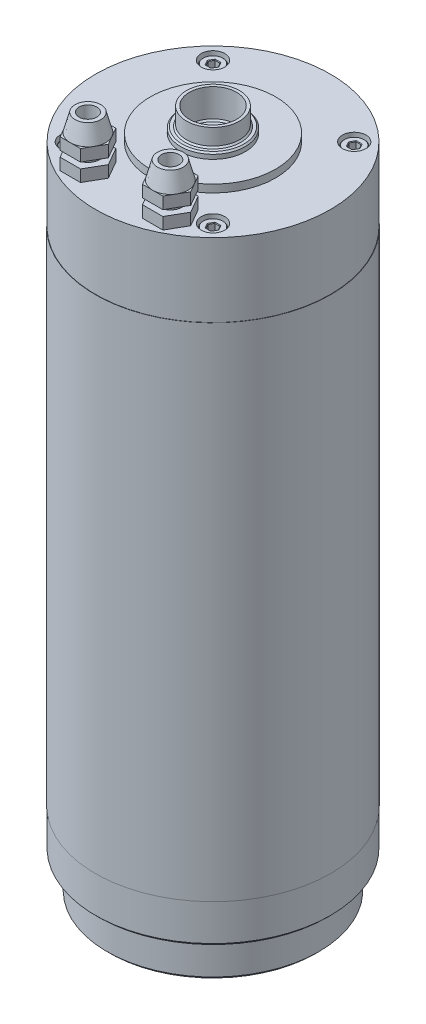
ISO-10303-21;
HEADER;
FILE_DESCRIPTION(('STEP AP214'),'2;1');
FILE_NAME('part.step','',(''),(''),'','','');
FILE_SCHEMA(('AUTOMOTIVE_DESIGN { 1 0 10303 214 1 1 1 1 }'));
ENDSEC;
DATA;
#1=APPLICATION_CONTEXT('core data for automotive mechanical design processes');
#2=APPLICATION_PROTOCOL_DEFINITION('international standard','automotive_design',2000,#1);
#3=PRODUCT_CONTEXT('',#1,'mechanical');
#4=PRODUCT('Part','Part','',(#3));
#5=PRODUCT_RELATED_PRODUCT_CATEGORY('part','',(#4));
#6=PRODUCT_DEFINITION_FORMATION('','',#4);
#7=PRODUCT_DEFINITION_CONTEXT('part definition',#1,'design');
#8=PRODUCT_DEFINITION('design','',#6,#7);
#9=PRODUCT_DEFINITION_SHAPE('','',#8);
#10=(LENGTH_UNIT() NAMED_UNIT(*) SI_UNIT(.MILLI.,.METRE.));
#11=(NAMED_UNIT(*) PLANE_ANGLE_UNIT() SI_UNIT($,.RADIAN.));
#12=(NAMED_UNIT(*) SI_UNIT($,.STERADIAN.) SOLID_ANGLE_UNIT());
#13=UNCERTAINTY_MEASURE_WITH_UNIT(LENGTH_MEASURE(1.E-05),#10,'distance_accuracy_value','');
#14=(GEOMETRIC_REPRESENTATION_CONTEXT(3) GLOBAL_UNCERTAINTY_ASSIGNED_CONTEXT((#13)) GLOBAL_UNIT_ASSIGNED_CONTEXT((#10,
#11,#12)) REPRESENTATION_CONTEXT('',''));
#15=CARTESIAN_POINT('',(0.,0.,0.));
#16=DIRECTION('',(0.,0.,1.));
#17=DIRECTION('',(1.,0.,0.));
#18=AXIS2_PLACEMENT_3D('',#15,#16,#17);
#19=CARTESIAN_POINT('',(0.,231.4,0.));
#20=DIRECTION('',(0.,1.,0.));
#21=DIRECTION('',(0.,0.,1.));
#22=AXIS2_PLACEMENT_3D('',#19,#20,#21);
#23=PLANE('',#22);
#24=CARTESIAN_POINT('',(-14.,231.4,28.5));
#25=DIRECTION('',(0.,1.,0.));
#26=DIRECTION('',(0.,0.,1.));
#27=AXIS2_PLACEMENT_3D('',#24,#25,#26);
#28=CIRCLE('',#27,6.);
#29=CARTESIAN_POINT('',(-14.,231.4,34.5));
#30=VERTEX_POINT('',#29);
#31=CARTESIAN_POINT('',(-8.80384757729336,231.4,31.5));
#32=VERTEX_POINT('',#31);
#33=EDGE_CURVE('E52',#30,#32,#28,.T.);
#34=ORIENTED_EDGE('',*,*,#33,.F.);
#35=DIRECTION('',(1.,0.,0.));
#36=VECTOR('',#35,1.);
#37=CARTESIAN_POINT('',(-17.4641016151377,231.4,34.5));
#38=LINE('',#37,#36);
#39=CARTESIAN_POINT('',(-10.5358983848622,231.4,34.5));
#40=VERTEX_POINT('',#39);
#41=EDGE_CURVE('E601',#30,#40,#38,.T.);
#42=ORIENTED_EDGE('',*,*,#41,.T.);
#43=DIRECTION('',(0.499999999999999,0.,-0.866025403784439));
#44=VECTOR('',#43,1.);
#45=CARTESIAN_POINT('',(-10.5358983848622,231.4,34.5));
#46=LINE('',#45,#44);
#47=EDGE_CURVE('E614',#40,#32,#46,.T.);
#48=ORIENTED_EDGE('',*,*,#47,.T.);
#49=EDGE_LOOP('',(#34,#42,#48));
#50=FACE_BOUND('',#49,.T.);
#51=ADVANCED_FACE('F40',(#50),#23,.T.);
#52=CARTESIAN_POINT('',(-8.80384757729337,231.4,25.5));
#53=VERTEX_POINT('',#52);
#54=EDGE_CURVE('E11',#32,#53,#28,.T.);
#55=ORIENTED_EDGE('',*,*,#54,.F.);
#56=CARTESIAN_POINT('',(-7.07179676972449,231.4,28.5));
#57=VERTEX_POINT('',#56);
#58=EDGE_CURVE('E600',#32,#57,#46,.T.);
#59=ORIENTED_EDGE('',*,*,#58,.T.);
#60=DIRECTION('',(-0.5,0.,-0.866025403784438));
#61=VECTOR('',#60,1.);
#62=CARTESIAN_POINT('',(-7.07179676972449,231.4,28.5));
#63=LINE('',#62,#61);
#64=EDGE_CURVE('E656',#57,#53,#63,.T.);
#65=ORIENTED_EDGE('',*,*,#64,.T.);
#66=EDGE_LOOP('',(#55,#59,#65));
#67=FACE_BOUND('',#66,.T.);
#68=ADVANCED_FACE('F1590',(#67),#23,.T.);
#69=CARTESIAN_POINT('',(-14.,231.4,22.5));
#70=VERTEX_POINT('',#69);
#71=EDGE_CURVE('E50',#53,#70,#28,.T.);
#72=ORIENTED_EDGE('',*,*,#71,.F.);
#73=CARTESIAN_POINT('',(-10.5358983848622,231.4,22.5));
#74=VERTEX_POINT('',#73);
#75=EDGE_CURVE('E655',#53,#74,#63,.T.);
#76=ORIENTED_EDGE('',*,*,#75,.T.);
#77=DIRECTION('',(-1.,0.,0.));
#78=VECTOR('',#77,1.);
#79=CARTESIAN_POINT('',(-10.5358983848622,231.4,22.5));
#80=LINE('',#79,#78);
#81=EDGE_CURVE('E661',#74,#70,#80,.T.);
#82=ORIENTED_EDGE('',*,*,#81,.T.);
#83=EDGE_LOOP('',(#72,#76,#82));
#84=FACE_BOUND('',#83,.T.);
#85=ADVANCED_FACE('F1594',(#84),#23,.T.);
#86=CARTESIAN_POINT('',(-19.1961524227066,231.4,25.5));
#87=VERTEX_POINT('',#86);
#88=EDGE_CURVE('E62',#70,#87,#28,.T.);
#89=ORIENTED_EDGE('',*,*,#88,.F.);
#90=CARTESIAN_POINT('',(-17.4641016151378,231.4,22.5));
#91=VERTEX_POINT('',#90);
#92=EDGE_CURVE('E660',#70,#91,#80,.T.);
#93=ORIENTED_EDGE('',*,*,#92,.T.);
#94=DIRECTION('',(-0.499999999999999,0.,0.866025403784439));
#95=VECTOR('',#94,1.);
#96=CARTESIAN_POINT('',(-17.4641016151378,231.4,22.5));
#97=LINE('',#96,#95);
#98=EDGE_CURVE('E646',#91,#87,#97,.T.);
#99=ORIENTED_EDGE('',*,*,#98,.T.);
#100=EDGE_LOOP('',(#89,#93,#99));
#101=FACE_BOUND('',#100,.T.);
#102=ADVANCED_FACE('F1583',(#101),#23,.T.);
#103=CARTESIAN_POINT('',(-19.1961524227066,231.4,31.5));
#104=VERTEX_POINT('',#103);
#105=EDGE_CURVE('E621',#87,#104,#28,.T.);
#106=ORIENTED_EDGE('',*,*,#105,.F.);
#107=CARTESIAN_POINT('',(-20.9282032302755,231.4,28.5));
#108=VERTEX_POINT('',#107);
#109=EDGE_CURVE('E649',#87,#108,#97,.T.);
#110=ORIENTED_EDGE('',*,*,#109,.T.);
#111=DIRECTION('',(0.5,0.,0.866025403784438));
#112=VECTOR('',#111,1.);
#113=CARTESIAN_POINT('',(-20.9282032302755,231.4,28.5));
#114=LINE('',#113,#112);
#115=EDGE_CURVE('E612',#108,#104,#114,.T.);
#116=ORIENTED_EDGE('',*,*,#115,.T.);
#117=EDGE_LOOP('',(#106,#110,#116));
#118=FACE_BOUND('',#117,.T.);
#119=ADVANCED_FACE('F1577',(#118),#23,.T.);
#120=CARTESIAN_POINT('',(0.,231.4,0.));
#121=DIRECTION('',(0.,1.,0.));
#122=DIRECTION('',(0.,0.,1.));
#123=AXIS2_PLACEMENT_3D('',#120,#121,#122);
#124=PLANE('',#123);
#125=CARTESIAN_POINT('',(14.,231.4,28.5));
#126=DIRECTION('',(0.,1.,0.));
#127=DIRECTION('',(0.,0.,1.));
#128=AXIS2_PLACEMENT_3D('',#125,#126,#127);
#129=CIRCLE('',#128,6.);
#130=CARTESIAN_POINT('',(14.,231.4,34.5));
#131=VERTEX_POINT('',#130);
#132=CARTESIAN_POINT('',(19.1961524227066,231.4,31.5));
#133=VERTEX_POINT('',#132);
#134=EDGE_CURVE('E630',#131,#133,#129,.T.);
#135=ORIENTED_EDGE('',*,*,#134,.F.);
#136=DIRECTION('',(1.,0.,0.));
#137=VECTOR('',#136,1.);
#138=CARTESIAN_POINT('',(10.5358983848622,231.4,34.5));
#139=LINE('',#138,#137);
#140=CARTESIAN_POINT('',(17.4641016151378,231.4,34.5));
#141=VERTEX_POINT('',#140);
#142=EDGE_CURVE('E714',#131,#141,#139,.T.);
#143=ORIENTED_EDGE('',*,*,#142,.T.);
#144=DIRECTION('',(0.499999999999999,0.,-0.866025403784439));
#145=VECTOR('',#144,1.);
#146=CARTESIAN_POINT('',(17.4641016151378,231.4,34.5));
#147=LINE('',#146,#145);
#148=EDGE_CURVE('E719',#141,#133,#147,.T.);
#149=ORIENTED_EDGE('',*,*,#148,.T.);
#150=EDGE_LOOP('',(#135,#143,#149));
#151=FACE_BOUND('',#150,.T.);
#152=ADVANCED_FACE('F1575',(#151),#124,.T.);
#153=CARTESIAN_POINT('',(19.1961524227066,231.4,25.5));
#154=VERTEX_POINT('',#153);
#155=EDGE_CURVE('E623',#133,#154,#129,.T.);
#156=ORIENTED_EDGE('',*,*,#155,.F.);
#157=CARTESIAN_POINT('',(20.9282032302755,231.4,28.5));
#158=VERTEX_POINT('',#157);
#159=EDGE_CURVE('E718',#133,#158,#147,.T.);
#160=ORIENTED_EDGE('',*,*,#159,.T.);
#161=DIRECTION('',(-0.5,0.,-0.866025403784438));
#162=VECTOR('',#161,1.);
#163=CARTESIAN_POINT('',(20.9282032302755,231.4,28.5));
#164=LINE('',#163,#162);
#165=EDGE_CURVE('E724',#158,#154,#164,.T.);
#166=ORIENTED_EDGE('',*,*,#165,.T.);
#167=EDGE_LOOP('',(#156,#160,#166));
#168=FACE_BOUND('',#167,.T.);
#169=ADVANCED_FACE('F1529',(#168),#124,.T.);
#170=CARTESIAN_POINT('',(14.,231.4,22.5));
#171=VERTEX_POINT('',#170);
#172=EDGE_CURVE('E628',#154,#171,#129,.T.);
#173=ORIENTED_EDGE('',*,*,#172,.F.);
#174=CARTESIAN_POINT('',(17.4641016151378,231.4,22.5));
#175=VERTEX_POINT('',#174);
#176=EDGE_CURVE('E723',#154,#175,#164,.T.);
#177=ORIENTED_EDGE('',*,*,#176,.T.);
#178=DIRECTION('',(-1.,0.,0.));
#179=VECTOR('',#178,1.);
#180=CARTESIAN_POINT('',(17.4641016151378,231.4,22.5));
#181=LINE('',#180,#179);
#182=EDGE_CURVE('E729',#175,#171,#181,.T.);
#183=ORIENTED_EDGE('',*,*,#182,.T.);
#184=EDGE_LOOP('',(#173,#177,#183));
#185=FACE_BOUND('',#184,.T.);
#186=ADVANCED_FACE('F1522',(#185),#124,.T.);
#187=CARTESIAN_POINT('',(8.80384757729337,231.4,25.5));
#188=VERTEX_POINT('',#187);
#189=EDGE_CURVE('E1511',#171,#188,#129,.T.);
#190=ORIENTED_EDGE('',*,*,#189,.F.);
#191=CARTESIAN_POINT('',(10.5358983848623,231.4,22.5));
#192=VERTEX_POINT('',#191);
#193=EDGE_CURVE('E728',#171,#192,#181,.T.);
#194=ORIENTED_EDGE('',*,*,#193,.T.);
#195=DIRECTION('',(-0.500000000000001,0.,0.866025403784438));
#196=VECTOR('',#195,1.);
#197=CARTESIAN_POINT('',(10.5358983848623,231.4,22.5));
#198=LINE('',#197,#196);
#199=EDGE_CURVE('E704',#192,#188,#198,.T.);
#200=ORIENTED_EDGE('',*,*,#199,.T.);
#201=EDGE_LOOP('',(#190,#194,#200));
#202=FACE_BOUND('',#201,.T.);
#203=ADVANCED_FACE('F1553',(#202),#124,.T.);
#204=CARTESIAN_POINT('',(8.80384757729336,231.4,31.5));
#205=VERTEX_POINT('',#204);
#206=EDGE_CURVE('E1507',#188,#205,#129,.T.);
#207=ORIENTED_EDGE('',*,*,#206,.F.);
#208=CARTESIAN_POINT('',(7.07179676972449,231.4,28.5));
#209=VERTEX_POINT('',#208);
#210=EDGE_CURVE('E709',#188,#209,#198,.T.);
#211=ORIENTED_EDGE('',*,*,#210,.T.);
#212=DIRECTION('',(0.5,0.,0.866025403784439));
#213=VECTOR('',#212,1.);
#214=CARTESIAN_POINT('',(7.07179676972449,231.4,28.5));
#215=LINE('',#214,#213);
#216=EDGE_CURVE('E710',#209,#205,#215,.T.);
#217=ORIENTED_EDGE('',*,*,#216,.T.);
#218=EDGE_LOOP('',(#207,#211,#217));
#219=FACE_BOUND('',#218,.T.);
#220=ADVANCED_FACE('F1559',(#219),#124,.T.);
#221=CARTESIAN_POINT('',(-21.3,221.4,0.));
#222=DIRECTION('',(0.,-1.,0.));
#223=DIRECTION('',(1.,0.,0.));
#224=AXIS2_PLACEMENT_3D('',#221,#222,#223);
#225=PLANE('',#224);
#226=DIRECTION('',(-1.,0.,0.));
#227=VECTOR('',#226,1.);
#228=CARTESIAN_POINT('',(17.4641016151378,221.4,22.5));
#229=LINE('',#228,#227);
#230=CARTESIAN_POINT('',(17.4641016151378,221.4,22.5));
#231=VERTEX_POINT('',#230);
#232=CARTESIAN_POINT('',(10.5358983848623,221.4,22.5));
#233=VERTEX_POINT('',#232);
#234=EDGE_CURVE('E858',#231,#233,#229,.T.);
#235=ORIENTED_EDGE('',*,*,#234,.F.);
#236=DIRECTION('',(-0.5,0.,-0.866025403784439));
#237=VECTOR('',#236,1.);
#238=CARTESIAN_POINT('',(20.9282032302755,221.4,28.5));
#239=LINE('',#238,#237);
#240=CARTESIAN_POINT('',(20.9282032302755,221.4,28.5));
#241=VERTEX_POINT('',#240);
#242=EDGE_CURVE('E864',#241,#231,#239,.T.);
#243=ORIENTED_EDGE('',*,*,#242,.F.);
#244=DIRECTION('',(0.5,0.,-0.866025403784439));
#245=VECTOR('',#244,1.);
#246=CARTESIAN_POINT('',(17.4641016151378,221.4,34.5));
#247=LINE('',#246,#245);
#248=CARTESIAN_POINT('',(17.4641016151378,221.4,34.5));
#249=VERTEX_POINT('',#248);
#250=EDGE_CURVE('E895',#249,#241,#247,.T.);
#251=ORIENTED_EDGE('',*,*,#250,.F.);
#252=DIRECTION('',(1.,0.,0.));
#253=VECTOR('',#252,1.);
#254=CARTESIAN_POINT('',(10.5358983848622,221.4,34.5));
#255=LINE('',#254,#253);
#256=CARTESIAN_POINT('',(10.5358983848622,221.4,34.5));
#257=VERTEX_POINT('',#256);
#258=EDGE_CURVE('E891',#257,#249,#255,.T.);
#259=ORIENTED_EDGE('',*,*,#258,.F.);
#260=DIRECTION('',(0.5,0.,0.866025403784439));
#261=VECTOR('',#260,1.);
#262=CARTESIAN_POINT('',(7.07179676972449,221.4,28.5));
#263=LINE('',#262,#261);
#264=CARTESIAN_POINT('',(7.07179676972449,221.4,28.5));
#265=VERTEX_POINT('',#264);
#266=EDGE_CURVE('E887',#265,#257,#263,.T.);
#267=ORIENTED_EDGE('',*,*,#266,.F.);
#268=DIRECTION('',(-0.5,0.,0.866025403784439));
#269=VECTOR('',#268,1.);
#270=CARTESIAN_POINT('',(10.5358983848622,221.4,22.5));
#271=LINE('',#270,#269);
#272=EDGE_CURVE('E883',#233,#265,#271,.T.);
#273=ORIENTED_EDGE('',*,*,#272,.F.);
#274=EDGE_LOOP('',(#235,#243,#251,#259,#267,#273));
#275=FACE_BOUND('',#274,.T.);
#276=CARTESIAN_POINT('',(24.,221.4,-24.));
#277=DIRECTION('',(0.,1.,0.));
#278=DIRECTION('',(-1.,0.,0.));
#279=AXIS2_PLACEMENT_3D('',#276,#277,#278);
#280=CIRCLE('',#279,4.);
#281=CARTESIAN_POINT('',(20.,221.4,-24.));
#282=VERTEX_POINT('',#281);
#283=EDGE_CURVE('E1119',#282,#282,#280,.T.);
#284=ORIENTED_EDGE('',*,*,#283,.F.);
#285=EDGE_LOOP('',(#284));
#286=FACE_BOUND('',#285,.T.);
#287=CARTESIAN_POINT('',(-24.,221.4,-24.));
#288=DIRECTION('',(0.,1.,0.));
#289=DIRECTION('',(-1.,0.,0.));
#290=AXIS2_PLACEMENT_3D('',#287,#288,#289);
#291=CIRCLE('',#290,4.);
#292=CARTESIAN_POINT('',(-28.,221.4,-24.));
#293=VERTEX_POINT('',#292);
#294=EDGE_CURVE('E1124',#293,#293,#291,.T.);
#295=ORIENTED_EDGE('',*,*,#294,.F.);
#296=EDGE_LOOP('',(#295));
#297=FACE_BOUND('',#296,.T.);
#298=CARTESIAN_POINT('',(-24.,221.4,24.));
#299=DIRECTION('',(0.,1.,0.));
#300=DIRECTION('',(-1.,0.,0.));
#301=AXIS2_PLACEMENT_3D('',#298,#299,#300);
#302=CIRCLE('',#301,4.);
#303=CARTESIAN_POINT('',(-28.,221.4,24.));
#304=VERTEX_POINT('',#303);
#305=EDGE_CURVE('E1132',#304,#304,#302,.T.);
#306=ORIENTED_EDGE('',*,*,#305,.F.);
#307=EDGE_LOOP('',(#306));
#308=FACE_BOUND('',#307,.T.);
#309=CARTESIAN_POINT('',(24.,221.4,24.));
#310=DIRECTION('',(0.,1.,0.));
#311=DIRECTION('',(-1.,0.,0.));
#312=AXIS2_PLACEMENT_3D('',#309,#310,#311);
#313=CIRCLE('',#312,4.);
#314=CARTESIAN_POINT('',(20.,221.4,24.));
#315=VERTEX_POINT('',#314);
#316=EDGE_CURVE('E1140',#315,#315,#313,.T.);
#317=ORIENTED_EDGE('',*,*,#316,.F.);
#318=EDGE_LOOP('',(#317));
#319=FACE_BOUND('',#318,.T.);
#320=CARTESIAN_POINT('',(0.,221.4,0.));
#321=DIRECTION('',(0.,-1.,0.));
#322=DIRECTION('',(1.,0.,0.));
#323=AXIS2_PLACEMENT_3D('',#320,#321,#322);
#324=CIRCLE('',#323,39.9);
#325=CARTESIAN_POINT('',(39.9,221.4,0.));
#326=VERTEX_POINT('',#325);
#327=EDGE_CURVE('E1171',#326,#326,#324,.T.);
#328=ORIENTED_EDGE('',*,*,#327,.F.);
#329=EDGE_LOOP('',(#328));
#330=FACE_BOUND('',#329,.T.);
#331=CARTESIAN_POINT('',(0.,221.4,0.));
#332=DIRECTION('',(0.,-1.,0.));
#333=DIRECTION('',(1.,0.,0.));
#334=AXIS2_PLACEMENT_3D('',#331,#332,#333);
#335=CIRCLE('',#334,21.3);
#336=CARTESIAN_POINT('',(21.3,221.4,0.));
#337=VERTEX_POINT('',#336);
#338=EDGE_CURVE('E1175',#337,#337,#335,.T.);
#339=ORIENTED_EDGE('',*,*,#338,.T.);
#340=EDGE_LOOP('',(#339));
#341=FACE_BOUND('',#340,.T.);
#342=DIRECTION('',(-0.499999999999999,0.,-0.866025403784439));
#343=VECTOR('',#342,1.);
#344=CARTESIAN_POINT('',(-7.07179676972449,221.4,28.5));
#345=LINE('',#344,#343);
#346=CARTESIAN_POINT('',(-7.07179676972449,221.4,28.5));
#347=VERTEX_POINT('',#346);
#348=CARTESIAN_POINT('',(-10.5358983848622,221.4,22.5));
#349=VERTEX_POINT('',#348);
#350=EDGE_CURVE('E788',#347,#349,#345,.T.);
#351=ORIENTED_EDGE('',*,*,#350,.F.);
#352=DIRECTION('',(0.500000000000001,0.,-0.866025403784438));
#353=VECTOR('',#352,1.);
#354=CARTESIAN_POINT('',(-10.5358983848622,221.4,34.5));
#355=LINE('',#354,#353);
#356=CARTESIAN_POINT('',(-10.5358983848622,221.4,34.5));
#357=VERTEX_POINT('',#356);
#358=EDGE_CURVE('E797',#357,#347,#355,.T.);
#359=ORIENTED_EDGE('',*,*,#358,.F.);
#360=DIRECTION('',(1.,0.,0.));
#361=VECTOR('',#360,1.);
#362=CARTESIAN_POINT('',(-17.4641016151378,221.4,34.5));
#363=LINE('',#362,#361);
#364=CARTESIAN_POINT('',(-17.4641016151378,221.4,34.5));
#365=VERTEX_POINT('',#364);
#366=EDGE_CURVE('E828',#365,#357,#363,.T.);
#367=ORIENTED_EDGE('',*,*,#366,.F.);
#368=DIRECTION('',(0.499999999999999,0.,0.866025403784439));
#369=VECTOR('',#368,1.);
#370=CARTESIAN_POINT('',(-20.9282032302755,221.4,28.5));
#371=LINE('',#370,#369);
#372=CARTESIAN_POINT('',(-20.9282032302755,221.4,28.5));
#373=VERTEX_POINT('',#372);
#374=EDGE_CURVE('E824',#373,#365,#371,.T.);
#375=ORIENTED_EDGE('',*,*,#374,.F.);
#376=DIRECTION('',(-0.5,0.,0.866025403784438));
#377=VECTOR('',#376,1.);
#378=CARTESIAN_POINT('',(-17.4641016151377,221.4,22.5));
#379=LINE('',#378,#377);
#380=CARTESIAN_POINT('',(-17.4641016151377,221.4,22.5));
#381=VERTEX_POINT('',#380);
#382=EDGE_CURVE('E820',#381,#373,#379,.T.);
#383=ORIENTED_EDGE('',*,*,#382,.F.);
#384=DIRECTION('',(-1.,0.,0.));
#385=VECTOR('',#384,1.);
#386=CARTESIAN_POINT('',(-10.5358983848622,221.4,22.5));
#387=LINE('',#386,#385);
#388=EDGE_CURVE('E816',#349,#381,#387,.T.);
#389=ORIENTED_EDGE('',*,*,#388,.F.);
#390=EDGE_LOOP('',(#351,#359,#367,#375,#383,#389));
#391=FACE_BOUND('',#390,.T.);
#392=ADVANCED_FACE('F1759',(#275,#286,#297,#308,#319,#330,#341,#391),#225,.F.);
#393=CARTESIAN_POINT('',(0.,232.,0.));
#394=DIRECTION('',(0.,-1.,0.));
#395=DIRECTION('',(1.,0.,0.));
#396=AXIS2_PLACEMENT_3D('',#393,#394,#395);
#397=CYLINDRICAL_SURFACE('',#396,11.);
#398=CARTESIAN_POINT('',(0.,225.5,0.));
#399=DIRECTION('',(0.,1.,0.));
#400=DIRECTION('',(-1.,0.,0.));
#401=AXIS2_PLACEMENT_3D('',#398,#399,#400);
#402=CIRCLE('',#401,11.);
#403=CARTESIAN_POINT('',(-11.,225.5,0.));
#404=VERTEX_POINT('',#403);
#405=EDGE_CURVE('E44',#404,#404,#402,.F.);
#406=ORIENTED_EDGE('',*,*,#405,.T.);
#407=EDGE_LOOP('',(#406));
#408=FACE_BOUND('',#407,.T.);
#409=CARTESIAN_POINT('',(0.,224.,0.));
#410=DIRECTION('',(0.,-1.,0.));
#411=DIRECTION('',(1.,0.,0.));
#412=AXIS2_PLACEMENT_3D('',#409,#410,#411);
#413=CIRCLE('',#412,11.);
#414=CARTESIAN_POINT('',(11.,224.,0.));
#415=VERTEX_POINT('',#414);
#416=EDGE_CURVE('E1457',#415,#415,#413,.F.);
#417=ORIENTED_EDGE('',*,*,#416,.T.);
#418=EDGE_LOOP('',(#417));
#419=FACE_BOUND('',#418,.T.);
#420=ADVANCED_FACE('F2121',(#408,#419),#397,.T.);
#421=CARTESIAN_POINT('',(24.,215.4,-24.));
#422=DIRECTION('',(0.,1.,0.));
#423=DIRECTION('',(-1.,0.,0.));
#424=AXIS2_PLACEMENT_3D('',#421,#422,#423);
#425=PLANE('',#424);
#426=CARTESIAN_POINT('',(24.,215.4,-24.));
#427=DIRECTION('',(0.,1.,0.));
#428=DIRECTION('',(-1.,0.,0.));
#429=AXIS2_PLACEMENT_3D('',#426,#427,#428);
#430=CIRCLE('',#429,4.);
#431=CARTESIAN_POINT('',(20.,215.4,-24.));
#432=VERTEX_POINT('',#431);
#433=EDGE_CURVE('E1120',#432,#432,#430,.T.);
#434=ORIENTED_EDGE('',*,*,#433,.T.);
#435=EDGE_LOOP('',(#434));
#436=FACE_BOUND('',#435,.T.);
#437=CARTESIAN_POINT('',(23.9999999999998,215.4,-24.));
#438=DIRECTION('',(0.,1.,0.));
#439=DIRECTION('',(-1.,0.,0.));
#440=AXIS2_PLACEMENT_3D('',#437,#438,#439);
#441=CIRCLE('',#440,3.5);
#442=CARTESIAN_POINT('',(20.4999999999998,215.4,-24.));
#443=VERTEX_POINT('',#442);
#444=EDGE_CURVE('E977',#443,#443,#441,.T.);
#445=ORIENTED_EDGE('',*,*,#444,.F.);
#446=EDGE_LOOP('',(#445));
#447=FACE_BOUND('',#446,.T.);
#448=ADVANCED_FACE('F2180',(#436,#447),#425,.T.);
#449=CARTESIAN_POINT('',(-24.,215.4,-24.));
#450=DIRECTION('',(0.,1.,0.));
#451=DIRECTION('',(-1.,0.,0.));
#452=AXIS2_PLACEMENT_3D('',#449,#450,#451);
#453=PLANE('',#452);
#454=CARTESIAN_POINT('',(-24.,215.4,-24.));
#455=DIRECTION('',(0.,1.,0.));
#456=DIRECTION('',(-1.,0.,0.));
#457=AXIS2_PLACEMENT_3D('',#454,#455,#456);
#458=CIRCLE('',#457,4.);
#459=CARTESIAN_POINT('',(-28.,215.4,-24.));
#460=VERTEX_POINT('',#459);
#461=EDGE_CURVE('E1128',#460,#460,#458,.T.);
#462=ORIENTED_EDGE('',*,*,#461,.T.);
#463=EDGE_LOOP('',(#462));
#464=FACE_BOUND('',#463,.T.);
#465=CARTESIAN_POINT('',(-24.0000000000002,215.4,-23.9999999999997));
#466=DIRECTION('',(0.,1.,0.));
#467=DIRECTION('',(-1.,0.,0.));
#468=AXIS2_PLACEMENT_3D('',#465,#466,#467);
#469=CIRCLE('',#468,3.5);
#470=CARTESIAN_POINT('',(-27.5000000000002,215.4,-23.9999999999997));
#471=VERTEX_POINT('',#470);
#472=EDGE_CURVE('E1023',#471,#471,#469,.T.);
#473=ORIENTED_EDGE('',*,*,#472,.F.);
#474=EDGE_LOOP('',(#473));
#475=FACE_BOUND('',#474,.T.);
#476=ADVANCED_FACE('F2254',(#464,#475),#453,.T.);
#477=CARTESIAN_POINT('',(-24.,215.4,24.));
#478=DIRECTION('',(0.,1.,0.));
#479=DIRECTION('',(-1.,0.,0.));
#480=AXIS2_PLACEMENT_3D('',#477,#478,#479);
#481=PLANE('',#480);
#482=CARTESIAN_POINT('',(-24.,215.4,24.));
#483=DIRECTION('',(0.,1.,0.));
#484=DIRECTION('',(-1.,0.,0.));
#485=AXIS2_PLACEMENT_3D('',#482,#483,#484);
#486=CIRCLE('',#485,4.);
#487=CARTESIAN_POINT('',(-28.,215.4,24.));
#488=VERTEX_POINT('',#487);
#489=EDGE_CURVE('E1136',#488,#488,#486,.T.);
#490=ORIENTED_EDGE('',*,*,#489,.T.);
#491=EDGE_LOOP('',(#490));
#492=FACE_BOUND('',#491,.T.);
#493=CARTESIAN_POINT('',(-24.,215.4,24.0000000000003));
#494=DIRECTION('',(0.,1.,0.));
#495=DIRECTION('',(-1.,0.,0.));
#496=AXIS2_PLACEMENT_3D('',#493,#494,#495);
#497=CIRCLE('',#496,3.5);
#498=CARTESIAN_POINT('',(-27.5,215.4,24.0000000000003));
#499=VERTEX_POINT('',#498);
#500=EDGE_CURVE('E1069',#499,#499,#497,.T.);
#501=ORIENTED_EDGE('',*,*,#500,.F.);
#502=EDGE_LOOP('',(#501));
#503=FACE_BOUND('',#502,.T.);
#504=ADVANCED_FACE('F2269',(#492,#503),#481,.T.);
#505=CARTESIAN_POINT('',(24.,215.4,24.));
#506=DIRECTION('',(0.,1.,0.));
#507=DIRECTION('',(-1.,0.,0.));
#508=AXIS2_PLACEMENT_3D('',#505,#506,#507);
#509=PLANE('',#508);
#510=CARTESIAN_POINT('',(24.,215.4,24.));
#511=DIRECTION('',(0.,1.,0.));
#512=DIRECTION('',(-1.,0.,0.));
#513=AXIS2_PLACEMENT_3D('',#510,#511,#512);
#514=CIRCLE('',#513,4.);
#515=CARTESIAN_POINT('',(20.,215.4,24.));
#516=VERTEX_POINT('',#515);
#517=EDGE_CURVE('E1144',#516,#516,#514,.T.);
#518=ORIENTED_EDGE('',*,*,#517,.T.);
#519=EDGE_LOOP('',(#518));
#520=FACE_BOUND('',#519,.T.);
#521=CARTESIAN_POINT('',(24.,215.4,24.));
#522=DIRECTION('',(0.,1.,0.));
#523=DIRECTION('',(-1.,0.,0.));
#524=AXIS2_PLACEMENT_3D('',#521,#522,#523);
#525=CIRCLE('',#524,3.5);
#526=CARTESIAN_POINT('',(20.5,215.4,24.));
#527=VERTEX_POINT('',#526);
#528=EDGE_CURVE('E1115',#527,#527,#525,.T.);
#529=ORIENTED_EDGE('',*,*,#528,.F.);
#530=EDGE_LOOP('',(#529));
#531=FACE_BOUND('',#530,.T.);
#532=ADVANCED_FACE('F2280',(#520,#531),#509,.T.);
#533=CARTESIAN_POINT('',(0.,13.6,0.));
#534=DIRECTION('',(0.,1.,0.));
#535=DIRECTION('',(-1.,0.,0.));
#536=AXIS2_PLACEMENT_3D('',#533,#534,#535);
#537=CONICAL_SURFACE('',#536,39.9,0.785398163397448);
#538=CARTESIAN_POINT('',(0.,12.6,0.));
#539=DIRECTION('',(0.,-1.,0.));
#540=DIRECTION('',(1.,0.,0.));
#541=AXIS2_PLACEMENT_3D('',#538,#539,#540);
#542=CIRCLE('',#541,38.9);
#543=CARTESIAN_POINT('',(38.9,12.6,0.));
#544=VERTEX_POINT('',#543);
#545=EDGE_CURVE('E1203',#544,#544,#542,.T.);
#546=ORIENTED_EDGE('',*,*,#545,.F.);
#547=EDGE_LOOP('',(#546));
#548=FACE_BOUND('',#547,.T.);
#549=CARTESIAN_POINT('',(0.,13.6,0.));
#550=DIRECTION('',(0.,-1.,0.));
#551=DIRECTION('',(1.,0.,0.));
#552=AXIS2_PLACEMENT_3D('',#549,#550,#551);
#553=CIRCLE('',#552,39.9);
#554=CARTESIAN_POINT('',(39.9,13.6,0.));
#555=VERTEX_POINT('',#554);
#556=EDGE_CURVE('E1148',#555,#555,#553,.T.);
#557=ORIENTED_EDGE('',*,*,#556,.T.);
#558=EDGE_LOOP('',(#557));
#559=FACE_BOUND('',#558,.T.);
#560=ADVANCED_FACE('F2305',(#548,#559),#537,.T.);
#561=CARTESIAN_POINT('',(-38.9,12.6,0.));
#562=DIRECTION('',(0.,1.,0.));
#563=DIRECTION('',(-1.,0.,0.));
#564=AXIS2_PLACEMENT_3D('',#561,#562,#563);
#565=PLANE('',#564);
#566=CARTESIAN_POINT('',(0.,12.6,0.));
#567=DIRECTION('',(0.,-1.,0.));
#568=DIRECTION('',(1.,0.,0.));
#569=AXIS2_PLACEMENT_3D('',#566,#567,#568);
#570=CIRCLE('',#569,36.);
#571=CARTESIAN_POINT('',(36.,12.6,0.));
#572=VERTEX_POINT('',#571);
#573=EDGE_CURVE('E1199',#572,#572,#570,.T.);
#574=ORIENTED_EDGE('',*,*,#573,.F.);
#575=EDGE_LOOP('',(#574));
#576=FACE_BOUND('',#575,.T.);
#577=ORIENTED_EDGE('',*,*,#545,.T.);
#578=EDGE_LOOP('',(#577));
#579=FACE_BOUND('',#578,.T.);
#580=ADVANCED_FACE('F2396',(#576,#579),#565,.F.);
#581=CARTESIAN_POINT('',(0.,30.,0.));
#582=DIRECTION('',(0.,-1.,0.));
#583=DIRECTION('',(1.,0.,0.));
#584=AXIS2_PLACEMENT_3D('',#581,#582,#583);
#585=CYLINDRICAL_SURFACE('',#584,36.);
#586=CARTESIAN_POINT('',(0.,0.999999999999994,0.));
#587=DIRECTION('',(0.,-1.,0.));
#588=DIRECTION('',(1.,0.,0.));
#589=AXIS2_PLACEMENT_3D('',#586,#587,#588);
#590=CIRCLE('',#589,36.);
#591=CARTESIAN_POINT('',(36.,0.999999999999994,0.));
#592=VERTEX_POINT('',#591);
#593=EDGE_CURVE('E1195',#592,#592,#590,.T.);
#594=ORIENTED_EDGE('',*,*,#593,.F.);
#595=EDGE_LOOP('',(#594));
#596=FACE_BOUND('',#595,.T.);
#597=ORIENTED_EDGE('',*,*,#573,.T.);
#598=EDGE_LOOP('',(#597));
#599=FACE_BOUND('',#598,.T.);
#600=ADVANCED_FACE('F2390',(#596,#599),#585,.T.);
#601=CARTESIAN_POINT('',(0.,0.999999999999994,0.));
#602=DIRECTION('',(0.,1.,0.));
#603=DIRECTION('',(-1.,0.,0.));
#604=AXIS2_PLACEMENT_3D('',#601,#602,#603);
#605=CONICAL_SURFACE('',#604,36.,0.78539816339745);
#606=CARTESIAN_POINT('',(0.,0.,0.));
#607=DIRECTION('',(0.,-1.,0.));
#608=DIRECTION('',(1.,0.,0.));
#609=AXIS2_PLACEMENT_3D('',#606,#607,#608);
#610=CIRCLE('',#609,35.);
#611=CARTESIAN_POINT('',(35.,0.,0.));
#612=VERTEX_POINT('',#611);
#613=EDGE_CURVE('E1191',#612,#612,#610,.T.);
#614=ORIENTED_EDGE('',*,*,#613,.F.);
#615=EDGE_LOOP('',(#614));
#616=FACE_BOUND('',#615,.T.);
#617=ORIENTED_EDGE('',*,*,#593,.T.);
#618=EDGE_LOOP('',(#617));
#619=FACE_BOUND('',#618,.T.);
#620=ADVANCED_FACE('F2395',(#616,#619),#605,.T.);
#621=CARTESIAN_POINT('',(-15.,0.,0.));
#622=DIRECTION('',(0.,1.,0.));
#623=DIRECTION('',(-1.,0.,0.));
#624=AXIS2_PLACEMENT_3D('',#621,#622,#623);
#625=PLANE('',#624);
#626=CARTESIAN_POINT('',(0.,0.,0.));
#627=DIRECTION('',(0.,-1.,0.));
#628=DIRECTION('',(1.,0.,0.));
#629=AXIS2_PLACEMENT_3D('',#626,#627,#628);
#630=CIRCLE('',#629,15.);
#631=CARTESIAN_POINT('',(15.,0.,0.));
#632=VERTEX_POINT('',#631);
#633=EDGE_CURVE('E1187',#632,#632,#630,.T.);
#634=ORIENTED_EDGE('',*,*,#633,.F.);
#635=EDGE_LOOP('',(#634));
#636=FACE_BOUND('',#635,.T.);
#637=ORIENTED_EDGE('',*,*,#613,.T.);
#638=EDGE_LOOP('',(#637));
#639=FACE_BOUND('',#638,.T.);
#640=ADVANCED_FACE('F2421',(#636,#639),#625,.F.);
#641=CARTESIAN_POINT('',(0.,30.,0.));
#642=DIRECTION('',(0.,-1.,0.));
#643=DIRECTION('',(1.,0.,0.));
#644=AXIS2_PLACEMENT_3D('',#641,#642,#643);
#645=CYLINDRICAL_SURFACE('',#644,15.);
#646=CARTESIAN_POINT('',(0.,30.,0.));
#647=DIRECTION('',(0.,-1.,0.));
#648=DIRECTION('',(1.,0.,0.));
#649=AXIS2_PLACEMENT_3D('',#646,#647,#648);
#650=CIRCLE('',#649,15.);
#651=CARTESIAN_POINT('',(15.,30.,0.));
#652=VERTEX_POINT('',#651);
#653=EDGE_CURVE('E1183',#652,#652,#650,.T.);
#654=ORIENTED_EDGE('',*,*,#653,.F.);
#655=EDGE_LOOP('',(#654));
#656=FACE_BOUND('',#655,.T.);
#657=ORIENTED_EDGE('',*,*,#633,.T.);
#658=EDGE_LOOP('',(#657));
#659=FACE_BOUND('',#658,.T.);
#660=ADVANCED_FACE('F2426',(#656,#659),#645,.F.);
#661=CARTESIAN_POINT('',(-15.,30.,0.));
#662=DIRECTION('',(0.,1.,0.));
#663=DIRECTION('',(-1.,0.,0.));
#664=AXIS2_PLACEMENT_3D('',#661,#662,#663);
#665=PLANE('',#664);
#666=ORIENTED_EDGE('',*,*,#653,.T.);
#667=EDGE_LOOP('',(#666));
#668=FACE_BOUND('',#667,.T.);
#669=ADVANCED_FACE('F2221',(#668),#665,.F.);
#670=CARTESIAN_POINT('',(0.,224.,0.));
#671=DIRECTION('',(0.,-1.,0.));
#672=DIRECTION('',(1.,0.,0.));
#673=AXIS2_PLACEMENT_3D('',#670,#671,#672);
#674=PLANE('',#673);
#675=ORIENTED_EDGE('',*,*,#416,.F.);
#676=EDGE_LOOP('',(#675));
#677=FACE_BOUND('',#676,.T.);
#678=CARTESIAN_POINT('',(0.,224.,0.));
#679=DIRECTION('',(0.,-1.,0.));
#680=DIRECTION('',(1.,0.,0.));
#681=AXIS2_PLACEMENT_3D('',#678,#679,#680);
#682=CIRCLE('',#681,21.3);
#683=CARTESIAN_POINT('',(21.3,224.,0.));
#684=VERTEX_POINT('',#683);
#685=EDGE_CURVE('E1179',#684,#684,#682,.T.);
#686=ORIENTED_EDGE('',*,*,#685,.F.);
#687=EDGE_LOOP('',(#686));
#688=FACE_BOUND('',#687,.T.);
#689=ADVANCED_FACE('F2216',(#677,#688),#674,.F.);
#690=CARTESIAN_POINT('',(0.,30.,0.));
#691=DIRECTION('',(0.,-1.,0.));
#692=DIRECTION('',(1.,0.,0.));
#693=AXIS2_PLACEMENT_3D('',#690,#691,#692);
#694=CYLINDRICAL_SURFACE('',#693,21.3);
#695=ORIENTED_EDGE('',*,*,#338,.F.);
#696=EDGE_LOOP('',(#695));
#697=FACE_BOUND('',#696,.T.);
#698=ORIENTED_EDGE('',*,*,#685,.T.);
#699=EDGE_LOOP('',(#698));
#700=FACE_BOUND('',#699,.T.);
#701=ADVANCED_FACE('F2220',(#697,#700),#694,.T.);
#702=CARTESIAN_POINT('',(0.,30.,0.));
#703=DIRECTION('',(0.,-1.,0.));
#704=DIRECTION('',(1.,0.,0.));
#705=AXIS2_PLACEMENT_3D('',#702,#703,#704);
#706=CYLINDRICAL_SURFACE('',#705,39.9);
#707=CARTESIAN_POINT('',(0.,196.4,0.));
#708=DIRECTION('',(0.,-1.,0.));
#709=DIRECTION('',(1.,0.,0.));
#710=AXIS2_PLACEMENT_3D('',#707,#708,#709);
#711=CIRCLE('',#710,39.9);
#712=CARTESIAN_POINT('',(39.9,196.4,0.));
#713=VERTEX_POINT('',#712);
#714=EDGE_CURVE('E1167',#713,#713,#711,.T.);
#715=ORIENTED_EDGE('',*,*,#714,.F.);
#716=EDGE_LOOP('',(#715));
#717=FACE_BOUND('',#716,.T.);
#718=ORIENTED_EDGE('',*,*,#327,.T.);
#719=EDGE_LOOP('',(#718));
#720=FACE_BOUND('',#719,.T.);
#721=ADVANCED_FACE('F2439',(#717,#720),#706,.T.);
#722=CARTESIAN_POINT('',(-40.,196.4,0.));
#723=DIRECTION('',(0.,-1.,0.));
#724=DIRECTION('',(1.,0.,0.));
#725=AXIS2_PLACEMENT_3D('',#722,#723,#724);
#726=PLANE('',#725);
#727=CARTESIAN_POINT('',(0.,196.4,0.));
#728=DIRECTION('',(0.,-1.,0.));
#729=DIRECTION('',(1.,0.,0.));
#730=AXIS2_PLACEMENT_3D('',#727,#728,#729);
#731=CIRCLE('',#730,40.);
#732=CARTESIAN_POINT('',(40.,196.4,0.));
#733=VERTEX_POINT('',#732);
#734=EDGE_CURVE('E1163',#733,#733,#731,.T.);
#735=ORIENTED_EDGE('',*,*,#734,.F.);
#736=EDGE_LOOP('',(#735));
#737=FACE_BOUND('',#736,.T.);
#738=ORIENTED_EDGE('',*,*,#714,.T.);
#739=EDGE_LOOP('',(#738));
#740=FACE_BOUND('',#739,.T.);
#741=ADVANCED_FACE('F2374',(#737,#740),#726,.F.);
#742=CARTESIAN_POINT('',(0.,30.,0.));
#743=DIRECTION('',(0.,-1.,0.));
#744=DIRECTION('',(1.,0.,0.));
#745=AXIS2_PLACEMENT_3D('',#742,#743,#744);
#746=CYLINDRICAL_SURFACE('',#745,40.);
#747=CARTESIAN_POINT('',(0.,26.,0.));
#748=DIRECTION('',(0.,-1.,0.));
#749=DIRECTION('',(1.,0.,0.));
#750=AXIS2_PLACEMENT_3D('',#747,#748,#749);
#751=CIRCLE('',#750,40.);
#752=CARTESIAN_POINT('',(40.,26.,0.));
#753=VERTEX_POINT('',#752);
#754=EDGE_CURVE('E1159',#753,#753,#751,.T.);
#755=ORIENTED_EDGE('',*,*,#754,.F.);
#756=EDGE_LOOP('',(#755));
#757=FACE_BOUND('',#756,.T.);
#758=ORIENTED_EDGE('',*,*,#734,.T.);
#759=EDGE_LOOP('',(#758));
#760=FACE_BOUND('',#759,.T.);
#761=ADVANCED_FACE('F2367',(#757,#760),#746,.T.);
#762=CARTESIAN_POINT('',(-40.,26.,0.));
#763=DIRECTION('',(0.,1.,0.));
#764=DIRECTION('',(-1.,0.,0.));
#765=AXIS2_PLACEMENT_3D('',#762,#763,#764);
#766=PLANE('',#765);
#767=CARTESIAN_POINT('',(0.,26.,0.));
#768=DIRECTION('',(0.,-1.,0.));
#769=DIRECTION('',(1.,0.,0.));
#770=AXIS2_PLACEMENT_3D('',#767,#768,#769);
#771=CIRCLE('',#770,39.9);
#772=CARTESIAN_POINT('',(39.9,26.,0.));
#773=VERTEX_POINT('',#772);
#774=EDGE_CURVE('E1155',#773,#773,#771,.T.);
#775=ORIENTED_EDGE('',*,*,#774,.F.);
#776=EDGE_LOOP('',(#775));
#777=FACE_BOUND('',#776,.T.);
#778=ORIENTED_EDGE('',*,*,#754,.T.);
#779=EDGE_LOOP('',(#778));
#780=FACE_BOUND('',#779,.T.);
#781=ADVANCED_FACE('F2373',(#777,#780),#766,.F.);
#782=CARTESIAN_POINT('',(0.,30.,0.));
#783=DIRECTION('',(0.,-1.,0.));
#784=DIRECTION('',(1.,0.,0.));
#785=AXIS2_PLACEMENT_3D('',#782,#783,#784);
#786=CYLINDRICAL_SURFACE('',#785,39.9);
#787=ORIENTED_EDGE('',*,*,#556,.F.);
#788=EDGE_LOOP('',(#787));
#789=FACE_BOUND('',#788,.T.);
#790=ORIENTED_EDGE('',*,*,#774,.T.);
#791=EDGE_LOOP('',(#790));
#792=FACE_BOUND('',#791,.T.);
#793=ADVANCED_FACE('F2351',(#789,#792),#786,.T.);
#794=CARTESIAN_POINT('',(24.,215.4,24.));
#795=DIRECTION('',(0.,1.,0.));
#796=DIRECTION('',(-1.,0.,0.));
#797=AXIS2_PLACEMENT_3D('',#794,#795,#796);
#798=CYLINDRICAL_SURFACE('',#797,4.);
#799=ORIENTED_EDGE('',*,*,#517,.F.);
#800=EDGE_LOOP('',(#799));
#801=FACE_BOUND('',#800,.T.);
#802=ORIENTED_EDGE('',*,*,#316,.T.);
#803=EDGE_LOOP('',(#802));
#804=FACE_BOUND('',#803,.T.);
#805=ADVANCED_FACE('F2330',(#801,#804),#798,.F.);
#806=CARTESIAN_POINT('',(-24.,215.4,24.));
#807=DIRECTION('',(0.,1.,0.));
#808=DIRECTION('',(-1.,0.,0.));
#809=AXIS2_PLACEMENT_3D('',#806,#807,#808);
#810=CYLINDRICAL_SURFACE('',#809,4.);
#811=ORIENTED_EDGE('',*,*,#489,.F.);
#812=EDGE_LOOP('',(#811));
#813=FACE_BOUND('',#812,.T.);
#814=ORIENTED_EDGE('',*,*,#305,.T.);
#815=EDGE_LOOP('',(#814));
#816=FACE_BOUND('',#815,.T.);
#817=ADVANCED_FACE('F2319',(#813,#816),#810,.F.);
#818=CARTESIAN_POINT('',(-24.,215.4,-24.));
#819=DIRECTION('',(0.,1.,0.));
#820=DIRECTION('',(-1.,0.,0.));
#821=AXIS2_PLACEMENT_3D('',#818,#819,#820);
#822=CYLINDRICAL_SURFACE('',#821,4.);
#823=ORIENTED_EDGE('',*,*,#461,.F.);
#824=EDGE_LOOP('',(#823));
#825=FACE_BOUND('',#824,.T.);
#826=ORIENTED_EDGE('',*,*,#294,.T.);
#827=EDGE_LOOP('',(#826));
#828=FACE_BOUND('',#827,.T.);
#829=ADVANCED_FACE('F2313',(#825,#828),#822,.F.);
#830=CARTESIAN_POINT('',(24.,215.4,-24.));
#831=DIRECTION('',(0.,1.,0.));
#832=DIRECTION('',(-1.,0.,0.));
#833=AXIS2_PLACEMENT_3D('',#830,#831,#832);
#834=CYLINDRICAL_SURFACE('',#833,4.);
#835=ORIENTED_EDGE('',*,*,#433,.F.);
#836=EDGE_LOOP('',(#835));
#837=FACE_BOUND('',#836,.T.);
#838=ORIENTED_EDGE('',*,*,#283,.T.);
#839=EDGE_LOOP('',(#838));
#840=FACE_BOUND('',#839,.T.);
#841=ADVANCED_FACE('F2318',(#837,#840),#834,.F.);
#842=CARTESIAN_POINT('',(24.,220.4,24.));
#843=DIRECTION('',(0.,1.,0.));
#844=DIRECTION('',(-1.,0.,0.));
#845=AXIS2_PLACEMENT_3D('',#842,#843,#844);
#846=PLANE('',#845);
#847=DIRECTION('',(-0.500000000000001,0.,0.866025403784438));
#848=VECTOR('',#847,1.);
#849=CARTESIAN_POINT('',(25.4722431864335,220.4,24.85));
#850=LINE('',#849,#848);
#851=CARTESIAN_POINT('',(25.9629909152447,220.4,24.));
#852=VERTEX_POINT('',#851);
#853=CARTESIAN_POINT('',(24.9814954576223,220.4,25.7));
#854=VERTEX_POINT('',#853);
#855=EDGE_CURVE('E1227',#852,#854,#850,.T.);
#856=ORIENTED_EDGE('',*,*,#855,.T.);
#857=DIRECTION('',(-1.,0.,0.));
#858=VECTOR('',#857,1.);
#859=CARTESIAN_POINT('',(24.,220.4,25.7));
#860=LINE('',#859,#858);
#861=CARTESIAN_POINT('',(23.0185045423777,220.4,25.7));
#862=VERTEX_POINT('',#861);
#863=EDGE_CURVE('E1230',#854,#862,#860,.T.);
#864=ORIENTED_EDGE('',*,*,#863,.T.);
#865=DIRECTION('',(-0.5,0.,-0.866025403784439));
#866=VECTOR('',#865,1.);
#867=CARTESIAN_POINT('',(22.5277568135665,220.4,24.85));
#868=LINE('',#867,#866);
#869=CARTESIAN_POINT('',(22.0370090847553,220.4,24.));
#870=VERTEX_POINT('',#869);
#871=EDGE_CURVE('E1215',#862,#870,#868,.T.);
#872=ORIENTED_EDGE('',*,*,#871,.T.);
#873=DIRECTION('',(0.5,0.,-0.866025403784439));
#874=VECTOR('',#873,1.);
#875=CARTESIAN_POINT('',(22.5277568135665,220.4,23.15));
#876=LINE('',#875,#874);
#877=CARTESIAN_POINT('',(23.0185045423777,220.4,22.3));
#878=VERTEX_POINT('',#877);
#879=EDGE_CURVE('E1218',#870,#878,#876,.T.);
#880=ORIENTED_EDGE('',*,*,#879,.T.);
#881=DIRECTION('',(1.,0.,0.));
#882=VECTOR('',#881,1.);
#883=CARTESIAN_POINT('',(24.,220.4,22.3));
#884=LINE('',#883,#882);
#885=CARTESIAN_POINT('',(24.9814954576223,220.4,22.3));
#886=VERTEX_POINT('',#885);
#887=EDGE_CURVE('E1221',#878,#886,#884,.T.);
#888=ORIENTED_EDGE('',*,*,#887,.T.);
#889=DIRECTION('',(0.500000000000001,0.,0.866025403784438));
#890=VECTOR('',#889,1.);
#891=CARTESIAN_POINT('',(25.4722431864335,220.4,23.15));
#892=LINE('',#891,#890);
#893=EDGE_CURVE('E1224',#886,#852,#892,.T.);
#894=ORIENTED_EDGE('',*,*,#893,.T.);
#895=EDGE_LOOP('',(#856,#864,#872,#880,#888,#894));
#896=FACE_BOUND('',#895,.T.);
#897=CARTESIAN_POINT('',(24.,220.4,24.));
#898=DIRECTION('',(0.,1.,0.));
#899=DIRECTION('',(-1.,0.,0.));
#900=AXIS2_PLACEMENT_3D('',#897,#898,#899);
#901=CIRCLE('',#900,3.3);
#902=CARTESIAN_POINT('',(24.,220.4,20.7));
#903=VERTEX_POINT('',#902);
#904=EDGE_CURVE('E1211',#903,#903,#901,.T.);
#905=ORIENTED_EDGE('',*,*,#904,.T.);
#906=EDGE_LOOP('',(#905));
#907=FACE_BOUND('',#906,.T.);
#908=ADVANCED_FACE('F2361',(#896,#907),#846,.T.);
#909=CARTESIAN_POINT('',(24.,220.4,24.));
#910=DIRECTION('',(0.,-1.,0.));
#911=DIRECTION('',(1.,0.,0.));
#912=AXIS2_PLACEMENT_3D('',#909,#910,#911);
#913=CYLINDRICAL_SURFACE('',#912,3.5);
#914=CARTESIAN_POINT('',(24.,220.2,24.));
#915=DIRECTION('',(0.,1.,0.));
#916=DIRECTION('',(0.,0.,1.));
#917=AXIS2_PLACEMENT_3D('',#914,#915,#916);
#918=CIRCLE('',#917,3.5);
#919=CARTESIAN_POINT('',(24.,220.2,20.5));
#920=VERTEX_POINT('',#919);
#921=EDGE_CURVE('E1249',#920,#920,#918,.F.);
#922=ORIENTED_EDGE('',*,*,#921,.T.);
#923=EDGE_LOOP('',(#922));
#924=FACE_BOUND('',#923,.T.);
#925=ORIENTED_EDGE('',*,*,#528,.T.);
#926=EDGE_LOOP('',(#925));
#927=FACE_BOUND('',#926,.T.);
#928=ADVANCED_FACE('F2719',(#924,#927),#913,.T.);
#929=CARTESIAN_POINT('',(23.1339745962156,220.4,22.5));
#930=DIRECTION('',(0.866025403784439,0.,0.5));
#931=DIRECTION('',(0.5,0.,-0.866025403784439));
#932=AXIS2_PLACEMENT_3D('',#929,#930,#931);
#933=PLANE('',#932);
#934=DIRECTION('',(0.,-1.,0.));
#935=VECTOR('',#934,1.);
#936=CARTESIAN_POINT('',(23.1339745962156,220.4,22.5));
#937=LINE('',#936,#935);
#938=CARTESIAN_POINT('',(23.1339745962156,220.2,22.5));
#939=VERTEX_POINT('',#938);
#940=CARTESIAN_POINT('',(23.1339745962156,215.4,22.5));
#941=VERTEX_POINT('',#940);
#942=EDGE_CURVE('E1097',#939,#941,#937,.T.);
#943=ORIENTED_EDGE('',*,*,#942,.F.);
#944=DIRECTION('',(-0.5,0.,0.866025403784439));
#945=VECTOR('',#944,1.);
#946=CARTESIAN_POINT('',(23.1339745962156,220.2,22.5));
#947=LINE('',#946,#945);
#948=CARTESIAN_POINT('',(22.2679491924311,220.2,24.));
#949=VERTEX_POINT('',#948);
#950=EDGE_CURVE('E1243',#939,#949,#947,.T.);
#951=ORIENTED_EDGE('',*,*,#950,.T.);
#952=DIRECTION('',(0.,-1.,0.));
#953=VECTOR('',#952,1.);
#954=CARTESIAN_POINT('',(22.2679491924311,220.4,24.));
#955=LINE('',#954,#953);
#956=CARTESIAN_POINT('',(22.2679491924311,215.4,24.));
#957=VERTEX_POINT('',#956);
#958=EDGE_CURVE('E1112',#949,#957,#955,.T.);
#959=ORIENTED_EDGE('',*,*,#958,.T.);
#960=DIRECTION('',(-0.5,0.,0.866025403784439));
#961=VECTOR('',#960,1.);
#962=CARTESIAN_POINT('',(23.1339745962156,215.4,22.5));
#963=LINE('',#962,#961);
#964=EDGE_CURVE('E1073',#941,#957,#963,.T.);
#965=ORIENTED_EDGE('',*,*,#964,.F.);
#966=EDGE_LOOP('',(#943,#951,#959,#965));
#967=FACE_BOUND('',#966,.T.);
#968=ADVANCED_FACE('F2715',(#967),#933,.T.);
#969=CARTESIAN_POINT('',(22.2679491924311,220.4,24.));
#970=DIRECTION('',(0.866025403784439,0.,-0.5));
#971=DIRECTION('',(-0.5,0.,-0.866025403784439));
#972=AXIS2_PLACEMENT_3D('',#969,#970,#971);
#973=PLANE('',#972);
#974=ORIENTED_EDGE('',*,*,#958,.F.);
#975=DIRECTION('',(0.5,0.,0.866025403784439));
#976=VECTOR('',#975,1.);
#977=CARTESIAN_POINT('',(22.2679491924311,220.2,24.));
#978=LINE('',#977,#976);
#979=CARTESIAN_POINT('',(23.1339745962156,220.2,25.5));
#980=VERTEX_POINT('',#979);
#981=EDGE_CURVE('E1246',#949,#980,#978,.T.);
#982=ORIENTED_EDGE('',*,*,#981,.T.);
#983=DIRECTION('',(0.,-1.,0.));
#984=VECTOR('',#983,1.);
#985=CARTESIAN_POINT('',(23.1339745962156,220.4,25.5));
#986=LINE('',#985,#984);
#987=CARTESIAN_POINT('',(23.1339745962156,215.4,25.5));
#988=VERTEX_POINT('',#987);
#989=EDGE_CURVE('E1109',#980,#988,#986,.T.);
#990=ORIENTED_EDGE('',*,*,#989,.T.);
#991=DIRECTION('',(0.5,0.,0.866025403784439));
#992=VECTOR('',#991,1.);
#993=CARTESIAN_POINT('',(22.2679491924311,215.4,24.));
#994=LINE('',#993,#992);
#995=EDGE_CURVE('E1077',#957,#988,#994,.T.);
#996=ORIENTED_EDGE('',*,*,#995,.F.);
#997=EDGE_LOOP('',(#974,#982,#990,#996));
#998=FACE_BOUND('',#997,.T.);
#999=ADVANCED_FACE('F2711',(#998),#973,.T.);
#1000=CARTESIAN_POINT('',(23.1339745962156,220.4,25.5));
#1001=DIRECTION('',(0.,0.,-1.));
#1002=DIRECTION('',(-1.,0.,0.));
#1003=AXIS2_PLACEMENT_3D('',#1000,#1001,#1002);
#1004=PLANE('',#1003);
#1005=ORIENTED_EDGE('',*,*,#989,.F.);
#1006=DIRECTION('',(1.,0.,0.));
#1007=VECTOR('',#1006,1.);
#1008=CARTESIAN_POINT('',(23.1339745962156,220.2,25.5));
#1009=LINE('',#1008,#1007);
#1010=CARTESIAN_POINT('',(24.8660254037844,220.2,25.5));
#1011=VERTEX_POINT('',#1010);
#1012=EDGE_CURVE('E1207',#980,#1011,#1009,.T.);
#1013=ORIENTED_EDGE('',*,*,#1012,.T.);
#1014=DIRECTION('',(0.,-1.,0.));
#1015=VECTOR('',#1014,1.);
#1016=CARTESIAN_POINT('',(24.8660254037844,220.4,25.5));
#1017=LINE('',#1016,#1015);
#1018=CARTESIAN_POINT('',(24.8660254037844,215.4,25.5));
#1019=VERTEX_POINT('',#1018);
#1020=EDGE_CURVE('E1106',#1011,#1019,#1017,.T.);
#1021=ORIENTED_EDGE('',*,*,#1020,.T.);
#1022=DIRECTION('',(1.,0.,0.));
#1023=VECTOR('',#1022,1.);
#1024=CARTESIAN_POINT('',(23.1339745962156,215.4,25.5));
#1025=LINE('',#1024,#1023);
#1026=EDGE_CURVE('E1081',#988,#1019,#1025,.T.);
#1027=ORIENTED_EDGE('',*,*,#1026,.F.);
#1028=EDGE_LOOP('',(#1005,#1013,#1021,#1027));
#1029=FACE_BOUND('',#1028,.T.);
#1030=ADVANCED_FACE('F2707',(#1029),#1004,.T.);
#1031=CARTESIAN_POINT('',(24.8660254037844,220.4,25.5));
#1032=DIRECTION('',(-0.866025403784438,0.,-0.500000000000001));
#1033=DIRECTION('',(-0.500000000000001,0.,0.866025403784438));
#1034=AXIS2_PLACEMENT_3D('',#1031,#1032,#1033);
#1035=PLANE('',#1034);
#1036=ORIENTED_EDGE('',*,*,#1020,.F.);
#1037=DIRECTION('',(0.500000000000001,0.,-0.866025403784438));
#1038=VECTOR('',#1037,1.);
#1039=CARTESIAN_POINT('',(24.8660254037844,220.2,25.5));
#1040=LINE('',#1039,#1038);
#1041=CARTESIAN_POINT('',(25.7320508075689,220.2,24.));
#1042=VERTEX_POINT('',#1041);
#1043=EDGE_CURVE('E1234',#1011,#1042,#1040,.T.);
#1044=ORIENTED_EDGE('',*,*,#1043,.T.);
#1045=DIRECTION('',(0.,-1.,0.));
#1046=VECTOR('',#1045,1.);
#1047=CARTESIAN_POINT('',(25.7320508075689,220.4,24.));
#1048=LINE('',#1047,#1046);
#1049=CARTESIAN_POINT('',(25.7320508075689,215.4,24.));
#1050=VERTEX_POINT('',#1049);
#1051=EDGE_CURVE('E1103',#1042,#1050,#1048,.T.);
#1052=ORIENTED_EDGE('',*,*,#1051,.T.);
#1053=DIRECTION('',(0.500000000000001,0.,-0.866025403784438));
#1054=VECTOR('',#1053,1.);
#1055=CARTESIAN_POINT('',(24.8660254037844,215.4,25.5));
#1056=LINE('',#1055,#1054);
#1057=EDGE_CURVE('E1085',#1019,#1050,#1056,.T.);
#1058=ORIENTED_EDGE('',*,*,#1057,.F.);
#1059=EDGE_LOOP('',(#1036,#1044,#1052,#1058));
#1060=FACE_BOUND('',#1059,.T.);
#1061=ADVANCED_FACE('F2703',(#1060),#1035,.T.);
#1062=CARTESIAN_POINT('',(25.7320508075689,220.4,24.));
#1063=DIRECTION('',(-0.866025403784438,0.,0.500000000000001));
#1064=DIRECTION('',(0.500000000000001,0.,0.866025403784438));
#1065=AXIS2_PLACEMENT_3D('',#1062,#1063,#1064);
#1066=PLANE('',#1065);
#1067=ORIENTED_EDGE('',*,*,#1051,.F.);
#1068=DIRECTION('',(-0.500000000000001,0.,-0.866025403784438));
#1069=VECTOR('',#1068,1.);
#1070=CARTESIAN_POINT('',(25.7320508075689,220.2,24.));
#1071=LINE('',#1070,#1069);
#1072=CARTESIAN_POINT('',(24.8660254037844,220.2,22.5));
#1073=VERTEX_POINT('',#1072);
#1074=EDGE_CURVE('E1237',#1042,#1073,#1071,.T.);
#1075=ORIENTED_EDGE('',*,*,#1074,.T.);
#1076=DIRECTION('',(0.,-1.,0.));
#1077=VECTOR('',#1076,1.);
#1078=CARTESIAN_POINT('',(24.8660254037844,220.4,22.5));
#1079=LINE('',#1078,#1077);
#1080=CARTESIAN_POINT('',(24.8660254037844,215.4,22.5));
#1081=VERTEX_POINT('',#1080);
#1082=EDGE_CURVE('E1100',#1073,#1081,#1079,.T.);
#1083=ORIENTED_EDGE('',*,*,#1082,.T.);
#1084=DIRECTION('',(-0.500000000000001,0.,-0.866025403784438));
#1085=VECTOR('',#1084,1.);
#1086=CARTESIAN_POINT('',(25.7320508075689,215.4,24.));
#1087=LINE('',#1086,#1085);
#1088=EDGE_CURVE('E1089',#1050,#1081,#1087,.T.);
#1089=ORIENTED_EDGE('',*,*,#1088,.F.);
#1090=EDGE_LOOP('',(#1067,#1075,#1083,#1089));
#1091=FACE_BOUND('',#1090,.T.);
#1092=ADVANCED_FACE('F2699',(#1091),#1066,.T.);
#1093=CARTESIAN_POINT('',(24.8660254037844,220.4,22.5));
#1094=DIRECTION('',(0.,0.,1.));
#1095=DIRECTION('',(1.,0.,0.));
#1096=AXIS2_PLACEMENT_3D('',#1093,#1094,#1095);
#1097=PLANE('',#1096);
#1098=ORIENTED_EDGE('',*,*,#1082,.F.);
#1099=DIRECTION('',(-1.,0.,0.));
#1100=VECTOR('',#1099,1.);
#1101=CARTESIAN_POINT('',(24.8660254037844,220.2,22.5));
#1102=LINE('',#1101,#1100);
#1103=EDGE_CURVE('E1240',#1073,#939,#1102,.T.);
#1104=ORIENTED_EDGE('',*,*,#1103,.T.);
#1105=ORIENTED_EDGE('',*,*,#942,.T.);
#1106=DIRECTION('',(-1.,0.,0.));
#1107=VECTOR('',#1106,1.);
#1108=CARTESIAN_POINT('',(24.8660254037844,215.4,22.5));
#1109=LINE('',#1108,#1107);
#1110=EDGE_CURVE('E1093',#1081,#941,#1109,.T.);
#1111=ORIENTED_EDGE('',*,*,#1110,.F.);
#1112=EDGE_LOOP('',(#1098,#1104,#1105,#1111));
#1113=FACE_BOUND('',#1112,.T.);
#1114=ADVANCED_FACE('F2343',(#1113),#1097,.T.);
#1115=ORIENTED_EDGE('',*,*,#964,.T.);
#1116=ORIENTED_EDGE('',*,*,#995,.T.);
#1117=ORIENTED_EDGE('',*,*,#1026,.T.);
#1118=ORIENTED_EDGE('',*,*,#1057,.T.);
#1119=ORIENTED_EDGE('',*,*,#1088,.T.);
#1120=ORIENTED_EDGE('',*,*,#1110,.T.);
#1121=EDGE_LOOP('',(#1115,#1116,#1117,#1118,#1119,#1120));
#1122=FACE_BOUND('',#1121,.T.);
#1123=ADVANCED_FACE('F2308',(#1122),#509,.T.);
#1124=CARTESIAN_POINT('',(-24.,220.4,24.0000000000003));
#1125=DIRECTION('',(0.,1.,0.));
#1126=DIRECTION('',(-1.,0.,0.));
#1127=AXIS2_PLACEMENT_3D('',#1124,#1125,#1126);
#1128=PLANE('',#1127);
#1129=DIRECTION('',(-0.500000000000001,0.,0.866025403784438));
#1130=VECTOR('',#1129,1.);
#1131=CARTESIAN_POINT('',(-22.5277568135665,220.4,24.8500000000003));
#1132=LINE('',#1131,#1130);
#1133=CARTESIAN_POINT('',(-22.0370090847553,220.4,24.0000000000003));
#1134=VERTEX_POINT('',#1133);
#1135=CARTESIAN_POINT('',(-23.0185045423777,220.4,25.7000000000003));
#1136=VERTEX_POINT('',#1135);
#1137=EDGE_CURVE('E1295',#1134,#1136,#1132,.T.);
#1138=ORIENTED_EDGE('',*,*,#1137,.T.);
#1139=DIRECTION('',(-1.,0.,0.));
#1140=VECTOR('',#1139,1.);
#1141=CARTESIAN_POINT('',(-24.,220.4,25.7000000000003));
#1142=LINE('',#1141,#1140);
#1143=CARTESIAN_POINT('',(-24.9814954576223,220.4,25.7000000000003));
#1144=VERTEX_POINT('',#1143);
#1145=EDGE_CURVE('E1298',#1136,#1144,#1142,.T.);
#1146=ORIENTED_EDGE('',*,*,#1145,.T.);
#1147=DIRECTION('',(-0.5,0.,-0.866025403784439));
#1148=VECTOR('',#1147,1.);
#1149=CARTESIAN_POINT('',(-25.4722431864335,220.4,24.8500000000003));
#1150=LINE('',#1149,#1148);
#1151=CARTESIAN_POINT('',(-25.9629909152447,220.4,24.0000000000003));
#1152=VERTEX_POINT('',#1151);
#1153=EDGE_CURVE('E1283',#1144,#1152,#1150,.T.);
#1154=ORIENTED_EDGE('',*,*,#1153,.T.);
#1155=DIRECTION('',(0.5,0.,-0.866025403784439));
#1156=VECTOR('',#1155,1.);
#1157=CARTESIAN_POINT('',(-25.4722431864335,220.4,23.1500000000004));
#1158=LINE('',#1157,#1156);
#1159=CARTESIAN_POINT('',(-24.9814954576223,220.4,22.3000000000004));
#1160=VERTEX_POINT('',#1159);
#1161=EDGE_CURVE('E1286',#1152,#1160,#1158,.T.);
#1162=ORIENTED_EDGE('',*,*,#1161,.T.);
#1163=DIRECTION('',(1.,0.,0.));
#1164=VECTOR('',#1163,1.);
#1165=CARTESIAN_POINT('',(-24.,220.4,22.3000000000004));
#1166=LINE('',#1165,#1164);
#1167=CARTESIAN_POINT('',(-23.0185045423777,220.4,22.3000000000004));
#1168=VERTEX_POINT('',#1167);
#1169=EDGE_CURVE('E1289',#1160,#1168,#1166,.T.);
#1170=ORIENTED_EDGE('',*,*,#1169,.T.);
#1171=DIRECTION('',(0.500000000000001,0.,0.866025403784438));
#1172=VECTOR('',#1171,1.);
#1173=CARTESIAN_POINT('',(-22.5277568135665,220.4,23.1500000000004));
#1174=LINE('',#1173,#1172);
#1175=EDGE_CURVE('E1292',#1168,#1134,#1174,.T.);
#1176=ORIENTED_EDGE('',*,*,#1175,.T.);
#1177=EDGE_LOOP('',(#1138,#1146,#1154,#1162,#1170,#1176));
#1178=FACE_BOUND('',#1177,.T.);
#1179=CARTESIAN_POINT('',(-24.,220.4,24.0000000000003));
#1180=DIRECTION('',(0.,1.,0.));
#1181=DIRECTION('',(-1.,0.,0.));
#1182=AXIS2_PLACEMENT_3D('',#1179,#1180,#1181);
#1183=CIRCLE('',#1182,3.3);
#1184=CARTESIAN_POINT('',(-24.,220.4,20.7000000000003));
#1185=VERTEX_POINT('',#1184);
#1186=EDGE_CURVE('E1279',#1185,#1185,#1183,.T.);
#1187=ORIENTED_EDGE('',*,*,#1186,.T.);
#1188=EDGE_LOOP('',(#1187));
#1189=FACE_BOUND('',#1188,.T.);
#1190=ADVANCED_FACE('F2342',(#1178,#1189),#1128,.T.);
#1191=CARTESIAN_POINT('',(-24.,220.4,24.0000000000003));
#1192=DIRECTION('',(0.,-1.,0.));
#1193=DIRECTION('',(1.,0.,0.));
#1194=AXIS2_PLACEMENT_3D('',#1191,#1192,#1193);
#1195=CYLINDRICAL_SURFACE('',#1194,3.5);
#1196=CARTESIAN_POINT('',(-24.,220.2,24.0000000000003));
#1197=DIRECTION('',(0.,1.,0.));
#1198=DIRECTION('',(0.,0.,1.));
#1199=AXIS2_PLACEMENT_3D('',#1196,#1197,#1198);
#1200=CIRCLE('',#1199,3.5);
#1201=CARTESIAN_POINT('',(-24.,220.2,20.5000000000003));
#1202=VERTEX_POINT('',#1201);
#1203=EDGE_CURVE('E1317',#1202,#1202,#1200,.F.);
#1204=ORIENTED_EDGE('',*,*,#1203,.T.);
#1205=EDGE_LOOP('',(#1204));
#1206=FACE_BOUND('',#1205,.T.);
#1207=ORIENTED_EDGE('',*,*,#500,.T.);
#1208=EDGE_LOOP('',(#1207));
#1209=FACE_BOUND('',#1208,.T.);
#1210=ADVANCED_FACE('F2689',(#1206,#1209),#1195,.T.);
#1211=CARTESIAN_POINT('',(-24.8660254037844,220.4,22.5000000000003));
#1212=DIRECTION('',(0.866025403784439,0.,0.5));
#1213=DIRECTION('',(0.5,0.,-0.866025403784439));
#1214=AXIS2_PLACEMENT_3D('',#1211,#1212,#1213);
#1215=PLANE('',#1214);
#1216=DIRECTION('',(0.,-1.,0.));
#1217=VECTOR('',#1216,1.);
#1218=CARTESIAN_POINT('',(-24.8660254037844,220.4,22.5000000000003));
#1219=LINE('',#1218,#1217);
#1220=CARTESIAN_POINT('',(-24.8660254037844,220.2,22.5000000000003));
#1221=VERTEX_POINT('',#1220);
#1222=CARTESIAN_POINT('',(-24.8660254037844,215.4,22.5000000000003));
#1223=VERTEX_POINT('',#1222);
#1224=EDGE_CURVE('E1051',#1221,#1223,#1219,.T.);
#1225=ORIENTED_EDGE('',*,*,#1224,.F.);
#1226=DIRECTION('',(-0.5,0.,0.866025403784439));
#1227=VECTOR('',#1226,1.);
#1228=CARTESIAN_POINT('',(-24.8660254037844,220.2,22.5000000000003));
#1229=LINE('',#1228,#1227);
#1230=CARTESIAN_POINT('',(-25.7320508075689,220.2,24.0000000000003));
#1231=VERTEX_POINT('',#1230);
#1232=EDGE_CURVE('E1311',#1221,#1231,#1229,.T.);
#1233=ORIENTED_EDGE('',*,*,#1232,.T.);
#1234=DIRECTION('',(0.,-1.,0.));
#1235=VECTOR('',#1234,1.);
#1236=CARTESIAN_POINT('',(-25.7320508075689,220.4,24.0000000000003));
#1237=LINE('',#1236,#1235);
#1238=CARTESIAN_POINT('',(-25.7320508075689,215.4,24.0000000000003));
#1239=VERTEX_POINT('',#1238);
#1240=EDGE_CURVE('E1066',#1231,#1239,#1237,.T.);
#1241=ORIENTED_EDGE('',*,*,#1240,.T.);
#1242=DIRECTION('',(-0.5,0.,0.866025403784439));
#1243=VECTOR('',#1242,1.);
#1244=CARTESIAN_POINT('',(-24.8660254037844,215.4,22.5000000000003));
#1245=LINE('',#1244,#1243);
#1246=EDGE_CURVE('E1027',#1223,#1239,#1245,.T.);
#1247=ORIENTED_EDGE('',*,*,#1246,.F.);
#1248=EDGE_LOOP('',(#1225,#1233,#1241,#1247));
#1249=FACE_BOUND('',#1248,.T.);
#1250=ADVANCED_FACE('F2685',(#1249),#1215,.T.);
#1251=CARTESIAN_POINT('',(-25.7320508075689,220.4,24.0000000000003));
#1252=DIRECTION('',(0.866025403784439,0.,-0.5));
#1253=DIRECTION('',(-0.5,0.,-0.866025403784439));
#1254=AXIS2_PLACEMENT_3D('',#1251,#1252,#1253);
#1255=PLANE('',#1254);
#1256=ORIENTED_EDGE('',*,*,#1240,.F.);
#1257=DIRECTION('',(0.5,0.,0.866025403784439));
#1258=VECTOR('',#1257,1.);
#1259=CARTESIAN_POINT('',(-25.7320508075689,220.2,24.0000000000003));
#1260=LINE('',#1259,#1258);
#1261=CARTESIAN_POINT('',(-24.8660254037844,220.2,25.5000000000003));
#1262=VERTEX_POINT('',#1261);
#1263=EDGE_CURVE('E1314',#1231,#1262,#1260,.T.);
#1264=ORIENTED_EDGE('',*,*,#1263,.T.);
#1265=DIRECTION('',(0.,-1.,0.));
#1266=VECTOR('',#1265,1.);
#1267=CARTESIAN_POINT('',(-24.8660254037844,220.4,25.5000000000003));
#1268=LINE('',#1267,#1266);
#1269=CARTESIAN_POINT('',(-24.8660254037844,215.4,25.5000000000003));
#1270=VERTEX_POINT('',#1269);
#1271=EDGE_CURVE('E1063',#1262,#1270,#1268,.T.);
#1272=ORIENTED_EDGE('',*,*,#1271,.T.);
#1273=DIRECTION('',(0.5,0.,0.866025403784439));
#1274=VECTOR('',#1273,1.);
#1275=CARTESIAN_POINT('',(-25.7320508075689,215.4,24.0000000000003));
#1276=LINE('',#1275,#1274);
#1277=EDGE_CURVE('E1031',#1239,#1270,#1276,.T.);
#1278=ORIENTED_EDGE('',*,*,#1277,.F.);
#1279=EDGE_LOOP('',(#1256,#1264,#1272,#1278));
#1280=FACE_BOUND('',#1279,.T.);
#1281=ADVANCED_FACE('F2681',(#1280),#1255,.T.);
#1282=CARTESIAN_POINT('',(-24.8660254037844,220.4,25.5000000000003));
#1283=DIRECTION('',(0.,0.,-1.));
#1284=DIRECTION('',(-1.,0.,0.));
#1285=AXIS2_PLACEMENT_3D('',#1282,#1283,#1284);
#1286=PLANE('',#1285);
#1287=ORIENTED_EDGE('',*,*,#1271,.F.);
#1288=DIRECTION('',(1.,0.,0.));
#1289=VECTOR('',#1288,1.);
#1290=CARTESIAN_POINT('',(-24.8660254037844,220.2,25.5000000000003));
#1291=LINE('',#1290,#1289);
#1292=CARTESIAN_POINT('',(-23.1339745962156,220.2,25.5000000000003));
#1293=VERTEX_POINT('',#1292);
#1294=EDGE_CURVE('E1253',#1262,#1293,#1291,.T.);
#1295=ORIENTED_EDGE('',*,*,#1294,.T.);
#1296=DIRECTION('',(0.,-1.,0.));
#1297=VECTOR('',#1296,1.);
#1298=CARTESIAN_POINT('',(-23.1339745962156,220.4,25.5000000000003));
#1299=LINE('',#1298,#1297);
#1300=CARTESIAN_POINT('',(-23.1339745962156,215.4,25.5000000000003));
#1301=VERTEX_POINT('',#1300);
#1302=EDGE_CURVE('E1060',#1293,#1301,#1299,.T.);
#1303=ORIENTED_EDGE('',*,*,#1302,.T.);
#1304=DIRECTION('',(1.,0.,0.));
#1305=VECTOR('',#1304,1.);
#1306=CARTESIAN_POINT('',(-24.8660254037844,215.4,25.5000000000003));
#1307=LINE('',#1306,#1305);
#1308=EDGE_CURVE('E1035',#1270,#1301,#1307,.T.);
#1309=ORIENTED_EDGE('',*,*,#1308,.F.);
#1310=EDGE_LOOP('',(#1287,#1295,#1303,#1309));
#1311=FACE_BOUND('',#1310,.T.);
#1312=ADVANCED_FACE('F2677',(#1311),#1286,.T.);
#1313=CARTESIAN_POINT('',(-23.1339745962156,220.4,25.5000000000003));
#1314=DIRECTION('',(-0.866025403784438,0.,-0.500000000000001));
#1315=DIRECTION('',(-0.500000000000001,0.,0.866025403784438));
#1316=AXIS2_PLACEMENT_3D('',#1313,#1314,#1315);
#1317=PLANE('',#1316);
#1318=ORIENTED_EDGE('',*,*,#1302,.F.);
#1319=DIRECTION('',(0.500000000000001,0.,-0.866025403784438));
#1320=VECTOR('',#1319,1.);
#1321=CARTESIAN_POINT('',(-23.1339745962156,220.2,25.5000000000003));
#1322=LINE('',#1321,#1320);
#1323=CARTESIAN_POINT('',(-22.2679491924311,220.2,24.0000000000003));
#1324=VERTEX_POINT('',#1323);
#1325=EDGE_CURVE('E1302',#1293,#1324,#1322,.T.);
#1326=ORIENTED_EDGE('',*,*,#1325,.T.);
#1327=DIRECTION('',(0.,-1.,0.));
#1328=VECTOR('',#1327,1.);
#1329=CARTESIAN_POINT('',(-22.2679491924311,220.4,24.0000000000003));
#1330=LINE('',#1329,#1328);
#1331=CARTESIAN_POINT('',(-22.2679491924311,215.4,24.0000000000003));
#1332=VERTEX_POINT('',#1331);
#1333=EDGE_CURVE('E1057',#1324,#1332,#1330,.T.);
#1334=ORIENTED_EDGE('',*,*,#1333,.T.);
#1335=DIRECTION('',(0.500000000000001,0.,-0.866025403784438));
#1336=VECTOR('',#1335,1.);
#1337=CARTESIAN_POINT('',(-23.1339745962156,215.4,25.5000000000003));
#1338=LINE('',#1337,#1336);
#1339=EDGE_CURVE('E1039',#1301,#1332,#1338,.T.);
#1340=ORIENTED_EDGE('',*,*,#1339,.F.);
#1341=EDGE_LOOP('',(#1318,#1326,#1334,#1340));
#1342=FACE_BOUND('',#1341,.T.);
#1343=ADVANCED_FACE('F2673',(#1342),#1317,.T.);
#1344=CARTESIAN_POINT('',(-22.2679491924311,220.4,24.0000000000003));
#1345=DIRECTION('',(-0.866025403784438,0.,0.500000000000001));
#1346=DIRECTION('',(0.500000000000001,0.,0.866025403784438));
#1347=AXIS2_PLACEMENT_3D('',#1344,#1345,#1346);
#1348=PLANE('',#1347);
#1349=ORIENTED_EDGE('',*,*,#1333,.F.);
#1350=DIRECTION('',(-0.500000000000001,0.,-0.866025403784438));
#1351=VECTOR('',#1350,1.);
#1352=CARTESIAN_POINT('',(-22.2679491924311,220.2,24.0000000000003));
#1353=LINE('',#1352,#1351);
#1354=CARTESIAN_POINT('',(-23.1339745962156,220.2,22.5000000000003));
#1355=VERTEX_POINT('',#1354);
#1356=EDGE_CURVE('E1305',#1324,#1355,#1353,.T.);
#1357=ORIENTED_EDGE('',*,*,#1356,.T.);
#1358=DIRECTION('',(0.,-1.,0.));
#1359=VECTOR('',#1358,1.);
#1360=CARTESIAN_POINT('',(-23.1339745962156,220.4,22.5000000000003));
#1361=LINE('',#1360,#1359);
#1362=CARTESIAN_POINT('',(-23.1339745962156,215.4,22.5000000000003));
#1363=VERTEX_POINT('',#1362);
#1364=EDGE_CURVE('E1054',#1355,#1363,#1361,.T.);
#1365=ORIENTED_EDGE('',*,*,#1364,.T.);
#1366=DIRECTION('',(-0.500000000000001,0.,-0.866025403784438));
#1367=VECTOR('',#1366,1.);
#1368=CARTESIAN_POINT('',(-22.2679491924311,215.4,24.0000000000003));
#1369=LINE('',#1368,#1367);
#1370=EDGE_CURVE('E1043',#1332,#1363,#1369,.T.);
#1371=ORIENTED_EDGE('',*,*,#1370,.F.);
#1372=EDGE_LOOP('',(#1349,#1357,#1365,#1371));
#1373=FACE_BOUND('',#1372,.T.);
#1374=ADVANCED_FACE('F2669',(#1373),#1348,.T.);
#1375=CARTESIAN_POINT('',(-23.1339745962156,220.4,22.5000000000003));
#1376=DIRECTION('',(0.,0.,1.));
#1377=DIRECTION('',(1.,0.,0.));
#1378=AXIS2_PLACEMENT_3D('',#1375,#1376,#1377);
#1379=PLANE('',#1378);
#1380=ORIENTED_EDGE('',*,*,#1364,.F.);
#1381=DIRECTION('',(-1.,0.,0.));
#1382=VECTOR('',#1381,1.);
#1383=CARTESIAN_POINT('',(-23.1339745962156,220.2,22.5000000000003));
#1384=LINE('',#1383,#1382);
#1385=EDGE_CURVE('E1308',#1355,#1221,#1384,.T.);
#1386=ORIENTED_EDGE('',*,*,#1385,.T.);
#1387=ORIENTED_EDGE('',*,*,#1224,.T.);
#1388=DIRECTION('',(-1.,0.,0.));
#1389=VECTOR('',#1388,1.);
#1390=CARTESIAN_POINT('',(-23.1339745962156,215.4,22.5000000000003));
#1391=LINE('',#1390,#1389);
#1392=EDGE_CURVE('E1047',#1363,#1223,#1391,.T.);
#1393=ORIENTED_EDGE('',*,*,#1392,.F.);
#1394=EDGE_LOOP('',(#1380,#1386,#1387,#1393));
#1395=FACE_BOUND('',#1394,.T.);
#1396=ADVANCED_FACE('F2266',(#1395),#1379,.T.);
#1397=ORIENTED_EDGE('',*,*,#1246,.T.);
#1398=ORIENTED_EDGE('',*,*,#1277,.T.);
#1399=ORIENTED_EDGE('',*,*,#1308,.T.);
#1400=ORIENTED_EDGE('',*,*,#1339,.T.);
#1401=ORIENTED_EDGE('',*,*,#1370,.T.);
#1402=ORIENTED_EDGE('',*,*,#1392,.T.);
#1403=EDGE_LOOP('',(#1397,#1398,#1399,#1400,#1401,#1402));
#1404=FACE_BOUND('',#1403,.T.);
#1405=ADVANCED_FACE('F2261',(#1404),#481,.T.);
#1406=CARTESIAN_POINT('',(-24.0000000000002,220.4,-23.9999999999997));
#1407=DIRECTION('',(0.,1.,0.));
#1408=DIRECTION('',(-1.,0.,0.));
#1409=AXIS2_PLACEMENT_3D('',#1406,#1407,#1408);
#1410=PLANE('',#1409);
#1411=DIRECTION('',(-0.500000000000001,0.,0.866025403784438));
#1412=VECTOR('',#1411,1.);
#1413=CARTESIAN_POINT('',(-22.5277568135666,220.4,-23.1499999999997));
#1414=LINE('',#1413,#1412);
#1415=CARTESIAN_POINT('',(-22.0370090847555,220.4,-23.9999999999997));
#1416=VERTEX_POINT('',#1415);
#1417=CARTESIAN_POINT('',(-23.0185045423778,220.4,-22.2999999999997));
#1418=VERTEX_POINT('',#1417);
#1419=EDGE_CURVE('E1363',#1416,#1418,#1414,.T.);
#1420=ORIENTED_EDGE('',*,*,#1419,.T.);
#1421=DIRECTION('',(-1.,0.,0.));
#1422=VECTOR('',#1421,1.);
#1423=CARTESIAN_POINT('',(-24.0000000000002,220.4,-22.2999999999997));
#1424=LINE('',#1423,#1422);
#1425=CARTESIAN_POINT('',(-24.9814954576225,220.4,-22.2999999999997));
#1426=VERTEX_POINT('',#1425);
#1427=EDGE_CURVE('E1366',#1418,#1426,#1424,.T.);
#1428=ORIENTED_EDGE('',*,*,#1427,.T.);
#1429=DIRECTION('',(-0.5,0.,-0.866025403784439));
#1430=VECTOR('',#1429,1.);
#1431=CARTESIAN_POINT('',(-25.4722431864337,220.4,-23.1499999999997));
#1432=LINE('',#1431,#1430);
#1433=CARTESIAN_POINT('',(-25.9629909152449,220.4,-23.9999999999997));
#1434=VERTEX_POINT('',#1433);
#1435=EDGE_CURVE('E1351',#1426,#1434,#1432,.T.);
#1436=ORIENTED_EDGE('',*,*,#1435,.T.);
#1437=DIRECTION('',(0.5,0.,-0.866025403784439));
#1438=VECTOR('',#1437,1.);
#1439=CARTESIAN_POINT('',(-25.4722431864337,220.4,-24.8499999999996));
#1440=LINE('',#1439,#1438);
#1441=CARTESIAN_POINT('',(-24.9814954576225,220.4,-25.6999999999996));
#1442=VERTEX_POINT('',#1441);
#1443=EDGE_CURVE('E1354',#1434,#1442,#1440,.T.);
#1444=ORIENTED_EDGE('',*,*,#1443,.T.);
#1445=DIRECTION('',(1.,0.,0.));
#1446=VECTOR('',#1445,1.);
#1447=CARTESIAN_POINT('',(-24.0000000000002,220.4,-25.6999999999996));
#1448=LINE('',#1447,#1446);
#1449=CARTESIAN_POINT('',(-23.0185045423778,220.4,-25.6999999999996));
#1450=VERTEX_POINT('',#1449);
#1451=EDGE_CURVE('E1357',#1442,#1450,#1448,.T.);
#1452=ORIENTED_EDGE('',*,*,#1451,.T.);
#1453=DIRECTION('',(0.500000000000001,0.,0.866025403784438));
#1454=VECTOR('',#1453,1.);
#1455=CARTESIAN_POINT('',(-22.5277568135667,220.4,-24.8499999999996));
#1456=LINE('',#1455,#1454);
#1457=EDGE_CURVE('E1360',#1450,#1416,#1456,.T.);
#1458=ORIENTED_EDGE('',*,*,#1457,.T.);
#1459=EDGE_LOOP('',(#1420,#1428,#1436,#1444,#1452,#1458));
#1460=FACE_BOUND('',#1459,.T.);
#1461=CARTESIAN_POINT('',(-24.0000000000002,220.4,-23.9999999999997));
#1462=DIRECTION('',(0.,1.,0.));
#1463=DIRECTION('',(-1.,0.,0.));
#1464=AXIS2_PLACEMENT_3D('',#1461,#1462,#1463);
#1465=CIRCLE('',#1464,3.3);
#1466=CARTESIAN_POINT('',(-24.0000000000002,220.4,-27.2999999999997));
#1467=VERTEX_POINT('',#1466);
#1468=EDGE_CURVE('E1347',#1467,#1467,#1465,.T.);
#1469=ORIENTED_EDGE('',*,*,#1468,.T.);
#1470=EDGE_LOOP('',(#1469));
#1471=FACE_BOUND('',#1470,.T.);
#1472=ADVANCED_FACE('F2265',(#1460,#1471),#1410,.T.);
#1473=CARTESIAN_POINT('',(-24.0000000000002,220.4,-23.9999999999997));
#1474=DIRECTION('',(0.,-1.,0.));
#1475=DIRECTION('',(1.,0.,0.));
#1476=AXIS2_PLACEMENT_3D('',#1473,#1474,#1475);
#1477=CYLINDRICAL_SURFACE('',#1476,3.5);
#1478=CARTESIAN_POINT('',(-24.0000000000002,220.2,-23.9999999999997));
#1479=DIRECTION('',(0.,1.,0.));
#1480=DIRECTION('',(0.,0.,1.));
#1481=AXIS2_PLACEMENT_3D('',#1478,#1479,#1480);
#1482=CIRCLE('',#1481,3.5);
#1483=CARTESIAN_POINT('',(-24.0000000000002,220.2,-27.4999999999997));
#1484=VERTEX_POINT('',#1483);
#1485=EDGE_CURVE('E1385',#1484,#1484,#1482,.F.);
#1486=ORIENTED_EDGE('',*,*,#1485,.T.);
#1487=EDGE_LOOP('',(#1486));
#1488=FACE_BOUND('',#1487,.T.);
#1489=ORIENTED_EDGE('',*,*,#472,.T.);
#1490=EDGE_LOOP('',(#1489));
#1491=FACE_BOUND('',#1490,.T.);
#1492=ADVANCED_FACE('F2661',(#1488,#1491),#1477,.T.);
#1493=CARTESIAN_POINT('',(-24.8660254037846,220.4,-25.4999999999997));
#1494=DIRECTION('',(0.866025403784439,0.,0.5));
#1495=DIRECTION('',(0.5,0.,-0.866025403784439));
#1496=AXIS2_PLACEMENT_3D('',#1493,#1494,#1495);
#1497=PLANE('',#1496);
#1498=DIRECTION('',(0.,-1.,0.));
#1499=VECTOR('',#1498,1.);
#1500=CARTESIAN_POINT('',(-24.8660254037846,220.4,-25.4999999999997));
#1501=LINE('',#1500,#1499);
#1502=CARTESIAN_POINT('',(-24.8660254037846,220.2,-25.4999999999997));
#1503=VERTEX_POINT('',#1502);
#1504=CARTESIAN_POINT('',(-24.8660254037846,215.4,-25.4999999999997));
#1505=VERTEX_POINT('',#1504);
#1506=EDGE_CURVE('E1005',#1503,#1505,#1501,.T.);
#1507=ORIENTED_EDGE('',*,*,#1506,.F.);
#1508=DIRECTION('',(-0.5,0.,0.866025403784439));
#1509=VECTOR('',#1508,1.);
#1510=CARTESIAN_POINT('',(-24.8660254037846,220.2,-25.4999999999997));
#1511=LINE('',#1510,#1509);
#1512=CARTESIAN_POINT('',(-25.732050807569,220.2,-23.9999999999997));
#1513=VERTEX_POINT('',#1512);
#1514=EDGE_CURVE('E1379',#1503,#1513,#1511,.T.);
#1515=ORIENTED_EDGE('',*,*,#1514,.T.);
#1516=DIRECTION('',(0.,-1.,0.));
#1517=VECTOR('',#1516,1.);
#1518=CARTESIAN_POINT('',(-25.732050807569,220.4,-23.9999999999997));
#1519=LINE('',#1518,#1517);
#1520=CARTESIAN_POINT('',(-25.732050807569,215.4,-23.9999999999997));
#1521=VERTEX_POINT('',#1520);
#1522=EDGE_CURVE('E1020',#1513,#1521,#1519,.T.);
#1523=ORIENTED_EDGE('',*,*,#1522,.T.);
#1524=DIRECTION('',(-0.5,0.,0.866025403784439));
#1525=VECTOR('',#1524,1.);
#1526=CARTESIAN_POINT('',(-24.8660254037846,215.4,-25.4999999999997));
#1527=LINE('',#1526,#1525);
#1528=EDGE_CURVE('E981',#1505,#1521,#1527,.T.);
#1529=ORIENTED_EDGE('',*,*,#1528,.F.);
#1530=EDGE_LOOP('',(#1507,#1515,#1523,#1529));
#1531=FACE_BOUND('',#1530,.T.);
#1532=ADVANCED_FACE('F2657',(#1531),#1497,.T.);
#1533=CARTESIAN_POINT('',(-25.732050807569,220.4,-23.9999999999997));
#1534=DIRECTION('',(0.866025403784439,0.,-0.5));
#1535=DIRECTION('',(-0.5,0.,-0.866025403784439));
#1536=AXIS2_PLACEMENT_3D('',#1533,#1534,#1535);
#1537=PLANE('',#1536);
#1538=ORIENTED_EDGE('',*,*,#1522,.F.);
#1539=DIRECTION('',(0.5,0.,0.866025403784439));
#1540=VECTOR('',#1539,1.);
#1541=CARTESIAN_POINT('',(-25.732050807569,220.2,-23.9999999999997));
#1542=LINE('',#1541,#1540);
#1543=CARTESIAN_POINT('',(-24.8660254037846,220.2,-22.4999999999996));
#1544=VERTEX_POINT('',#1543);
#1545=EDGE_CURVE('E1382',#1513,#1544,#1542,.T.);
#1546=ORIENTED_EDGE('',*,*,#1545,.T.);
#1547=DIRECTION('',(0.,-1.,0.));
#1548=VECTOR('',#1547,1.);
#1549=CARTESIAN_POINT('',(-24.8660254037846,220.4,-22.4999999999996));
#1550=LINE('',#1549,#1548);
#1551=CARTESIAN_POINT('',(-24.8660254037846,215.4,-22.4999999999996));
#1552=VERTEX_POINT('',#1551);
#1553=EDGE_CURVE('E1017',#1544,#1552,#1550,.T.);
#1554=ORIENTED_EDGE('',*,*,#1553,.T.);
#1555=DIRECTION('',(0.5,0.,0.866025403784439));
#1556=VECTOR('',#1555,1.);
#1557=CARTESIAN_POINT('',(-25.732050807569,215.4,-23.9999999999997));
#1558=LINE('',#1557,#1556);
#1559=EDGE_CURVE('E985',#1521,#1552,#1558,.T.);
#1560=ORIENTED_EDGE('',*,*,#1559,.F.);
#1561=EDGE_LOOP('',(#1538,#1546,#1554,#1560));
#1562=FACE_BOUND('',#1561,.T.);
#1563=ADVANCED_FACE('F2653',(#1562),#1537,.T.);
#1564=CARTESIAN_POINT('',(-24.8660254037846,220.4,-22.4999999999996));
#1565=DIRECTION('',(0.,0.,-1.));
#1566=DIRECTION('',(-1.,0.,0.));
#1567=AXIS2_PLACEMENT_3D('',#1564,#1565,#1566);
#1568=PLANE('',#1567);
#1569=ORIENTED_EDGE('',*,*,#1553,.F.);
#1570=DIRECTION('',(1.,0.,0.));
#1571=VECTOR('',#1570,1.);
#1572=CARTESIAN_POINT('',(-24.8660254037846,220.2,-22.4999999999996));
#1573=LINE('',#1572,#1571);
#1574=CARTESIAN_POINT('',(-23.1339745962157,220.2,-22.4999999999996));
#1575=VERTEX_POINT('',#1574);
#1576=EDGE_CURVE('E1321',#1544,#1575,#1573,.T.);
#1577=ORIENTED_EDGE('',*,*,#1576,.T.);
#1578=DIRECTION('',(0.,-1.,0.));
#1579=VECTOR('',#1578,1.);
#1580=CARTESIAN_POINT('',(-23.1339745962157,220.4,-22.4999999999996));
#1581=LINE('',#1580,#1579);
#1582=CARTESIAN_POINT('',(-23.1339745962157,215.4,-22.4999999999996));
#1583=VERTEX_POINT('',#1582);
#1584=EDGE_CURVE('E1014',#1575,#1583,#1581,.T.);
#1585=ORIENTED_EDGE('',*,*,#1584,.T.);
#1586=DIRECTION('',(1.,0.,0.));
#1587=VECTOR('',#1586,1.);
#1588=CARTESIAN_POINT('',(-24.8660254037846,215.4,-22.4999999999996));
#1589=LINE('',#1588,#1587);
#1590=EDGE_CURVE('E989',#1552,#1583,#1589,.T.);
#1591=ORIENTED_EDGE('',*,*,#1590,.F.);
#1592=EDGE_LOOP('',(#1569,#1577,#1585,#1591));
#1593=FACE_BOUND('',#1592,.T.);
#1594=ADVANCED_FACE('F2649',(#1593),#1568,.T.);
#1595=CARTESIAN_POINT('',(-23.1339745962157,220.4,-22.4999999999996));
#1596=DIRECTION('',(-0.866025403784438,0.,-0.500000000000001));
#1597=DIRECTION('',(-0.500000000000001,0.,0.866025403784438));
#1598=AXIS2_PLACEMENT_3D('',#1595,#1596,#1597);
#1599=PLANE('',#1598);
#1600=ORIENTED_EDGE('',*,*,#1584,.F.);
#1601=DIRECTION('',(0.500000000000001,0.,-0.866025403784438));
#1602=VECTOR('',#1601,1.);
#1603=CARTESIAN_POINT('',(-23.1339745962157,220.2,-22.4999999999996));
#1604=LINE('',#1603,#1602);
#1605=CARTESIAN_POINT('',(-22.2679491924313,220.2,-23.9999999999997));
#1606=VERTEX_POINT('',#1605);
#1607=EDGE_CURVE('E1370',#1575,#1606,#1604,.T.);
#1608=ORIENTED_EDGE('',*,*,#1607,.T.);
#1609=DIRECTION('',(0.,-1.,0.));
#1610=VECTOR('',#1609,1.);
#1611=CARTESIAN_POINT('',(-22.2679491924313,220.4,-23.9999999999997));
#1612=LINE('',#1611,#1610);
#1613=CARTESIAN_POINT('',(-22.2679491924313,215.4,-23.9999999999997));
#1614=VERTEX_POINT('',#1613);
#1615=EDGE_CURVE('E1011',#1606,#1614,#1612,.T.);
#1616=ORIENTED_EDGE('',*,*,#1615,.T.);
#1617=DIRECTION('',(0.500000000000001,0.,-0.866025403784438));
#1618=VECTOR('',#1617,1.);
#1619=CARTESIAN_POINT('',(-23.1339745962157,215.4,-22.4999999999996));
#1620=LINE('',#1619,#1618);
#1621=EDGE_CURVE('E993',#1583,#1614,#1620,.T.);
#1622=ORIENTED_EDGE('',*,*,#1621,.F.);
#1623=EDGE_LOOP('',(#1600,#1608,#1616,#1622));
#1624=FACE_BOUND('',#1623,.T.);
#1625=ADVANCED_FACE('F2645',(#1624),#1599,.T.);
#1626=CARTESIAN_POINT('',(-22.2679491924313,220.4,-23.9999999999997));
#1627=DIRECTION('',(-0.866025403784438,0.,0.500000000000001));
#1628=DIRECTION('',(0.500000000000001,0.,0.866025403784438));
#1629=AXIS2_PLACEMENT_3D('',#1626,#1627,#1628);
#1630=PLANE('',#1629);
#1631=ORIENTED_EDGE('',*,*,#1615,.F.);
#1632=DIRECTION('',(-0.500000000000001,0.,-0.866025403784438));
#1633=VECTOR('',#1632,1.);
#1634=CARTESIAN_POINT('',(-22.2679491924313,220.2,-23.9999999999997));
#1635=LINE('',#1634,#1633);
#1636=CARTESIAN_POINT('',(-23.1339745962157,220.2,-25.4999999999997));
#1637=VERTEX_POINT('',#1636);
#1638=EDGE_CURVE('E1373',#1606,#1637,#1635,.T.);
#1639=ORIENTED_EDGE('',*,*,#1638,.T.);
#1640=DIRECTION('',(0.,-1.,0.));
#1641=VECTOR('',#1640,1.);
#1642=CARTESIAN_POINT('',(-23.1339745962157,220.4,-25.4999999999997));
#1643=LINE('',#1642,#1641);
#1644=CARTESIAN_POINT('',(-23.1339745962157,215.4,-25.4999999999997));
#1645=VERTEX_POINT('',#1644);
#1646=EDGE_CURVE('E1008',#1637,#1645,#1643,.T.);
#1647=ORIENTED_EDGE('',*,*,#1646,.T.);
#1648=DIRECTION('',(-0.500000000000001,0.,-0.866025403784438));
#1649=VECTOR('',#1648,1.);
#1650=CARTESIAN_POINT('',(-22.2679491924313,215.4,-23.9999999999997));
#1651=LINE('',#1650,#1649);
#1652=EDGE_CURVE('E997',#1614,#1645,#1651,.T.);
#1653=ORIENTED_EDGE('',*,*,#1652,.F.);
#1654=EDGE_LOOP('',(#1631,#1639,#1647,#1653));
#1655=FACE_BOUND('',#1654,.T.);
#1656=ADVANCED_FACE('F2641',(#1655),#1630,.T.);
#1657=CARTESIAN_POINT('',(-23.1339745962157,220.4,-25.4999999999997));
#1658=DIRECTION('',(0.,0.,1.));
#1659=DIRECTION('',(1.,0.,0.));
#1660=AXIS2_PLACEMENT_3D('',#1657,#1658,#1659);
#1661=PLANE('',#1660);
#1662=ORIENTED_EDGE('',*,*,#1646,.F.);
#1663=DIRECTION('',(-1.,0.,0.));
#1664=VECTOR('',#1663,1.);
#1665=CARTESIAN_POINT('',(-23.1339745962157,220.2,-25.4999999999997));
#1666=LINE('',#1665,#1664);
#1667=EDGE_CURVE('E1376',#1637,#1503,#1666,.T.);
#1668=ORIENTED_EDGE('',*,*,#1667,.T.);
#1669=ORIENTED_EDGE('',*,*,#1506,.T.);
#1670=DIRECTION('',(-1.,0.,0.));
#1671=VECTOR('',#1670,1.);
#1672=CARTESIAN_POINT('',(-23.1339745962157,215.4,-25.4999999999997));
#1673=LINE('',#1672,#1671);
#1674=EDGE_CURVE('E1001',#1645,#1505,#1673,.T.);
#1675=ORIENTED_EDGE('',*,*,#1674,.F.);
#1676=EDGE_LOOP('',(#1662,#1668,#1669,#1675));
#1677=FACE_BOUND('',#1676,.T.);
#1678=ADVANCED_FACE('F2251',(#1677),#1661,.T.);
#1679=ORIENTED_EDGE('',*,*,#1528,.T.);
#1680=ORIENTED_EDGE('',*,*,#1559,.T.);
#1681=ORIENTED_EDGE('',*,*,#1590,.T.);
#1682=ORIENTED_EDGE('',*,*,#1621,.T.);
#1683=ORIENTED_EDGE('',*,*,#1652,.T.);
#1684=ORIENTED_EDGE('',*,*,#1674,.T.);
#1685=EDGE_LOOP('',(#1679,#1680,#1681,#1682,#1683,#1684));
#1686=FACE_BOUND('',#1685,.T.);
#1687=ADVANCED_FACE('F2246',(#1686),#453,.T.);
#1688=CARTESIAN_POINT('',(23.9999999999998,220.4,-24.));
#1689=DIRECTION('',(0.,1.,0.));
#1690=DIRECTION('',(-1.,0.,0.));
#1691=AXIS2_PLACEMENT_3D('',#1688,#1689,#1690);
#1692=PLANE('',#1691);
#1693=DIRECTION('',(-0.500000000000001,0.,0.866025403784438));
#1694=VECTOR('',#1693,1.);
#1695=CARTESIAN_POINT('',(25.4722431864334,220.4,-23.15));
#1696=LINE('',#1695,#1694);
#1697=CARTESIAN_POINT('',(25.9629909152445,220.4,-24.));
#1698=VERTEX_POINT('',#1697);
#1699=CARTESIAN_POINT('',(24.9814954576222,220.4,-22.3));
#1700=VERTEX_POINT('',#1699);
#1701=EDGE_CURVE('E1431',#1698,#1700,#1696,.T.);
#1702=ORIENTED_EDGE('',*,*,#1701,.T.);
#1703=DIRECTION('',(-1.,0.,0.));
#1704=VECTOR('',#1703,1.);
#1705=CARTESIAN_POINT('',(23.9999999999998,220.4,-22.3));
#1706=LINE('',#1705,#1704);
#1707=CARTESIAN_POINT('',(23.0185045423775,220.4,-22.3));
#1708=VERTEX_POINT('',#1707);
#1709=EDGE_CURVE('E1434',#1700,#1708,#1706,.T.);
#1710=ORIENTED_EDGE('',*,*,#1709,.T.);
#1711=DIRECTION('',(-0.5,0.,-0.866025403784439));
#1712=VECTOR('',#1711,1.);
#1713=CARTESIAN_POINT('',(22.5277568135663,220.4,-23.15));
#1714=LINE('',#1713,#1712);
#1715=CARTESIAN_POINT('',(22.0370090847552,220.4,-24.));
#1716=VERTEX_POINT('',#1715);
#1717=EDGE_CURVE('E1419',#1708,#1716,#1714,.T.);
#1718=ORIENTED_EDGE('',*,*,#1717,.T.);
#1719=DIRECTION('',(0.5,0.,-0.866025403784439));
#1720=VECTOR('',#1719,1.);
#1721=CARTESIAN_POINT('',(22.5277568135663,220.4,-24.85));
#1722=LINE('',#1721,#1720);
#1723=CARTESIAN_POINT('',(23.0185045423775,220.4,-25.6999999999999));
#1724=VERTEX_POINT('',#1723);
#1725=EDGE_CURVE('E1422',#1716,#1724,#1722,.T.);
#1726=ORIENTED_EDGE('',*,*,#1725,.T.);
#1727=DIRECTION('',(1.,0.,0.));
#1728=VECTOR('',#1727,1.);
#1729=CARTESIAN_POINT('',(23.9999999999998,220.4,-25.6999999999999));
#1730=LINE('',#1729,#1728);
#1731=CARTESIAN_POINT('',(24.9814954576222,220.4,-25.6999999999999));
#1732=VERTEX_POINT('',#1731);
#1733=EDGE_CURVE('E1425',#1724,#1732,#1730,.T.);
#1734=ORIENTED_EDGE('',*,*,#1733,.T.);
#1735=DIRECTION('',(0.500000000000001,0.,0.866025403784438));
#1736=VECTOR('',#1735,1.);
#1737=CARTESIAN_POINT('',(25.4722431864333,220.4,-24.85));
#1738=LINE('',#1737,#1736);
#1739=EDGE_CURVE('E1428',#1732,#1698,#1738,.T.);
#1740=ORIENTED_EDGE('',*,*,#1739,.T.);
#1741=EDGE_LOOP('',(#1702,#1710,#1718,#1726,#1734,#1740));
#1742=FACE_BOUND('',#1741,.T.);
#1743=CARTESIAN_POINT('',(23.9999999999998,220.4,-24.));
#1744=DIRECTION('',(0.,1.,0.));
#1745=DIRECTION('',(-1.,0.,0.));
#1746=AXIS2_PLACEMENT_3D('',#1743,#1744,#1745);
#1747=CIRCLE('',#1746,3.3);
#1748=CARTESIAN_POINT('',(23.9999999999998,220.4,-27.3));
#1749=VERTEX_POINT('',#1748);
#1750=EDGE_CURVE('E1415',#1749,#1749,#1747,.T.);
#1751=ORIENTED_EDGE('',*,*,#1750,.T.);
#1752=EDGE_LOOP('',(#1751));
#1753=FACE_BOUND('',#1752,.T.);
#1754=ADVANCED_FACE('F2250',(#1742,#1753),#1692,.T.);
#1755=CARTESIAN_POINT('',(23.9999999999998,220.4,-24.));
#1756=DIRECTION('',(0.,-1.,0.));
#1757=DIRECTION('',(1.,0.,0.));
#1758=AXIS2_PLACEMENT_3D('',#1755,#1756,#1757);
#1759=CYLINDRICAL_SURFACE('',#1758,3.5);
#1760=CARTESIAN_POINT('',(23.9999999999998,220.2,-24.));
#1761=DIRECTION('',(0.,1.,0.));
#1762=DIRECTION('',(0.,0.,1.));
#1763=AXIS2_PLACEMENT_3D('',#1760,#1761,#1762);
#1764=CIRCLE('',#1763,3.5);
#1765=CARTESIAN_POINT('',(23.9999999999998,220.2,-27.5));
#1766=VERTEX_POINT('',#1765);
#1767=EDGE_CURVE('E1453',#1766,#1766,#1764,.F.);
#1768=ORIENTED_EDGE('',*,*,#1767,.T.);
#1769=EDGE_LOOP('',(#1768));
#1770=FACE_BOUND('',#1769,.T.);
#1771=ORIENTED_EDGE('',*,*,#444,.T.);
#1772=EDGE_LOOP('',(#1771));
#1773=FACE_BOUND('',#1772,.T.);
#1774=ADVANCED_FACE('F2628',(#1770,#1773),#1759,.T.);
#1775=CARTESIAN_POINT('',(23.1339745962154,220.4,-25.5));
#1776=DIRECTION('',(0.866025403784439,0.,0.5));
#1777=DIRECTION('',(0.5,0.,-0.866025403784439));
#1778=AXIS2_PLACEMENT_3D('',#1775,#1776,#1777);
#1779=PLANE('',#1778);
#1780=DIRECTION('',(0.,-1.,0.));
#1781=VECTOR('',#1780,1.);
#1782=CARTESIAN_POINT('',(23.1339745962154,220.4,-25.5));
#1783=LINE('',#1782,#1781);
#1784=CARTESIAN_POINT('',(23.1339745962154,220.2,-25.5));
#1785=VERTEX_POINT('',#1784);
#1786=CARTESIAN_POINT('',(23.1339745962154,215.4,-25.5));
#1787=VERTEX_POINT('',#1786);
#1788=EDGE_CURVE('E959',#1785,#1787,#1783,.T.);
#1789=ORIENTED_EDGE('',*,*,#1788,.F.);
#1790=DIRECTION('',(-0.5,0.,0.866025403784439));
#1791=VECTOR('',#1790,1.);
#1792=CARTESIAN_POINT('',(23.1339745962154,220.2,-25.5));
#1793=LINE('',#1792,#1791);
#1794=CARTESIAN_POINT('',(22.267949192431,220.2,-24.));
#1795=VERTEX_POINT('',#1794);
#1796=EDGE_CURVE('E1447',#1785,#1795,#1793,.T.);
#1797=ORIENTED_EDGE('',*,*,#1796,.T.);
#1798=DIRECTION('',(0.,-1.,0.));
#1799=VECTOR('',#1798,1.);
#1800=CARTESIAN_POINT('',(22.267949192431,220.4,-24.));
#1801=LINE('',#1800,#1799);
#1802=CARTESIAN_POINT('',(22.267949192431,215.4,-24.));
#1803=VERTEX_POINT('',#1802);
#1804=EDGE_CURVE('E974',#1795,#1803,#1801,.T.);
#1805=ORIENTED_EDGE('',*,*,#1804,.T.);
#1806=DIRECTION('',(-0.5,0.,0.866025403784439));
#1807=VECTOR('',#1806,1.);
#1808=CARTESIAN_POINT('',(23.1339745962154,215.4,-25.5));
#1809=LINE('',#1808,#1807);
#1810=EDGE_CURVE('E934',#1787,#1803,#1809,.T.);
#1811=ORIENTED_EDGE('',*,*,#1810,.F.);
#1812=EDGE_LOOP('',(#1789,#1797,#1805,#1811));
#1813=FACE_BOUND('',#1812,.T.);
#1814=ADVANCED_FACE('F2634',(#1813),#1779,.T.);
#1815=CARTESIAN_POINT('',(22.267949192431,220.4,-24.));
#1816=DIRECTION('',(0.866025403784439,0.,-0.5));
#1817=DIRECTION('',(-0.5,0.,-0.866025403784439));
#1818=AXIS2_PLACEMENT_3D('',#1815,#1816,#1817);
#1819=PLANE('',#1818);
#1820=ORIENTED_EDGE('',*,*,#1804,.F.);
#1821=DIRECTION('',(0.5,0.,0.866025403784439));
#1822=VECTOR('',#1821,1.);
#1823=CARTESIAN_POINT('',(22.267949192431,220.2,-24.));
#1824=LINE('',#1823,#1822);
#1825=CARTESIAN_POINT('',(23.1339745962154,220.2,-22.5));
#1826=VERTEX_POINT('',#1825);
#1827=EDGE_CURVE('E1450',#1795,#1826,#1824,.T.);
#1828=ORIENTED_EDGE('',*,*,#1827,.T.);
#1829=DIRECTION('',(0.,-1.,0.));
#1830=VECTOR('',#1829,1.);
#1831=CARTESIAN_POINT('',(23.1339745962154,220.4,-22.5));
#1832=LINE('',#1831,#1830);
#1833=CARTESIAN_POINT('',(23.1339745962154,215.4,-22.5));
#1834=VERTEX_POINT('',#1833);
#1835=EDGE_CURVE('E971',#1826,#1834,#1832,.T.);
#1836=ORIENTED_EDGE('',*,*,#1835,.T.);
#1837=DIRECTION('',(0.5,0.,0.866025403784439));
#1838=VECTOR('',#1837,1.);
#1839=CARTESIAN_POINT('',(22.267949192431,215.4,-24.));
#1840=LINE('',#1839,#1838);
#1841=EDGE_CURVE('E938',#1803,#1834,#1840,.T.);
#1842=ORIENTED_EDGE('',*,*,#1841,.F.);
#1843=EDGE_LOOP('',(#1820,#1828,#1836,#1842));
#1844=FACE_BOUND('',#1843,.T.);
#1845=ADVANCED_FACE('F2948',(#1844),#1819,.T.);
#1846=CARTESIAN_POINT('',(23.1339745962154,220.4,-22.5));
#1847=DIRECTION('',(0.,0.,-1.));
#1848=DIRECTION('',(-1.,0.,0.));
#1849=AXIS2_PLACEMENT_3D('',#1846,#1847,#1848);
#1850=PLANE('',#1849);
#1851=ORIENTED_EDGE('',*,*,#1835,.F.);
#1852=DIRECTION('',(1.,0.,0.));
#1853=VECTOR('',#1852,1.);
#1854=CARTESIAN_POINT('',(23.1339745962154,220.2,-22.5));
#1855=LINE('',#1854,#1853);
#1856=CARTESIAN_POINT('',(24.8660254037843,220.2,-22.5));
#1857=VERTEX_POINT('',#1856);
#1858=EDGE_CURVE('E1389',#1826,#1857,#1855,.T.);
#1859=ORIENTED_EDGE('',*,*,#1858,.T.);
#1860=DIRECTION('',(0.,-1.,0.));
#1861=VECTOR('',#1860,1.);
#1862=CARTESIAN_POINT('',(24.8660254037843,220.4,-22.5));
#1863=LINE('',#1862,#1861);
#1864=CARTESIAN_POINT('',(24.8660254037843,215.4,-22.5));
#1865=VERTEX_POINT('',#1864);
#1866=EDGE_CURVE('E968',#1857,#1865,#1863,.T.);
#1867=ORIENTED_EDGE('',*,*,#1866,.T.);
#1868=DIRECTION('',(1.,0.,0.));
#1869=VECTOR('',#1868,1.);
#1870=CARTESIAN_POINT('',(23.1339745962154,215.4,-22.5));
#1871=LINE('',#1870,#1869);
#1872=EDGE_CURVE('E943',#1834,#1865,#1871,.T.);
#1873=ORIENTED_EDGE('',*,*,#1872,.F.);
#1874=EDGE_LOOP('',(#1851,#1859,#1867,#1873));
#1875=FACE_BOUND('',#1874,.T.);
#1876=ADVANCED_FACE('F2957',(#1875),#1850,.T.);
#1877=CARTESIAN_POINT('',(24.8660254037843,220.4,-22.5));
#1878=DIRECTION('',(-0.866025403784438,0.,-0.500000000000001));
#1879=DIRECTION('',(-0.500000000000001,0.,0.866025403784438));
#1880=AXIS2_PLACEMENT_3D('',#1877,#1878,#1879);
#1881=PLANE('',#1880);
#1882=ORIENTED_EDGE('',*,*,#1866,.F.);
#1883=DIRECTION('',(0.500000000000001,0.,-0.866025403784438));
#1884=VECTOR('',#1883,1.);
#1885=CARTESIAN_POINT('',(24.8660254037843,220.2,-22.5));
#1886=LINE('',#1885,#1884);
#1887=CARTESIAN_POINT('',(25.7320508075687,220.2,-24.));
#1888=VERTEX_POINT('',#1887);
#1889=EDGE_CURVE('E1438',#1857,#1888,#1886,.T.);
#1890=ORIENTED_EDGE('',*,*,#1889,.T.);
#1891=DIRECTION('',(0.,-1.,0.));
#1892=VECTOR('',#1891,1.);
#1893=CARTESIAN_POINT('',(25.7320508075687,220.4,-24.));
#1894=LINE('',#1893,#1892);
#1895=CARTESIAN_POINT('',(25.7320508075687,215.4,-24.));
#1896=VERTEX_POINT('',#1895);
#1897=EDGE_CURVE('E965',#1888,#1896,#1894,.T.);
#1898=ORIENTED_EDGE('',*,*,#1897,.T.);
#1899=DIRECTION('',(0.500000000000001,0.,-0.866025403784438));
#1900=VECTOR('',#1899,1.);
#1901=CARTESIAN_POINT('',(24.8660254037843,215.4,-22.5));
#1902=LINE('',#1901,#1900);
#1903=EDGE_CURVE('E947',#1865,#1896,#1902,.T.);
#1904=ORIENTED_EDGE('',*,*,#1903,.F.);
#1905=EDGE_LOOP('',(#1882,#1890,#1898,#1904));
#1906=FACE_BOUND('',#1905,.T.);
#1907=ADVANCED_FACE('F2967',(#1906),#1881,.T.);
#1908=CARTESIAN_POINT('',(25.7320508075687,220.4,-24.));
#1909=DIRECTION('',(-0.866025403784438,0.,0.500000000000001));
#1910=DIRECTION('',(0.500000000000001,0.,0.866025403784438));
#1911=AXIS2_PLACEMENT_3D('',#1908,#1909,#1910);
#1912=PLANE('',#1911);
#1913=ORIENTED_EDGE('',*,*,#1897,.F.);
#1914=DIRECTION('',(-0.500000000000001,0.,-0.866025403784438));
#1915=VECTOR('',#1914,1.);
#1916=CARTESIAN_POINT('',(25.7320508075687,220.2,-24.));
#1917=LINE('',#1916,#1915);
#1918=CARTESIAN_POINT('',(24.8660254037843,220.2,-25.5));
#1919=VERTEX_POINT('',#1918);
#1920=EDGE_CURVE('E1441',#1888,#1919,#1917,.T.);
#1921=ORIENTED_EDGE('',*,*,#1920,.T.);
#1922=DIRECTION('',(0.,-1.,0.));
#1923=VECTOR('',#1922,1.);
#1924=CARTESIAN_POINT('',(24.8660254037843,220.4,-25.5));
#1925=LINE('',#1924,#1923);
#1926=CARTESIAN_POINT('',(24.8660254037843,215.4,-25.5));
#1927=VERTEX_POINT('',#1926);
#1928=EDGE_CURVE('E962',#1919,#1927,#1925,.T.);
#1929=ORIENTED_EDGE('',*,*,#1928,.T.);
#1930=DIRECTION('',(-0.500000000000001,0.,-0.866025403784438));
#1931=VECTOR('',#1930,1.);
#1932=CARTESIAN_POINT('',(25.7320508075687,215.4,-24.));
#1933=LINE('',#1932,#1931);
#1934=EDGE_CURVE('E951',#1896,#1927,#1933,.T.);
#1935=ORIENTED_EDGE('',*,*,#1934,.F.);
#1936=EDGE_LOOP('',(#1913,#1921,#1929,#1935));
#1937=FACE_BOUND('',#1936,.T.);
#1938=ADVANCED_FACE('F2976',(#1937),#1912,.T.);
#1939=CARTESIAN_POINT('',(24.8660254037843,220.4,-25.5));
#1940=DIRECTION('',(0.,0.,1.));
#1941=DIRECTION('',(1.,0.,0.));
#1942=AXIS2_PLACEMENT_3D('',#1939,#1940,#1941);
#1943=PLANE('',#1942);
#1944=ORIENTED_EDGE('',*,*,#1928,.F.);
#1945=DIRECTION('',(-1.,0.,0.));
#1946=VECTOR('',#1945,1.);
#1947=CARTESIAN_POINT('',(24.8660254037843,220.2,-25.5));
#1948=LINE('',#1947,#1946);
#1949=EDGE_CURVE('E1444',#1919,#1785,#1948,.T.);
#1950=ORIENTED_EDGE('',*,*,#1949,.T.);
#1951=ORIENTED_EDGE('',*,*,#1788,.T.);
#1952=DIRECTION('',(-1.,0.,0.));
#1953=VECTOR('',#1952,1.);
#1954=CARTESIAN_POINT('',(24.8660254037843,215.4,-25.5));
#1955=LINE('',#1954,#1953);
#1956=EDGE_CURVE('E955',#1927,#1787,#1955,.T.);
#1957=ORIENTED_EDGE('',*,*,#1956,.F.);
#1958=EDGE_LOOP('',(#1944,#1950,#1951,#1957));
#1959=FACE_BOUND('',#1958,.T.);
#1960=ADVANCED_FACE('F2236',(#1959),#1943,.T.);
#1961=ORIENTED_EDGE('',*,*,#1810,.T.);
#1962=ORIENTED_EDGE('',*,*,#1841,.T.);
#1963=ORIENTED_EDGE('',*,*,#1872,.T.);
#1964=ORIENTED_EDGE('',*,*,#1903,.T.);
#1965=ORIENTED_EDGE('',*,*,#1934,.T.);
#1966=ORIENTED_EDGE('',*,*,#1956,.T.);
#1967=EDGE_LOOP('',(#1961,#1962,#1963,#1964,#1965,#1966));
#1968=FACE_BOUND('',#1967,.T.);
#1969=ADVANCED_FACE('F2230',(#1968),#425,.T.);
#1970=CARTESIAN_POINT('',(24.8660254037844,220.2,22.5));
#1971=DIRECTION('',(0.,-0.707106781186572,-0.707106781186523));
#1972=DIRECTION('',(-1.,0.,0.));
#1973=AXIS2_PLACEMENT_3D('',#1970,#1971,#1972);
#1974=PLANE('',#1973);
#1975=DIRECTION('',(0.377964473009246,0.654653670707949,-0.654653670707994));
#1976=VECTOR('',#1975,1.);
#1977=CARTESIAN_POINT('',(24.6185895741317,219.771428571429,22.9285714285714));
#1978=LINE('',#1977,#1976);
#1979=EDGE_CURVE('E1269',#886,#1073,#1978,.F.);
#1980=ORIENTED_EDGE('',*,*,#1979,.F.);
#1981=ORIENTED_EDGE('',*,*,#887,.F.);
#1982=DIRECTION('',(-0.377964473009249,0.654653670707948,-0.654653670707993));
#1983=VECTOR('',#1982,1.);
#1984=CARTESIAN_POINT('',(23.3814104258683,219.771428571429,22.9285714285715));
#1985=LINE('',#1984,#1983);
#1986=EDGE_CURVE('E939',#939,#878,#1985,.T.);
#1987=ORIENTED_EDGE('',*,*,#1986,.F.);
#1988=ORIENTED_EDGE('',*,*,#1103,.F.);
#1989=EDGE_LOOP('',(#1980,#1981,#1987,#1988));
#1990=FACE_BOUND('',#1989,.T.);
#1991=ADVANCED_FACE('F2235',(#1990),#1974,.F.);
#1992=CARTESIAN_POINT('',(23.1339745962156,220.2,22.5));
#1993=DIRECTION('',(-0.612372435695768,-0.707106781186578,-0.353553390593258));
#1994=DIRECTION('',(-0.5,0.,0.866025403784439));
#1995=AXIS2_PLACEMENT_3D('',#1992,#1993,#1994);
#1996=PLANE('',#1995);
#1997=ORIENTED_EDGE('',*,*,#1986,.T.);
#1998=ORIENTED_EDGE('',*,*,#879,.F.);
#1999=DIRECTION('',(-0.755928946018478,0.654653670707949,0.));
#2000=VECTOR('',#1999,1.);
#2001=CARTESIAN_POINT('',(22.7628208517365,219.771428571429,24.));
#2002=LINE('',#2001,#2000);
#2003=EDGE_CURVE('E1265',#949,#870,#2002,.T.);
#2004=ORIENTED_EDGE('',*,*,#2003,.F.);
#2005=ORIENTED_EDGE('',*,*,#950,.F.);
#2006=EDGE_LOOP('',(#1997,#1998,#2004,#2005));
#2007=FACE_BOUND('',#2006,.T.);
#2008=ADVANCED_FACE('F2532',(#2007),#1996,.F.);
#2009=CARTESIAN_POINT('',(25.7320508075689,220.2,24.));
#2010=DIRECTION('',(0.612372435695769,-0.707106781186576,-0.35355339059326));
#2011=DIRECTION('',(-0.500000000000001,0.,-0.866025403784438));
#2012=AXIS2_PLACEMENT_3D('',#2009,#2010,#2011);
#2013=PLANE('',#2012);
#2014=ORIENTED_EDGE('',*,*,#1979,.T.);
#2015=ORIENTED_EDGE('',*,*,#1074,.F.);
#2016=DIRECTION('',(0.755928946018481,0.654653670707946,0.));
#2017=VECTOR('',#2016,1.);
#2018=CARTESIAN_POINT('',(25.2371791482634,219.771428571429,24.));
#2019=LINE('',#2018,#2017);
#2020=EDGE_CURVE('E1261',#852,#1042,#2019,.F.);
#2021=ORIENTED_EDGE('',*,*,#2020,.F.);
#2022=ORIENTED_EDGE('',*,*,#893,.F.);
#2023=EDGE_LOOP('',(#2014,#2015,#2021,#2022));
#2024=FACE_BOUND('',#2023,.T.);
#2025=ADVANCED_FACE('F2528',(#2024),#2013,.F.);
#2026=CARTESIAN_POINT('',(22.2679491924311,220.2,24.));
#2027=DIRECTION('',(-0.612372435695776,-0.707106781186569,0.353553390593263));
#2028=DIRECTION('',(0.5,0.,0.866025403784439));
#2029=AXIS2_PLACEMENT_3D('',#2026,#2027,#2028);
#2030=PLANE('',#2029);
#2031=ORIENTED_EDGE('',*,*,#2003,.T.);
#2032=ORIENTED_EDGE('',*,*,#871,.F.);
#2033=DIRECTION('',(0.377964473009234,-0.654653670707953,-0.654653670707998));
#2034=VECTOR('',#2033,1.);
#2035=CARTESIAN_POINT('',(23.1339745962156,220.2,25.5));
#2036=LINE('',#2035,#2034);
#2037=EDGE_CURVE('E1257',#980,#862,#2036,.F.);
#2038=ORIENTED_EDGE('',*,*,#2037,.F.);
#2039=ORIENTED_EDGE('',*,*,#981,.F.);
#2040=EDGE_LOOP('',(#2031,#2032,#2038,#2039));
#2041=FACE_BOUND('',#2040,.T.);
#2042=ADVANCED_FACE('F2524',(#2041),#2030,.F.);
#2043=CARTESIAN_POINT('',(24.8660254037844,220.2,25.5));
#2044=DIRECTION('',(0.612372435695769,-0.707106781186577,0.35355339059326));
#2045=DIRECTION('',(0.500000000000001,0.,-0.866025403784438));
#2046=AXIS2_PLACEMENT_3D('',#2043,#2044,#2045);
#2047=PLANE('',#2046);
#2048=ORIENTED_EDGE('',*,*,#2020,.T.);
#2049=ORIENTED_EDGE('',*,*,#1043,.F.);
#2050=DIRECTION('',(0.377964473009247,0.654653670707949,0.654653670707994));
#2051=VECTOR('',#2050,1.);
#2052=CARTESIAN_POINT('',(24.6185895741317,219.771428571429,25.0714285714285));
#2053=LINE('',#2052,#2051);
#2054=EDGE_CURVE('E1254',#854,#1011,#2053,.F.);
#2055=ORIENTED_EDGE('',*,*,#2054,.F.);
#2056=ORIENTED_EDGE('',*,*,#855,.F.);
#2057=EDGE_LOOP('',(#2048,#2049,#2055,#2056));
#2058=FACE_BOUND('',#2057,.T.);
#2059=ADVANCED_FACE('F2520',(#2058),#2047,.F.);
#2060=CARTESIAN_POINT('',(23.1339745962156,220.2,25.5));
#2061=DIRECTION('',(0.,-0.707106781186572,0.707106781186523));
#2062=DIRECTION('',(1.,0.,0.));
#2063=AXIS2_PLACEMENT_3D('',#2060,#2061,#2062);
#2064=PLANE('',#2063);
#2065=ORIENTED_EDGE('',*,*,#2037,.T.);
#2066=ORIENTED_EDGE('',*,*,#863,.F.);
#2067=ORIENTED_EDGE('',*,*,#2054,.T.);
#2068=ORIENTED_EDGE('',*,*,#1012,.F.);
#2069=EDGE_LOOP('',(#2065,#2066,#2067,#2068));
#2070=FACE_BOUND('',#2069,.T.);
#2071=ADVANCED_FACE('F2516',(#2070),#2064,.F.);
#2072=CARTESIAN_POINT('',(24.,220.4,24.));
#2073=DIRECTION('',(0.,-1.,0.));
#2074=DIRECTION('',(0.,0.,-1.));
#2075=AXIS2_PLACEMENT_3D('',#2072,#2073,#2074);
#2076=CONICAL_SURFACE('',#2075,3.3,0.785398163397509);
#2077=CARTESIAN_POINT('',(24.,220.2,20.5));
#2078=CARTESIAN_POINT('',(24.,220.202083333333,20.5020833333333));
#2079=CARTESIAN_POINT('',(24.,220.204166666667,20.5041666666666));
#2080=CARTESIAN_POINT('',(24.,220.208333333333,20.5083333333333));
#2081=CARTESIAN_POINT('',(24.,220.210416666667,20.5104166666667));
#2082=CARTESIAN_POINT('',(24.,220.214583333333,20.5145833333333));
#2083=CARTESIAN_POINT('',(24.,220.216666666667,20.5166666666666));
#2084=CARTESIAN_POINT('',(24.,220.220833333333,20.5208333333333));
#2085=CARTESIAN_POINT('',(24.,220.222916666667,20.5229166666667));
#2086=CARTESIAN_POINT('',(24.,220.227083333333,20.5270833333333));
#2087=CARTESIAN_POINT('',(24.,220.229166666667,20.5291666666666));
#2088=CARTESIAN_POINT('',(24.,220.233333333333,20.5333333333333));
#2089=CARTESIAN_POINT('',(24.,220.235416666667,20.5354166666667));
#2090=CARTESIAN_POINT('',(24.,220.239583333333,20.5395833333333));
#2091=CARTESIAN_POINT('',(24.,220.241666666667,20.5416666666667));
#2092=CARTESIAN_POINT('',(24.,220.245833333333,20.5458333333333));
#2093=CARTESIAN_POINT('',(24.,220.247916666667,20.5479166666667));
#2094=CARTESIAN_POINT('',(24.,220.252083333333,20.5520833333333));
#2095=CARTESIAN_POINT('',(24.,220.254166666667,20.5541666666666));
#2096=CARTESIAN_POINT('',(24.,220.258333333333,20.5583333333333));
#2097=CARTESIAN_POINT('',(24.,220.260416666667,20.5604166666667));
#2098=CARTESIAN_POINT('',(24.,220.264583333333,20.5645833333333));
#2099=CARTESIAN_POINT('',(24.,220.266666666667,20.5666666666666));
#2100=CARTESIAN_POINT('',(24.,220.270833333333,20.5708333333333));
#2101=CARTESIAN_POINT('',(24.,220.272916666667,20.5729166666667));
#2102=CARTESIAN_POINT('',(24.,220.277083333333,20.5770833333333));
#2103=CARTESIAN_POINT('',(24.,220.279166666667,20.5791666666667));
#2104=CARTESIAN_POINT('',(24.,220.283333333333,20.5833333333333));
#2105=CARTESIAN_POINT('',(24.,220.285416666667,20.5854166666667));
#2106=CARTESIAN_POINT('',(24.,220.289583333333,20.5895833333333));
#2107=CARTESIAN_POINT('',(24.,220.291666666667,20.5916666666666));
#2108=CARTESIAN_POINT('',(24.,220.295833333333,20.5958333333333));
#2109=CARTESIAN_POINT('',(24.,220.297916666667,20.5979166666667));
#2110=CARTESIAN_POINT('',(24.,220.302083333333,20.6020833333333));
#2111=CARTESIAN_POINT('',(24.,220.304166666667,20.6041666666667));
#2112=CARTESIAN_POINT('',(24.,220.308333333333,20.6083333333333));
#2113=CARTESIAN_POINT('',(24.,220.310416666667,20.6104166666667));
#2114=CARTESIAN_POINT('',(24.,220.314583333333,20.6145833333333));
#2115=CARTESIAN_POINT('',(24.,220.316666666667,20.6166666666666));
#2116=CARTESIAN_POINT('',(24.,220.320833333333,20.6208333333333));
#2117=CARTESIAN_POINT('',(24.,220.322916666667,20.6229166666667));
#2118=CARTESIAN_POINT('',(24.,220.327083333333,20.6270833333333));
#2119=CARTESIAN_POINT('',(24.,220.329166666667,20.6291666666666));
#2120=CARTESIAN_POINT('',(24.,220.333333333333,20.6333333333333));
#2121=CARTESIAN_POINT('',(24.,220.335416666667,20.6354166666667));
#2122=CARTESIAN_POINT('',(24.,220.339583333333,20.6395833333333));
#2123=CARTESIAN_POINT('',(24.,220.341666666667,20.6416666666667));
#2124=CARTESIAN_POINT('',(24.,220.345833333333,20.6458333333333));
#2125=CARTESIAN_POINT('',(24.,220.347916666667,20.6479166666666));
#2126=CARTESIAN_POINT('',(24.,220.352083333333,20.6520833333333));
#2127=CARTESIAN_POINT('',(24.,220.354166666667,20.6541666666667));
#2128=CARTESIAN_POINT('',(24.,220.358333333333,20.6583333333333));
#2129=CARTESIAN_POINT('',(24.,220.360416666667,20.6604166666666));
#2130=CARTESIAN_POINT('',(24.,220.364583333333,20.6645833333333));
#2131=CARTESIAN_POINT('',(24.,220.366666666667,20.6666666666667));
#2132=CARTESIAN_POINT('',(24.,220.370833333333,20.6708333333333));
#2133=CARTESIAN_POINT('',(24.,220.372916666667,20.6729166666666));
#2134=CARTESIAN_POINT('',(24.,220.377083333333,20.6770833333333));
#2135=CARTESIAN_POINT('',(24.,220.379166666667,20.6791666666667));
#2136=CARTESIAN_POINT('',(24.,220.383333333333,20.6833333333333));
#2137=CARTESIAN_POINT('',(24.,220.385416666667,20.6854166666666));
#2138=CARTESIAN_POINT('',(24.,220.389583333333,20.6895833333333));
#2139=CARTESIAN_POINT('',(24.,220.391666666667,20.6916666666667));
#2140=CARTESIAN_POINT('',(24.,220.395833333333,20.6958333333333));
#2141=CARTESIAN_POINT('',(24.,220.397916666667,20.6979166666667));
#2142=CARTESIAN_POINT('',(24.,220.4,20.7));
#2143=B_SPLINE_CURVE_WITH_KNOTS('',3,(#2077,#2078,#2079,#2080,#2081,#2082,#2083,#2084,#2085,
#2086,#2087,#2088,#2089,#2090,#2091,#2092,#2093,#2094,#2095,#2096,#2097,#2098,#2099,#2100,#2101,
#2102,#2103,#2104,#2105,#2106,#2107,#2108,#2109,#2110,#2111,#2112,#2113,#2114,#2115,#2116,#2117,
#2118,#2119,#2120,#2121,#2122,#2123,#2124,#2125,#2126,#2127,#2128,#2129,#2130,#2131,#2132,#2133,
#2134,#2135,#2136,#2137,#2138,#2139,#2140,#2141,#2142),.UNSPECIFIED.,.F.,.F.,(4,2,2,2,2,2,2,2,2,
2,2,2,2,2,2,2,2,2,2,2,2,2,2,2,2,2,2,2,2,2,2,2,4),(0.,0.00883883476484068,0.0176776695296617,
0.0265165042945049,0.0353553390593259,0.0441941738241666,0.0530330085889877,0.0618718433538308,
0.0707106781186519,0.0795495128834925,0.0883883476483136,0.0972271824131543,0.106066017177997,
0.114904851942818,0.12374368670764,0.13258252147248,0.141421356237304,0.150260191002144,
0.159099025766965,0.167937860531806,0.176776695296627,0.18561553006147,0.194454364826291,
0.203293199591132,0.212132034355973,0.220970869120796,0.229809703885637,0.238648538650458,
0.247487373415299,0.25632620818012,0.265165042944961,0.274003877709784,0.282842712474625),.UNSPECIFIED.);
#2144=EDGE_CURVE('BSEAM2519',#920,#903,#2143,.T.);
#2145=ORIENTED_EDGE('',*,*,#921,.F.);
#2146=ORIENTED_EDGE('',*,*,#904,.F.);
#2147=ORIENTED_EDGE('',*,*,#2144,.T.);
#2148=ORIENTED_EDGE('',*,*,#2144,.F.);
#2149=EDGE_LOOP('',(#2145,#2147,#2146,#2148));
#2150=FACE_BOUND('',#2149,.T.);
#2151=ADVANCED_FACE('F2519',(#2150),#2076,.T.);
#2152=CARTESIAN_POINT('',(-23.1339745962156,220.2,22.5000000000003));
#2153=DIRECTION('',(0.,-0.707106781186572,-0.707106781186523));
#2154=DIRECTION('',(-1.,0.,0.));
#2155=AXIS2_PLACEMENT_3D('',#2152,#2153,#2154);
#2156=PLANE('',#2155);
#2157=DIRECTION('',(0.377964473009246,0.654653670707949,-0.654653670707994));
#2158=VECTOR('',#2157,1.);
#2159=CARTESIAN_POINT('',(-23.3814104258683,219.771428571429,22.9285714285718));
#2160=LINE('',#2159,#2158);
#2161=EDGE_CURVE('E1337',#1168,#1355,#2160,.F.);
#2162=ORIENTED_EDGE('',*,*,#2161,.F.);
#2163=ORIENTED_EDGE('',*,*,#1169,.F.);
#2164=DIRECTION('',(-0.377964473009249,0.654653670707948,-0.654653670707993));
#2165=VECTOR('',#2164,1.);
#2166=CARTESIAN_POINT('',(-24.6185895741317,219.771428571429,22.9285714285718));
#2167=LINE('',#2166,#2165);
#2168=EDGE_CURVE('E1258',#1221,#1160,#2167,.T.);
#2169=ORIENTED_EDGE('',*,*,#2168,.F.);
#2170=ORIENTED_EDGE('',*,*,#1385,.F.);
#2171=EDGE_LOOP('',(#2162,#2163,#2169,#2170));
#2172=FACE_BOUND('',#2171,.T.);
#2173=ADVANCED_FACE('F2541',(#2172),#2156,.F.);
#2174=CARTESIAN_POINT('',(-24.8660254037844,220.2,22.5000000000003));
#2175=DIRECTION('',(-0.612372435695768,-0.707106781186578,-0.353553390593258));
#2176=DIRECTION('',(-0.5,0.,0.866025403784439));
#2177=AXIS2_PLACEMENT_3D('',#2174,#2175,#2176);
#2178=PLANE('',#2177);
#2179=ORIENTED_EDGE('',*,*,#2168,.T.);
#2180=ORIENTED_EDGE('',*,*,#1161,.F.);
#2181=DIRECTION('',(-0.755928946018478,0.654653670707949,0.));
#2182=VECTOR('',#2181,1.);
#2183=CARTESIAN_POINT('',(-25.2371791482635,219.771428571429,24.0000000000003));
#2184=LINE('',#2183,#2182);
#2185=EDGE_CURVE('E1333',#1231,#1152,#2184,.T.);
#2186=ORIENTED_EDGE('',*,*,#2185,.F.);
#2187=ORIENTED_EDGE('',*,*,#1232,.F.);
#2188=EDGE_LOOP('',(#2179,#2180,#2186,#2187));
#2189=FACE_BOUND('',#2188,.T.);
#2190=ADVANCED_FACE('F2559',(#2189),#2178,.F.);
#2191=CARTESIAN_POINT('',(-22.2679491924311,220.2,24.0000000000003));
#2192=DIRECTION('',(0.612372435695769,-0.707106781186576,-0.35355339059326));
#2193=DIRECTION('',(-0.500000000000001,0.,-0.866025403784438));
#2194=AXIS2_PLACEMENT_3D('',#2191,#2192,#2193);
#2195=PLANE('',#2194);
#2196=ORIENTED_EDGE('',*,*,#2161,.T.);
#2197=ORIENTED_EDGE('',*,*,#1356,.F.);
#2198=DIRECTION('',(0.755928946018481,0.654653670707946,0.));
#2199=VECTOR('',#2198,1.);
#2200=CARTESIAN_POINT('',(-22.7628208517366,219.771428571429,24.0000000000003));
#2201=LINE('',#2200,#2199);
#2202=EDGE_CURVE('E1329',#1134,#1324,#2201,.F.);
#2203=ORIENTED_EDGE('',*,*,#2202,.F.);
#2204=ORIENTED_EDGE('',*,*,#1175,.F.);
#2205=EDGE_LOOP('',(#2196,#2197,#2203,#2204));
#2206=FACE_BOUND('',#2205,.T.);
#2207=ADVANCED_FACE('F2555',(#2206),#2195,.F.);
#2208=CARTESIAN_POINT('',(-25.7320508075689,220.2,24.0000000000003));
#2209=DIRECTION('',(-0.612372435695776,-0.707106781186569,0.353553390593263));
#2210=DIRECTION('',(0.5,0.,0.866025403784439));
#2211=AXIS2_PLACEMENT_3D('',#2208,#2209,#2210);
#2212=PLANE('',#2211);
#2213=ORIENTED_EDGE('',*,*,#2185,.T.);
#2214=ORIENTED_EDGE('',*,*,#1153,.F.);
#2215=DIRECTION('',(0.377964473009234,-0.654653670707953,-0.654653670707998));
#2216=VECTOR('',#2215,1.);
#2217=CARTESIAN_POINT('',(-24.8660254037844,220.2,25.5000000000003));
#2218=LINE('',#2217,#2216);
#2219=EDGE_CURVE('E1325',#1262,#1144,#2218,.F.);
#2220=ORIENTED_EDGE('',*,*,#2219,.F.);
#2221=ORIENTED_EDGE('',*,*,#1263,.F.);
#2222=EDGE_LOOP('',(#2213,#2214,#2220,#2221));
#2223=FACE_BOUND('',#2222,.T.);
#2224=ADVANCED_FACE('F2551',(#2223),#2212,.F.);
#2225=CARTESIAN_POINT('',(-23.1339745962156,220.2,25.5000000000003));
#2226=DIRECTION('',(0.612372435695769,-0.707106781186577,0.35355339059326));
#2227=DIRECTION('',(0.500000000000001,0.,-0.866025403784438));
#2228=AXIS2_PLACEMENT_3D('',#2225,#2226,#2227);
#2229=PLANE('',#2228);
#2230=ORIENTED_EDGE('',*,*,#2202,.T.);
#2231=ORIENTED_EDGE('',*,*,#1325,.F.);
#2232=DIRECTION('',(0.377964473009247,0.654653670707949,0.654653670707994));
#2233=VECTOR('',#2232,1.);
#2234=CARTESIAN_POINT('',(-23.3814104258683,219.771428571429,25.0714285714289));
#2235=LINE('',#2234,#2233);
#2236=EDGE_CURVE('E1322',#1136,#1293,#2235,.F.);
#2237=ORIENTED_EDGE('',*,*,#2236,.F.);
#2238=ORIENTED_EDGE('',*,*,#1137,.F.);
#2239=EDGE_LOOP('',(#2230,#2231,#2237,#2238));
#2240=FACE_BOUND('',#2239,.T.);
#2241=ADVANCED_FACE('F2547',(#2240),#2229,.F.);
#2242=CARTESIAN_POINT('',(-24.8660254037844,220.2,25.5000000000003));
#2243=DIRECTION('',(0.,-0.707106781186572,0.707106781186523));
#2244=DIRECTION('',(1.,0.,0.));
#2245=AXIS2_PLACEMENT_3D('',#2242,#2243,#2244);
#2246=PLANE('',#2245);
#2247=ORIENTED_EDGE('',*,*,#2219,.T.);
#2248=ORIENTED_EDGE('',*,*,#1145,.F.);
#2249=ORIENTED_EDGE('',*,*,#2236,.T.);
#2250=ORIENTED_EDGE('',*,*,#1294,.F.);
#2251=EDGE_LOOP('',(#2247,#2248,#2249,#2250));
#2252=FACE_BOUND('',#2251,.T.);
#2253=ADVANCED_FACE('F2543',(#2252),#2246,.F.);
#2254=CARTESIAN_POINT('',(-24.,220.4,24.0000000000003));
#2255=DIRECTION('',(0.,-1.,0.));
#2256=DIRECTION('',(0.,0.,-1.));
#2257=AXIS2_PLACEMENT_3D('',#2254,#2255,#2256);
#2258=CONICAL_SURFACE('',#2257,3.3,0.785398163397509);
#2259=CARTESIAN_POINT('',(-24.,220.2,20.5000000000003));
#2260=CARTESIAN_POINT('',(-24.,220.202083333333,20.5020833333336));
#2261=CARTESIAN_POINT('',(-24.,220.204166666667,20.504166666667));
#2262=CARTESIAN_POINT('',(-24.,220.208333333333,20.5083333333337));
#2263=CARTESIAN_POINT('',(-24.,220.210416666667,20.510416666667));
#2264=CARTESIAN_POINT('',(-24.,220.214583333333,20.5145833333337));
#2265=CARTESIAN_POINT('',(-24.,220.216666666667,20.516666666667));
#2266=CARTESIAN_POINT('',(-24.,220.220833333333,20.5208333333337));
#2267=CARTESIAN_POINT('',(-24.,220.222916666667,20.522916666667));
#2268=CARTESIAN_POINT('',(-24.,220.227083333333,20.5270833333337));
#2269=CARTESIAN_POINT('',(-24.,220.229166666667,20.529166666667));
#2270=CARTESIAN_POINT('',(-24.,220.233333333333,20.5333333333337));
#2271=CARTESIAN_POINT('',(-24.,220.235416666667,20.535416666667));
#2272=CARTESIAN_POINT('',(-24.,220.239583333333,20.5395833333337));
#2273=CARTESIAN_POINT('',(-24.,220.241666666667,20.541666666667));
#2274=CARTESIAN_POINT('',(-24.,220.245833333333,20.5458333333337));
#2275=CARTESIAN_POINT('',(-24.,220.247916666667,20.547916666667));
#2276=CARTESIAN_POINT('',(-24.,220.252083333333,20.5520833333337));
#2277=CARTESIAN_POINT('',(-24.,220.254166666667,20.554166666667));
#2278=CARTESIAN_POINT('',(-24.,220.258333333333,20.5583333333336));
#2279=CARTESIAN_POINT('',(-24.,220.260416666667,20.560416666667));
#2280=CARTESIAN_POINT('',(-24.,220.264583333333,20.5645833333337));
#2281=CARTESIAN_POINT('',(-24.,220.266666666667,20.566666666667));
#2282=CARTESIAN_POINT('',(-24.,220.270833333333,20.5708333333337));
#2283=CARTESIAN_POINT('',(-24.,220.272916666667,20.572916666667));
#2284=CARTESIAN_POINT('',(-24.,220.277083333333,20.5770833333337));
#2285=CARTESIAN_POINT('',(-24.,220.279166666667,20.579166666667));
#2286=CARTESIAN_POINT('',(-24.,220.283333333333,20.5833333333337));
#2287=CARTESIAN_POINT('',(-24.,220.285416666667,20.585416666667));
#2288=CARTESIAN_POINT('',(-24.,220.289583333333,20.5895833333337));
#2289=CARTESIAN_POINT('',(-24.,220.291666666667,20.591666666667));
#2290=CARTESIAN_POINT('',(-24.,220.295833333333,20.5958333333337));
#2291=CARTESIAN_POINT('',(-24.,220.297916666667,20.597916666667));
#2292=CARTESIAN_POINT('',(-24.,220.302083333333,20.6020833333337));
#2293=CARTESIAN_POINT('',(-24.,220.304166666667,20.604166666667));
#2294=CARTESIAN_POINT('',(-24.,220.308333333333,20.6083333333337));
#2295=CARTESIAN_POINT('',(-24.,220.310416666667,20.610416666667));
#2296=CARTESIAN_POINT('',(-24.,220.314583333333,20.6145833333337));
#2297=CARTESIAN_POINT('',(-24.,220.316666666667,20.616666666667));
#2298=CARTESIAN_POINT('',(-24.,220.320833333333,20.6208333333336));
#2299=CARTESIAN_POINT('',(-24.,220.322916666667,20.622916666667));
#2300=CARTESIAN_POINT('',(-24.,220.327083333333,20.6270833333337));
#2301=CARTESIAN_POINT('',(-24.,220.329166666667,20.629166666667));
#2302=CARTESIAN_POINT('',(-24.,220.333333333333,20.6333333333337));
#2303=CARTESIAN_POINT('',(-24.,220.335416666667,20.635416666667));
#2304=CARTESIAN_POINT('',(-24.,220.339583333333,20.6395833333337));
#2305=CARTESIAN_POINT('',(-24.,220.341666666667,20.641666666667));
#2306=CARTESIAN_POINT('',(-24.,220.345833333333,20.6458333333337));
#2307=CARTESIAN_POINT('',(-24.,220.347916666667,20.647916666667));
#2308=CARTESIAN_POINT('',(-24.,220.352083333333,20.6520833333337));
#2309=CARTESIAN_POINT('',(-24.,220.354166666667,20.654166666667));
#2310=CARTESIAN_POINT('',(-24.,220.358333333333,20.6583333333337));
#2311=CARTESIAN_POINT('',(-24.,220.360416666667,20.660416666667));
#2312=CARTESIAN_POINT('',(-24.,220.364583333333,20.6645833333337));
#2313=CARTESIAN_POINT('',(-24.,220.366666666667,20.666666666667));
#2314=CARTESIAN_POINT('',(-24.,220.370833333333,20.6708333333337));
#2315=CARTESIAN_POINT('',(-24.,220.372916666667,20.672916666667));
#2316=CARTESIAN_POINT('',(-24.,220.377083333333,20.6770833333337));
#2317=CARTESIAN_POINT('',(-24.,220.379166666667,20.679166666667));
#2318=CARTESIAN_POINT('',(-24.,220.383333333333,20.6833333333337));
#2319=CARTESIAN_POINT('',(-24.,220.385416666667,20.685416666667));
#2320=CARTESIAN_POINT('',(-24.,220.389583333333,20.6895833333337));
#2321=CARTESIAN_POINT('',(-24.,220.391666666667,20.691666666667));
#2322=CARTESIAN_POINT('',(-24.,220.395833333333,20.6958333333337));
#2323=CARTESIAN_POINT('',(-24.,220.397916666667,20.697916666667));
#2324=CARTESIAN_POINT('',(-24.,220.4,20.7000000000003));
#2325=B_SPLINE_CURVE_WITH_KNOTS('',3,(#2259,#2260,#2261,#2262,#2263,#2264,#2265,#2266,#2267,
#2268,#2269,#2270,#2271,#2272,#2273,#2274,#2275,#2276,#2277,#2278,#2279,#2280,#2281,#2282,#2283,
#2284,#2285,#2286,#2287,#2288,#2289,#2290,#2291,#2292,#2293,#2294,#2295,#2296,#2297,#2298,#2299,
#2300,#2301,#2302,#2303,#2304,#2305,#2306,#2307,#2308,#2309,#2310,#2311,#2312,#2313,#2314,#2315,
#2316,#2317,#2318,#2319,#2320,#2321,#2322,#2323,#2324),.UNSPECIFIED.,.F.,.F.,(4,2,2,2,2,2,2,2,2,
2,2,2,2,2,2,2,2,2,2,2,2,2,2,2,2,2,2,2,2,2,2,2,4),(0.,0.00883883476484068,0.0176776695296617,
0.0265165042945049,0.0353553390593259,0.0441941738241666,0.0530330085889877,0.0618718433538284,
0.0707106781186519,0.0795495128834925,0.0883883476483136,0.0972271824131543,0.106066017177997,
0.114904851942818,0.12374368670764,0.13258252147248,0.141421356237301,0.150260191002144,
0.159099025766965,0.167937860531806,0.176776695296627,0.18561553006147,0.194454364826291,
0.203293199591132,0.212132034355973,0.220970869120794,0.229809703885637,0.238648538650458,
0.247487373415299,0.25632620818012,0.265165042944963,0.274003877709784,0.282842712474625),.UNSPECIFIED.);
#2326=EDGE_CURVE('BSEAM2546',#1202,#1185,#2325,.T.);
#2327=ORIENTED_EDGE('',*,*,#1203,.F.);
#2328=ORIENTED_EDGE('',*,*,#1186,.F.);
#2329=ORIENTED_EDGE('',*,*,#2326,.T.);
#2330=ORIENTED_EDGE('',*,*,#2326,.F.);
#2331=EDGE_LOOP('',(#2327,#2329,#2328,#2330));
#2332=FACE_BOUND('',#2331,.T.);
#2333=ADVANCED_FACE('F2546',(#2332),#2258,.T.);
#2334=CARTESIAN_POINT('',(-23.1339745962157,220.2,-25.4999999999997));
#2335=DIRECTION('',(0.,-0.707106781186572,-0.707106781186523));
#2336=DIRECTION('',(-1.,0.,0.));
#2337=AXIS2_PLACEMENT_3D('',#2334,#2335,#2336);
#2338=PLANE('',#2337);
#2339=DIRECTION('',(0.377964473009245,0.654653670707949,-0.654653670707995));
#2340=VECTOR('',#2339,1.);
#2341=CARTESIAN_POINT('',(-23.3814104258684,219.771428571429,-25.0714285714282));
#2342=LINE('',#2341,#2340);
#2343=EDGE_CURVE('E1405',#1450,#1637,#2342,.F.);
#2344=ORIENTED_EDGE('',*,*,#2343,.F.);
#2345=ORIENTED_EDGE('',*,*,#1451,.F.);
#2346=DIRECTION('',(-0.377964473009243,0.65465367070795,-0.654653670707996));
#2347=VECTOR('',#2346,1.);
#2348=CARTESIAN_POINT('',(-24.6185895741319,219.771428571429,-25.0714285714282));
#2349=LINE('',#2348,#2347);
#2350=EDGE_CURVE('E1326',#1503,#1442,#2349,.T.);
#2351=ORIENTED_EDGE('',*,*,#2350,.F.);
#2352=ORIENTED_EDGE('',*,*,#1667,.F.);
#2353=EDGE_LOOP('',(#2344,#2345,#2351,#2352));
#2354=FACE_BOUND('',#2353,.T.);
#2355=ADVANCED_FACE('F2569',(#2354),#2338,.F.);
#2356=CARTESIAN_POINT('',(-24.8660254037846,220.2,-25.4999999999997));
#2357=DIRECTION('',(-0.612372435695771,-0.707106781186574,-0.35355339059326));
#2358=DIRECTION('',(-0.5,0.,0.866025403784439));
#2359=AXIS2_PLACEMENT_3D('',#2356,#2357,#2358);
#2360=PLANE('',#2359);
#2361=ORIENTED_EDGE('',*,*,#2350,.T.);
#2362=ORIENTED_EDGE('',*,*,#1443,.F.);
#2363=DIRECTION('',(-0.755928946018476,0.654653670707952,0.));
#2364=VECTOR('',#2363,1.);
#2365=CARTESIAN_POINT('',(-25.2371791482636,219.771428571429,-23.9999999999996));
#2366=LINE('',#2365,#2364);
#2367=EDGE_CURVE('E1401',#1513,#1434,#2366,.T.);
#2368=ORIENTED_EDGE('',*,*,#2367,.F.);
#2369=ORIENTED_EDGE('',*,*,#1514,.F.);
#2370=EDGE_LOOP('',(#2361,#2362,#2368,#2369));
#2371=FACE_BOUND('',#2370,.T.);
#2372=ADVANCED_FACE('F2587',(#2371),#2360,.F.);
#2373=CARTESIAN_POINT('',(-22.2679491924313,220.2,-23.9999999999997));
#2374=DIRECTION('',(0.61237243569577,-0.707106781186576,-0.35355339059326));
#2375=DIRECTION('',(-0.500000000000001,0.,-0.866025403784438));
#2376=AXIS2_PLACEMENT_3D('',#2373,#2374,#2375);
#2377=PLANE('',#2376);
#2378=ORIENTED_EDGE('',*,*,#2343,.T.);
#2379=ORIENTED_EDGE('',*,*,#1638,.F.);
#2380=DIRECTION('',(0.755928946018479,0.654653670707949,0.));
#2381=VECTOR('',#2380,1.);
#2382=CARTESIAN_POINT('',(-22.7628208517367,219.771428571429,-23.9999999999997));
#2383=LINE('',#2382,#2381);
#2384=EDGE_CURVE('E1397',#1416,#1606,#2383,.F.);
#2385=ORIENTED_EDGE('',*,*,#2384,.F.);
#2386=ORIENTED_EDGE('',*,*,#1457,.F.);
#2387=EDGE_LOOP('',(#2378,#2379,#2385,#2386));
#2388=FACE_BOUND('',#2387,.T.);
#2389=ADVANCED_FACE('F2583',(#2388),#2377,.F.);
#2390=CARTESIAN_POINT('',(-25.732050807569,220.2,-23.9999999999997));
#2391=DIRECTION('',(-0.612372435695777,-0.707106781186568,0.353553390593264));
#2392=DIRECTION('',(0.5,0.,0.866025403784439));
#2393=AXIS2_PLACEMENT_3D('',#2390,#2391,#2392);
#2394=PLANE('',#2393);
#2395=ORIENTED_EDGE('',*,*,#2367,.T.);
#2396=ORIENTED_EDGE('',*,*,#1435,.F.);
#2397=DIRECTION('',(0.377964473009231,-0.654653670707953,-0.654653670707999));
#2398=VECTOR('',#2397,1.);
#2399=CARTESIAN_POINT('',(-24.8660254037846,220.2,-22.4999999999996));
#2400=LINE('',#2399,#2398);
#2401=EDGE_CURVE('E1393',#1544,#1426,#2400,.F.);
#2402=ORIENTED_EDGE('',*,*,#2401,.F.);
#2403=ORIENTED_EDGE('',*,*,#1545,.F.);
#2404=EDGE_LOOP('',(#2395,#2396,#2402,#2403));
#2405=FACE_BOUND('',#2404,.T.);
#2406=ADVANCED_FACE('F2579',(#2405),#2394,.F.);
#2407=CARTESIAN_POINT('',(-23.1339745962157,220.2,-22.4999999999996));
#2408=DIRECTION('',(0.612372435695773,-0.707106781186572,0.353553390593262));
#2409=DIRECTION('',(0.500000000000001,0.,-0.866025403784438));
#2410=AXIS2_PLACEMENT_3D('',#2407,#2408,#2409);
#2411=PLANE('',#2410);
#2412=ORIENTED_EDGE('',*,*,#2384,.T.);
#2413=ORIENTED_EDGE('',*,*,#1607,.F.);
#2414=DIRECTION('',(0.377964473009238,0.654653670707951,0.654653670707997));
#2415=VECTOR('',#2414,1.);
#2416=CARTESIAN_POINT('',(-23.3814104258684,219.771428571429,-22.9285714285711));
#2417=LINE('',#2416,#2415);
#2418=EDGE_CURVE('E1390',#1418,#1575,#2417,.F.);
#2419=ORIENTED_EDGE('',*,*,#2418,.F.);
#2420=ORIENTED_EDGE('',*,*,#1419,.F.);
#2421=EDGE_LOOP('',(#2412,#2413,#2419,#2420));
#2422=FACE_BOUND('',#2421,.T.);
#2423=ADVANCED_FACE('F2575',(#2422),#2411,.F.);
#2424=CARTESIAN_POINT('',(-24.8660254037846,220.2,-22.4999999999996));
#2425=DIRECTION('',(0.,-0.707106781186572,0.707106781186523));
#2426=DIRECTION('',(1.,0.,0.));
#2427=AXIS2_PLACEMENT_3D('',#2424,#2425,#2426);
#2428=PLANE('',#2427);
#2429=ORIENTED_EDGE('',*,*,#2401,.T.);
#2430=ORIENTED_EDGE('',*,*,#1427,.F.);
#2431=ORIENTED_EDGE('',*,*,#2418,.T.);
#2432=ORIENTED_EDGE('',*,*,#1576,.F.);
#2433=EDGE_LOOP('',(#2429,#2430,#2431,#2432));
#2434=FACE_BOUND('',#2433,.T.);
#2435=ADVANCED_FACE('F2571',(#2434),#2428,.F.);
#2436=CARTESIAN_POINT('',(-24.0000000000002,220.4,-23.9999999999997));
#2437=DIRECTION('',(0.,-1.,0.));
#2438=DIRECTION('',(0.,0.,-1.));
#2439=AXIS2_PLACEMENT_3D('',#2436,#2437,#2438);
#2440=CONICAL_SURFACE('',#2439,3.3,0.785398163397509);
#2441=CARTESIAN_POINT('',(-24.0000000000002,220.2,-27.4999999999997));
#2442=CARTESIAN_POINT('',(-24.0000000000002,220.202083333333,-27.4979166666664));
#2443=CARTESIAN_POINT('',(-24.0000000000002,220.204166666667,-27.495833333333));
#2444=CARTESIAN_POINT('',(-24.0000000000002,220.208333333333,-27.4916666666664));
#2445=CARTESIAN_POINT('',(-24.0000000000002,220.210416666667,-27.489583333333));
#2446=CARTESIAN_POINT('',(-24.0000000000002,220.214583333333,-27.4854166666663));
#2447=CARTESIAN_POINT('',(-24.0000000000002,220.216666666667,-27.483333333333));
#2448=CARTESIAN_POINT('',(-24.0000000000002,220.220833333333,-27.4791666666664));
#2449=CARTESIAN_POINT('',(-24.0000000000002,220.222916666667,-27.477083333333));
#2450=CARTESIAN_POINT('',(-24.0000000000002,220.227083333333,-27.4729166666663));
#2451=CARTESIAN_POINT('',(-24.0000000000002,220.229166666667,-27.470833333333));
#2452=CARTESIAN_POINT('',(-24.0000000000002,220.233333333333,-27.4666666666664));
#2453=CARTESIAN_POINT('',(-24.0000000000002,220.235416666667,-27.464583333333));
#2454=CARTESIAN_POINT('',(-24.0000000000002,220.239583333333,-27.4604166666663));
#2455=CARTESIAN_POINT('',(-24.0000000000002,220.241666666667,-27.458333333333));
#2456=CARTESIAN_POINT('',(-24.0000000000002,220.245833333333,-27.4541666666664));
#2457=CARTESIAN_POINT('',(-24.0000000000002,220.247916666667,-27.452083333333));
#2458=CARTESIAN_POINT('',(-24.0000000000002,220.252083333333,-27.4479166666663));
#2459=CARTESIAN_POINT('',(-24.0000000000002,220.254166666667,-27.445833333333));
#2460=CARTESIAN_POINT('',(-24.0000000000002,220.258333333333,-27.4416666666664));
#2461=CARTESIAN_POINT('',(-24.0000000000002,220.260416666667,-27.439583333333));
#2462=CARTESIAN_POINT('',(-24.0000000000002,220.264583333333,-27.4354166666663));
#2463=CARTESIAN_POINT('',(-24.0000000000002,220.266666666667,-27.433333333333));
#2464=CARTESIAN_POINT('',(-24.0000000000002,220.270833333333,-27.4291666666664));
#2465=CARTESIAN_POINT('',(-24.0000000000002,220.272916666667,-27.427083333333));
#2466=CARTESIAN_POINT('',(-24.0000000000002,220.277083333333,-27.4229166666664));
#2467=CARTESIAN_POINT('',(-24.0000000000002,220.279166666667,-27.420833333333));
#2468=CARTESIAN_POINT('',(-24.0000000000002,220.283333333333,-27.4166666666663));
#2469=CARTESIAN_POINT('',(-24.0000000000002,220.285416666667,-27.414583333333));
#2470=CARTESIAN_POINT('',(-24.0000000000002,220.289583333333,-27.4104166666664));
#2471=CARTESIAN_POINT('',(-24.0000000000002,220.291666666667,-27.408333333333));
#2472=CARTESIAN_POINT('',(-24.0000000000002,220.295833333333,-27.4041666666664));
#2473=CARTESIAN_POINT('',(-24.0000000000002,220.297916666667,-27.402083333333));
#2474=CARTESIAN_POINT('',(-24.0000000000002,220.302083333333,-27.3979166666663));
#2475=CARTESIAN_POINT('',(-24.0000000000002,220.304166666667,-27.395833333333));
#2476=CARTESIAN_POINT('',(-24.0000000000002,220.308333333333,-27.3916666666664));
#2477=CARTESIAN_POINT('',(-24.0000000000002,220.310416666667,-27.389583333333));
#2478=CARTESIAN_POINT('',(-24.0000000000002,220.314583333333,-27.3854166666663));
#2479=CARTESIAN_POINT('',(-24.0000000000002,220.316666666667,-27.383333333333));
#2480=CARTESIAN_POINT('',(-24.0000000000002,220.320833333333,-27.3791666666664));
#2481=CARTESIAN_POINT('',(-24.0000000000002,220.322916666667,-27.377083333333));
#2482=CARTESIAN_POINT('',(-24.0000000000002,220.327083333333,-27.3729166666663));
#2483=CARTESIAN_POINT('',(-24.0000000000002,220.329166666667,-27.370833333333));
#2484=CARTESIAN_POINT('',(-24.0000000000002,220.333333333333,-27.3666666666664));
#2485=CARTESIAN_POINT('',(-24.0000000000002,220.335416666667,-27.364583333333));
#2486=CARTESIAN_POINT('',(-24.0000000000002,220.339583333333,-27.3604166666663));
#2487=CARTESIAN_POINT('',(-24.0000000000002,220.341666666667,-27.358333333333));
#2488=CARTESIAN_POINT('',(-24.0000000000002,220.345833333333,-27.3541666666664));
#2489=CARTESIAN_POINT('',(-24.0000000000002,220.347916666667,-27.352083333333));
#2490=CARTESIAN_POINT('',(-24.0000000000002,220.352083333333,-27.3479166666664));
#2491=CARTESIAN_POINT('',(-24.0000000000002,220.354166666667,-27.345833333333));
#2492=CARTESIAN_POINT('',(-24.0000000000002,220.358333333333,-27.3416666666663));
#2493=CARTESIAN_POINT('',(-24.0000000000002,220.360416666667,-27.339583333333));
#2494=CARTESIAN_POINT('',(-24.0000000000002,220.364583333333,-27.3354166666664));
#2495=CARTESIAN_POINT('',(-24.0000000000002,220.366666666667,-27.333333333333));
#2496=CARTESIAN_POINT('',(-24.0000000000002,220.370833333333,-27.3291666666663));
#2497=CARTESIAN_POINT('',(-24.0000000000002,220.372916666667,-27.327083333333));
#2498=CARTESIAN_POINT('',(-24.0000000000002,220.377083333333,-27.3229166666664));
#2499=CARTESIAN_POINT('',(-24.0000000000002,220.379166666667,-27.320833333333));
#2500=CARTESIAN_POINT('',(-24.0000000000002,220.383333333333,-27.3166666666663));
#2501=CARTESIAN_POINT('',(-24.0000000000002,220.385416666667,-27.314583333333));
#2502=CARTESIAN_POINT('',(-24.0000000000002,220.389583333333,-27.3104166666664));
#2503=CARTESIAN_POINT('',(-24.0000000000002,220.391666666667,-27.308333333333));
#2504=CARTESIAN_POINT('',(-24.0000000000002,220.395833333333,-27.3041666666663));
#2505=CARTESIAN_POINT('',(-24.0000000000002,220.397916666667,-27.302083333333));
#2506=CARTESIAN_POINT('',(-24.0000000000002,220.4,-27.2999999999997));
#2507=B_SPLINE_CURVE_WITH_KNOTS('',3,(#2441,#2442,#2443,#2444,#2445,#2446,#2447,#2448,#2449,
#2450,#2451,#2452,#2453,#2454,#2455,#2456,#2457,#2458,#2459,#2460,#2461,#2462,#2463,#2464,#2465,
#2466,#2467,#2468,#2469,#2470,#2471,#2472,#2473,#2474,#2475,#2476,#2477,#2478,#2479,#2480,#2481,
#2482,#2483,#2484,#2485,#2486,#2487,#2488,#2489,#2490,#2491,#2492,#2493,#2494,#2495,#2496,#2497,
#2498,#2499,#2500,#2501,#2502,#2503,#2504,#2505,#2506),.UNSPECIFIED.,.F.,.F.,(4,2,2,2,2,2,2,2,2,
2,2,2,2,2,2,2,2,2,2,2,2,2,2,2,2,2,2,2,2,2,2,2,4),(0.,0.00883883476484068,0.0176776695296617,
0.0265165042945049,0.0353553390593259,0.0441941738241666,0.0530330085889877,0.0618718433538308,
0.0707106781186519,0.0795495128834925,0.0883883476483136,0.0972271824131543,0.106066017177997,
0.114904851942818,0.12374368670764,0.13258252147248,0.141421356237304,0.150260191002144,
0.159099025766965,0.167937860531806,0.176776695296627,0.18561553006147,0.194454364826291,
0.203293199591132,0.212132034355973,0.220970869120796,0.229809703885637,0.238648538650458,
0.247487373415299,0.25632620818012,0.265165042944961,0.274003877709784,0.282842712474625),.UNSPECIFIED.);
#2508=EDGE_CURVE('BSEAM2574',#1484,#1467,#2507,.T.);
#2509=ORIENTED_EDGE('',*,*,#1485,.F.);
#2510=ORIENTED_EDGE('',*,*,#1468,.F.);
#2511=ORIENTED_EDGE('',*,*,#2508,.T.);
#2512=ORIENTED_EDGE('',*,*,#2508,.F.);
#2513=EDGE_LOOP('',(#2509,#2511,#2510,#2512));
#2514=FACE_BOUND('',#2513,.T.);
#2515=ADVANCED_FACE('F2574',(#2514),#2440,.T.);
#2516=CARTESIAN_POINT('',(24.8660254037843,220.2,-25.5));
#2517=DIRECTION('',(0.,-0.707106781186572,-0.707106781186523));
#2518=DIRECTION('',(-1.,0.,0.));
#2519=AXIS2_PLACEMENT_3D('',#2516,#2517,#2518);
#2520=PLANE('',#2519);
#2521=DIRECTION('',(0.377964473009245,0.654653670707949,-0.654653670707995));
#2522=VECTOR('',#2521,1.);
#2523=CARTESIAN_POINT('',(24.6185895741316,219.771428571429,-25.0714285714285));
#2524=LINE('',#2523,#2522);
#2525=EDGE_CURVE('E1471',#1732,#1919,#2524,.F.);
#2526=ORIENTED_EDGE('',*,*,#2525,.F.);
#2527=ORIENTED_EDGE('',*,*,#1733,.F.);
#2528=DIRECTION('',(-0.377964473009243,0.65465367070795,-0.654653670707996));
#2529=VECTOR('',#2528,1.);
#2530=CARTESIAN_POINT('',(23.3814104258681,219.771428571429,-25.0714285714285));
#2531=LINE('',#2530,#2529);
#2532=EDGE_CURVE('E1394',#1785,#1724,#2531,.T.);
#2533=ORIENTED_EDGE('',*,*,#2532,.F.);
#2534=ORIENTED_EDGE('',*,*,#1949,.F.);
#2535=EDGE_LOOP('',(#2526,#2527,#2533,#2534));
#2536=FACE_BOUND('',#2535,.T.);
#2537=ADVANCED_FACE('F2597',(#2536),#2520,.F.);
#2538=CARTESIAN_POINT('',(23.1339745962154,220.2,-25.5));
#2539=DIRECTION('',(-0.612372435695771,-0.707106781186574,-0.35355339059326));
#2540=DIRECTION('',(-0.5,0.,0.866025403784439));
#2541=AXIS2_PLACEMENT_3D('',#2538,#2539,#2540);
#2542=PLANE('',#2541);
#2543=ORIENTED_EDGE('',*,*,#2532,.T.);
#2544=ORIENTED_EDGE('',*,*,#1725,.F.);
#2545=DIRECTION('',(-0.755928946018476,0.654653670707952,0.));
#2546=VECTOR('',#2545,1.);
#2547=CARTESIAN_POINT('',(22.7628208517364,219.771428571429,-24.));
#2548=LINE('',#2547,#2546);
#2549=EDGE_CURVE('E1467',#1795,#1716,#2548,.T.);
#2550=ORIENTED_EDGE('',*,*,#2549,.F.);
#2551=ORIENTED_EDGE('',*,*,#1796,.F.);
#2552=EDGE_LOOP('',(#2543,#2544,#2550,#2551));
#2553=FACE_BOUND('',#2552,.T.);
#2554=ADVANCED_FACE('F2614',(#2553),#2542,.F.);
#2555=CARTESIAN_POINT('',(25.7320508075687,220.2,-24.));
#2556=DIRECTION('',(0.61237243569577,-0.707106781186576,-0.35355339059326));
#2557=DIRECTION('',(-0.500000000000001,0.,-0.866025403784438));
#2558=AXIS2_PLACEMENT_3D('',#2555,#2556,#2557);
#2559=PLANE('',#2558);
#2560=ORIENTED_EDGE('',*,*,#2525,.T.);
#2561=ORIENTED_EDGE('',*,*,#1920,.F.);
#2562=DIRECTION('',(0.755928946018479,0.654653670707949,0.));
#2563=VECTOR('',#2562,1.);
#2564=CARTESIAN_POINT('',(25.2371791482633,219.771428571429,-24.));
#2565=LINE('',#2564,#2563);
#2566=EDGE_CURVE('E1463',#1698,#1888,#2565,.F.);
#2567=ORIENTED_EDGE('',*,*,#2566,.F.);
#2568=ORIENTED_EDGE('',*,*,#1739,.F.);
#2569=EDGE_LOOP('',(#2560,#2561,#2567,#2568));
#2570=FACE_BOUND('',#2569,.T.);
#2571=ADVANCED_FACE('F2610',(#2570),#2559,.F.);
#2572=CARTESIAN_POINT('',(22.267949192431,220.2,-24.));
#2573=DIRECTION('',(-0.612372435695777,-0.707106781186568,0.353553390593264));
#2574=DIRECTION('',(0.5,0.,0.866025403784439));
#2575=AXIS2_PLACEMENT_3D('',#2572,#2573,#2574);
#2576=PLANE('',#2575);
#2577=ORIENTED_EDGE('',*,*,#2549,.T.);
#2578=ORIENTED_EDGE('',*,*,#1717,.F.);
#2579=DIRECTION('',(0.377964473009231,-0.654653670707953,-0.654653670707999));
#2580=VECTOR('',#2579,1.);
#2581=CARTESIAN_POINT('',(23.1339745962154,220.2,-22.5));
#2582=LINE('',#2581,#2580);
#2583=EDGE_CURVE('E1460',#1826,#1708,#2582,.F.);
#2584=ORIENTED_EDGE('',*,*,#2583,.F.);
#2585=ORIENTED_EDGE('',*,*,#1827,.F.);
#2586=EDGE_LOOP('',(#2577,#2578,#2584,#2585));
#2587=FACE_BOUND('',#2586,.T.);
#2588=ADVANCED_FACE('F2606',(#2587),#2576,.F.);
#2589=CARTESIAN_POINT('',(24.8660254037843,220.2,-22.5));
#2590=DIRECTION('',(0.612372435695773,-0.707106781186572,0.353553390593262));
#2591=DIRECTION('',(0.500000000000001,0.,-0.866025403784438));
#2592=AXIS2_PLACEMENT_3D('',#2589,#2590,#2591);
#2593=PLANE('',#2592);
#2594=ORIENTED_EDGE('',*,*,#2566,.T.);
#2595=ORIENTED_EDGE('',*,*,#1889,.F.);
#2596=DIRECTION('',(0.377964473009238,0.654653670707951,0.654653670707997));
#2597=VECTOR('',#2596,1.);
#2598=CARTESIAN_POINT('',(24.6185895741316,219.771428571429,-22.9285714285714));
#2599=LINE('',#2598,#2597);
#2600=EDGE_CURVE('E933',#1700,#1857,#2599,.F.);
#2601=ORIENTED_EDGE('',*,*,#2600,.F.);
#2602=ORIENTED_EDGE('',*,*,#1701,.F.);
#2603=EDGE_LOOP('',(#2594,#2595,#2601,#2602));
#2604=FACE_BOUND('',#2603,.T.);
#2605=ADVANCED_FACE('F2602',(#2604),#2593,.F.);
#2606=CARTESIAN_POINT('',(23.1339745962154,220.2,-22.5));
#2607=DIRECTION('',(0.,-0.707106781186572,0.707106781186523));
#2608=DIRECTION('',(1.,0.,0.));
#2609=AXIS2_PLACEMENT_3D('',#2606,#2607,#2608);
#2610=PLANE('',#2609);
#2611=ORIENTED_EDGE('',*,*,#2583,.T.);
#2612=ORIENTED_EDGE('',*,*,#1709,.F.);
#2613=ORIENTED_EDGE('',*,*,#2600,.T.);
#2614=ORIENTED_EDGE('',*,*,#1858,.F.);
#2615=EDGE_LOOP('',(#2611,#2612,#2613,#2614));
#2616=FACE_BOUND('',#2615,.T.);
#2617=ADVANCED_FACE('F2599',(#2616),#2610,.F.);
#2618=CARTESIAN_POINT('',(23.9999999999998,220.4,-24.));
#2619=DIRECTION('',(0.,-1.,0.));
#2620=DIRECTION('',(0.,0.,-1.));
#2621=AXIS2_PLACEMENT_3D('',#2618,#2619,#2620);
#2622=CONICAL_SURFACE('',#2621,3.3,0.785398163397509);
#2623=CARTESIAN_POINT('',(23.9999999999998,220.2,-27.5));
#2624=CARTESIAN_POINT('',(23.9999999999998,220.202083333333,-27.4979166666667));
#2625=CARTESIAN_POINT('',(23.9999999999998,220.204166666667,-27.4958333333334));
#2626=CARTESIAN_POINT('',(23.9999999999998,220.208333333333,-27.4916666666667));
#2627=CARTESIAN_POINT('',(23.9999999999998,220.210416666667,-27.4895833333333));
#2628=CARTESIAN_POINT('',(23.9999999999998,220.214583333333,-27.4854166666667));
#2629=CARTESIAN_POINT('',(23.9999999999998,220.216666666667,-27.4833333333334));
#2630=CARTESIAN_POINT('',(23.9999999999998,220.220833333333,-27.4791666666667));
#2631=CARTESIAN_POINT('',(23.9999999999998,220.222916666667,-27.4770833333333));
#2632=CARTESIAN_POINT('',(23.9999999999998,220.227083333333,-27.4729166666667));
#2633=CARTESIAN_POINT('',(23.9999999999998,220.229166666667,-27.4708333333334));
#2634=CARTESIAN_POINT('',(23.9999999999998,220.233333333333,-27.4666666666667));
#2635=CARTESIAN_POINT('',(23.9999999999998,220.235416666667,-27.4645833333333));
#2636=CARTESIAN_POINT('',(23.9999999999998,220.239583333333,-27.4604166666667));
#2637=CARTESIAN_POINT('',(23.9999999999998,220.241666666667,-27.4583333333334));
#2638=CARTESIAN_POINT('',(23.9999999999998,220.245833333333,-27.4541666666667));
#2639=CARTESIAN_POINT('',(23.9999999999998,220.247916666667,-27.4520833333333));
#2640=CARTESIAN_POINT('',(23.9999999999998,220.252083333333,-27.4479166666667));
#2641=CARTESIAN_POINT('',(23.9999999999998,220.254166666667,-27.4458333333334));
#2642=CARTESIAN_POINT('',(23.9999999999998,220.258333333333,-27.4416666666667));
#2643=CARTESIAN_POINT('',(23.9999999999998,220.260416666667,-27.4395833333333));
#2644=CARTESIAN_POINT('',(23.9999999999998,220.264583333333,-27.4354166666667));
#2645=CARTESIAN_POINT('',(23.9999999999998,220.266666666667,-27.4333333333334));
#2646=CARTESIAN_POINT('',(23.9999999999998,220.270833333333,-27.4291666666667));
#2647=CARTESIAN_POINT('',(23.9999999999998,220.272916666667,-27.4270833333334));
#2648=CARTESIAN_POINT('',(23.9999999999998,220.277083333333,-27.4229166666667));
#2649=CARTESIAN_POINT('',(23.9999999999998,220.279166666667,-27.4208333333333));
#2650=CARTESIAN_POINT('',(23.9999999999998,220.283333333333,-27.4166666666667));
#2651=CARTESIAN_POINT('',(23.9999999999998,220.285416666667,-27.4145833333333));
#2652=CARTESIAN_POINT('',(23.9999999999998,220.289583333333,-27.4104166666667));
#2653=CARTESIAN_POINT('',(23.9999999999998,220.291666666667,-27.4083333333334));
#2654=CARTESIAN_POINT('',(23.9999999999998,220.295833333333,-27.4041666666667));
#2655=CARTESIAN_POINT('',(23.9999999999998,220.297916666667,-27.4020833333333));
#2656=CARTESIAN_POINT('',(23.9999999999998,220.302083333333,-27.3979166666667));
#2657=CARTESIAN_POINT('',(23.9999999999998,220.304166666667,-27.3958333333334));
#2658=CARTESIAN_POINT('',(23.9999999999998,220.308333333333,-27.3916666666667));
#2659=CARTESIAN_POINT('',(23.9999999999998,220.310416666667,-27.3895833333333));
#2660=CARTESIAN_POINT('',(23.9999999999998,220.314583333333,-27.3854166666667));
#2661=CARTESIAN_POINT('',(23.9999999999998,220.316666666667,-27.3833333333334));
#2662=CARTESIAN_POINT('',(23.9999999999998,220.320833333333,-27.3791666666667));
#2663=CARTESIAN_POINT('',(23.9999999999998,220.322916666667,-27.3770833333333));
#2664=CARTESIAN_POINT('',(23.9999999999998,220.327083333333,-27.3729166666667));
#2665=CARTESIAN_POINT('',(23.9999999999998,220.329166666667,-27.3708333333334));
#2666=CARTESIAN_POINT('',(23.9999999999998,220.333333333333,-27.3666666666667));
#2667=CARTESIAN_POINT('',(23.9999999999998,220.335416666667,-27.3645833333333));
#2668=CARTESIAN_POINT('',(23.9999999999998,220.339583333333,-27.3604166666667));
#2669=CARTESIAN_POINT('',(23.9999999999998,220.341666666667,-27.3583333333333));
#2670=CARTESIAN_POINT('',(23.9999999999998,220.345833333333,-27.3541666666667));
#2671=CARTESIAN_POINT('',(23.9999999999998,220.347916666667,-27.3520833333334));
#2672=CARTESIAN_POINT('',(23.9999999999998,220.352083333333,-27.3479166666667));
#2673=CARTESIAN_POINT('',(23.9999999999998,220.354166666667,-27.3458333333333));
#2674=CARTESIAN_POINT('',(23.9999999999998,220.358333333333,-27.3416666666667));
#2675=CARTESIAN_POINT('',(23.9999999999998,220.360416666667,-27.3395833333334));
#2676=CARTESIAN_POINT('',(23.9999999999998,220.364583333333,-27.3354166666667));
#2677=CARTESIAN_POINT('',(23.9999999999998,220.366666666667,-27.3333333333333));
#2678=CARTESIAN_POINT('',(23.9999999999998,220.370833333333,-27.3291666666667));
#2679=CARTESIAN_POINT('',(23.9999999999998,220.372916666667,-27.3270833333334));
#2680=CARTESIAN_POINT('',(23.9999999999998,220.377083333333,-27.3229166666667));
#2681=CARTESIAN_POINT('',(23.9999999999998,220.379166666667,-27.3208333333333));
#2682=CARTESIAN_POINT('',(23.9999999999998,220.383333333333,-27.3166666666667));
#2683=CARTESIAN_POINT('',(23.9999999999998,220.385416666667,-27.3145833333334));
#2684=CARTESIAN_POINT('',(23.9999999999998,220.389583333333,-27.3104166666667));
#2685=CARTESIAN_POINT('',(23.9999999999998,220.391666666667,-27.3083333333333));
#2686=CARTESIAN_POINT('',(23.9999999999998,220.395833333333,-27.3041666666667));
#2687=CARTESIAN_POINT('',(23.9999999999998,220.397916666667,-27.3020833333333));
#2688=CARTESIAN_POINT('',(23.9999999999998,220.4,-27.3));
#2689=B_SPLINE_CURVE_WITH_KNOTS('',3,(#2623,#2624,#2625,#2626,#2627,#2628,#2629,#2630,#2631,
#2632,#2633,#2634,#2635,#2636,#2637,#2638,#2639,#2640,#2641,#2642,#2643,#2644,#2645,#2646,#2647,
#2648,#2649,#2650,#2651,#2652,#2653,#2654,#2655,#2656,#2657,#2658,#2659,#2660,#2661,#2662,#2663,
#2664,#2665,#2666,#2667,#2668,#2669,#2670,#2671,#2672,#2673,#2674,#2675,#2676,#2677,#2678,#2679,
#2680,#2681,#2682,#2683,#2684,#2685,#2686,#2687,#2688),.UNSPECIFIED.,.F.,.F.,(4,2,2,2,2,2,2,2,2,
2,2,2,2,2,2,2,2,2,2,2,2,2,2,2,2,2,2,2,2,2,2,2,4),(0.,0.00883883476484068,0.0176776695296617,
0.0265165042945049,0.0353553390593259,0.0441941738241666,0.0530330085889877,0.0618718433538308,
0.0707106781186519,0.0795495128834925,0.0883883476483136,0.0972271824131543,0.106066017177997,
0.114904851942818,0.12374368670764,0.13258252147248,0.141421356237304,0.150260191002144,
0.159099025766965,0.167937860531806,0.176776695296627,0.18561553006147,0.194454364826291,
0.203293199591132,0.212132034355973,0.220970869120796,0.229809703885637,0.238648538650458,
0.247487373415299,0.25632620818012,0.265165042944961,0.274003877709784,0.282842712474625),.UNSPECIFIED.);
#2690=EDGE_CURVE('BSEAM2197',#1766,#1749,#2689,.T.);
#2691=ORIENTED_EDGE('',*,*,#1767,.F.);
#2692=ORIENTED_EDGE('',*,*,#1750,.F.);
#2693=ORIENTED_EDGE('',*,*,#2690,.T.);
#2694=ORIENTED_EDGE('',*,*,#2690,.F.);
#2695=EDGE_LOOP('',(#2691,#2693,#2692,#2694));
#2696=FACE_BOUND('',#2695,.T.);
#2697=ADVANCED_FACE('F2197',(#2696),#2622,.T.);
#2698=CARTESIAN_POINT('',(0.,226.,0.));
#2699=DIRECTION('',(0.,1.,0.));
#2700=DIRECTION('',(-1.,0.,0.));
#2701=AXIS2_PLACEMENT_3D('',#2698,#2699,#2700);
#2702=PLANE('',#2701);
#2703=CARTESIAN_POINT('',(0.,226.,0.));
#2704=DIRECTION('',(0.,1.,0.));
#2705=DIRECTION('',(-1.,0.,0.));
#2706=AXIS2_PLACEMENT_3D('',#2703,#2704,#2705);
#2707=CIRCLE('',#2706,9.49999999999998);
#2708=CARTESIAN_POINT('',(-9.49999999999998,226.,0.));
#2709=VERTEX_POINT('',#2708);
#2710=EDGE_CURVE('E1496',#2709,#2709,#2707,.F.);
#2711=ORIENTED_EDGE('',*,*,#2710,.T.);
#2712=EDGE_LOOP('',(#2711));
#2713=FACE_BOUND('',#2712,.T.);
#2714=CARTESIAN_POINT('',(0.,226.,0.));
#2715=DIRECTION('',(0.,1.,0.));
#2716=DIRECTION('',(-1.,0.,0.));
#2717=AXIS2_PLACEMENT_3D('',#2714,#2715,#2716);
#2718=CIRCLE('',#2717,10.4999999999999);
#2719=CARTESIAN_POINT('',(-10.4999999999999,226.,0.));
#2720=VERTEX_POINT('',#2719);
#2721=EDGE_CURVE('E1493',#2720,#2720,#2718,.T.);
#2722=ORIENTED_EDGE('',*,*,#2721,.T.);
#2723=EDGE_LOOP('',(#2722));
#2724=FACE_BOUND('',#2723,.T.);
#2725=ADVANCED_FACE('F2193',(#2713,#2724),#2702,.T.);
#2726=CARTESIAN_POINT('',(0.,226.,0.));
#2727=DIRECTION('',(0.,1.,0.));
#2728=DIRECTION('',(-1.,0.,0.));
#2729=AXIS2_PLACEMENT_3D('',#2726,#2727,#2728);
#2730=CYLINDRICAL_SURFACE('',#2729,9.);
#2731=CARTESIAN_POINT('',(0.,226.5,0.));
#2732=DIRECTION('',(0.,1.,0.));
#2733=DIRECTION('',(-1.,0.,0.));
#2734=AXIS2_PLACEMENT_3D('',#2731,#2732,#2733);
#2735=CIRCLE('',#2734,9.);
#2736=CARTESIAN_POINT('',(-9.,226.5,0.));
#2737=VERTEX_POINT('',#2736);
#2738=EDGE_CURVE('E1489',#2737,#2737,#2735,.T.);
#2739=ORIENTED_EDGE('',*,*,#2738,.T.);
#2740=EDGE_LOOP('',(#2739));
#2741=FACE_BOUND('',#2740,.T.);
#2742=CARTESIAN_POINT('',(0.,232.,0.));
#2743=DIRECTION('',(0.,1.,0.));
#2744=DIRECTION('',(-1.,0.,0.));
#2745=AXIS2_PLACEMENT_3D('',#2742,#2743,#2744);
#2746=CIRCLE('',#2745,9.);
#2747=CARTESIAN_POINT('',(-9.,232.,0.));
#2748=VERTEX_POINT('',#2747);
#2749=EDGE_CURVE('E929',#2748,#2748,#2746,.T.);
#2750=ORIENTED_EDGE('',*,*,#2749,.F.);
#2751=EDGE_LOOP('',(#2750));
#2752=FACE_BOUND('',#2751,.T.);
#2753=ADVANCED_FACE('F2168',(#2741,#2752),#2730,.T.);
#2754=CARTESIAN_POINT('',(0.,232.,0.));
#2755=DIRECTION('',(0.,1.,0.));
#2756=DIRECTION('',(-1.,0.,0.));
#2757=AXIS2_PLACEMENT_3D('',#2754,#2755,#2756);
#2758=PLANE('',#2757);
#2759=CARTESIAN_POINT('',(0.,232.,0.));
#2760=DIRECTION('',(0.,1.,0.));
#2761=DIRECTION('',(-1.,0.,0.));
#2762=AXIS2_PLACEMENT_3D('',#2759,#2760,#2761);
#2763=CIRCLE('',#2762,8.);
#2764=CARTESIAN_POINT('',(-8.,232.,0.));
#2765=VERTEX_POINT('',#2764);
#2766=EDGE_CURVE('E925',#2765,#2765,#2763,.T.);
#2767=ORIENTED_EDGE('',*,*,#2766,.F.);
#2768=EDGE_LOOP('',(#2767));
#2769=FACE_BOUND('',#2768,.T.);
#2770=ORIENTED_EDGE('',*,*,#2749,.T.);
#2771=EDGE_LOOP('',(#2770));
#2772=FACE_BOUND('',#2771,.T.);
#2773=ADVANCED_FACE('F2157',(#2769,#2772),#2758,.T.);
#2774=CARTESIAN_POINT('',(0.,222.,0.));
#2775=DIRECTION('',(0.,1.,0.));
#2776=DIRECTION('',(-1.,0.,0.));
#2777=AXIS2_PLACEMENT_3D('',#2774,#2775,#2776);
#2778=CYLINDRICAL_SURFACE('',#2777,8.);
#2779=CARTESIAN_POINT('',(0.,222.5,0.));
#2780=DIRECTION('',(0.,1.,0.));
#2781=DIRECTION('',(-1.,0.,0.));
#2782=AXIS2_PLACEMENT_3D('',#2779,#2780,#2781);
#2783=CIRCLE('',#2782,8.);
#2784=CARTESIAN_POINT('',(-8.,222.5,0.));
#2785=VERTEX_POINT('',#2784);
#2786=EDGE_CURVE('E1485',#2785,#2785,#2783,.F.);
#2787=ORIENTED_EDGE('',*,*,#2786,.T.);
#2788=EDGE_LOOP('',(#2787));
#2789=FACE_BOUND('',#2788,.T.);
#2790=ORIENTED_EDGE('',*,*,#2766,.T.);
#2791=EDGE_LOOP('',(#2790));
#2792=FACE_BOUND('',#2791,.T.);
#2793=ADVANCED_FACE('F2147',(#2789,#2792),#2778,.F.);
#2794=CARTESIAN_POINT('',(0.,222.,0.));
#2795=DIRECTION('',(0.,1.,0.));
#2796=DIRECTION('',(-1.,0.,0.));
#2797=AXIS2_PLACEMENT_3D('',#2794,#2795,#2796);
#2798=PLANE('',#2797);
#2799=CARTESIAN_POINT('',(0.,222.,0.));
#2800=DIRECTION('',(0.,1.,0.));
#2801=DIRECTION('',(-1.,0.,0.));
#2802=AXIS2_PLACEMENT_3D('',#2799,#2800,#2801);
#2803=CIRCLE('',#2802,7.50000000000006);
#2804=CARTESIAN_POINT('',(-7.50000000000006,222.,0.));
#2805=VERTEX_POINT('',#2804);
#2806=EDGE_CURVE('E1481',#2805,#2805,#2803,.T.);
#2807=ORIENTED_EDGE('',*,*,#2806,.T.);
#2808=EDGE_LOOP('',(#2807));
#2809=FACE_BOUND('',#2808,.T.);
#2810=ADVANCED_FACE('F2135',(#2809),#2798,.T.);
#2811=CARTESIAN_POINT('',(0.,222.,0.));
#2812=DIRECTION('',(0.,1.,0.));
#2813=DIRECTION('',(-1.,0.,0.));
#2814=AXIS2_PLACEMENT_3D('',#2811,#2812,#2813);
#2815=CONICAL_SURFACE('',#2814,7.50000000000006,0.785398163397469);
#2816=ORIENTED_EDGE('',*,*,#2786,.F.);
#2817=EDGE_LOOP('',(#2816));
#2818=FACE_BOUND('',#2817,.T.);
#2819=ORIENTED_EDGE('',*,*,#2806,.F.);
#2820=EDGE_LOOP('',(#2819));
#2821=FACE_BOUND('',#2820,.T.);
#2822=ADVANCED_FACE('F2129',(#2818,#2821),#2815,.F.);
#2823=CARTESIAN_POINT('',(0.,226.5,0.));
#2824=DIRECTION('',(0.,-1.,0.));
#2825=DIRECTION('',(1.,0.,0.));
#2826=AXIS2_PLACEMENT_3D('',#2823,#2824,#2825);
#2827=CONICAL_SURFACE('',#2826,9.,0.785398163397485);
#2828=ORIENTED_EDGE('',*,*,#2710,.F.);
#2829=EDGE_LOOP('',(#2828));
#2830=FACE_BOUND('',#2829,.T.);
#2831=ORIENTED_EDGE('',*,*,#2738,.F.);
#2832=EDGE_LOOP('',(#2831));
#2833=FACE_BOUND('',#2832,.T.);
#2834=ADVANCED_FACE('F2134',(#2830,#2833),#2827,.T.);
#2835=CARTESIAN_POINT('',(0.,226.,0.));
#2836=DIRECTION('',(0.,-1.,0.));
#2837=DIRECTION('',(1.,0.,0.));
#2838=AXIS2_PLACEMENT_3D('',#2835,#2836,#2837);
#2839=CONICAL_SURFACE('',#2838,10.4999999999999,0.785398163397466);
#2840=ORIENTED_EDGE('',*,*,#405,.F.);
#2841=EDGE_LOOP('',(#2840));
#2842=FACE_BOUND('',#2841,.T.);
#2843=ORIENTED_EDGE('',*,*,#2721,.F.);
#2844=EDGE_LOOP('',(#2843));
#2845=FACE_BOUND('',#2844,.T.);
#2846=ADVANCED_FACE('F42',(#2842,#2845),#2839,.T.);
#2847=CARTESIAN_POINT('',(17.4641016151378,225.4,22.5));
#2848=DIRECTION('',(0.,0.,1.));
#2849=DIRECTION('',(1.,0.,0.));
#2850=AXIS2_PLACEMENT_3D('',#2847,#2848,#2849);
#2851=PLANE('',#2850);
#2852=ORIENTED_EDGE('',*,*,#234,.T.);
#2853=DIRECTION('',(0.,-1.,0.));
#2854=VECTOR('',#2853,1.);
#2855=CARTESIAN_POINT('',(10.5358983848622,225.4,22.5));
#2856=LINE('',#2855,#2854);
#2857=CARTESIAN_POINT('',(10.5358983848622,225.4,22.5));
#2858=VERTEX_POINT('',#2857);
#2859=EDGE_CURVE('E921',#2858,#233,#2856,.T.);
#2860=ORIENTED_EDGE('',*,*,#2859,.F.);
#2861=DIRECTION('',(-1.,0.,0.));
#2862=VECTOR('',#2861,1.);
#2863=CARTESIAN_POINT('',(17.4641016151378,225.4,22.5));
#2864=LINE('',#2863,#2862);
#2865=CARTESIAN_POINT('',(17.4641016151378,225.4,22.5));
#2866=VERTEX_POINT('',#2865);
#2867=EDGE_CURVE('E859',#2866,#2858,#2864,.T.);
#2868=ORIENTED_EDGE('',*,*,#2867,.F.);
#2869=DIRECTION('',(0.,-1.,0.));
#2870=VECTOR('',#2869,1.);
#2871=CARTESIAN_POINT('',(17.4641016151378,225.4,22.5));
#2872=LINE('',#2871,#2870);
#2873=EDGE_CURVE('E879',#2866,#231,#2872,.T.);
#2874=ORIENTED_EDGE('',*,*,#2873,.T.);
#2875=EDGE_LOOP('',(#2852,#2860,#2868,#2874));
#2876=FACE_BOUND('',#2875,.T.);
#2877=ADVANCED_FACE('F1800',(#2876),#2851,.F.);
#2878=CARTESIAN_POINT('',(10.5358983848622,225.4,22.5));
#2879=DIRECTION('',(0.866025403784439,0.,0.5));
#2880=DIRECTION('',(0.5,0.,-0.866025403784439));
#2881=AXIS2_PLACEMENT_3D('',#2878,#2879,#2880);
#2882=PLANE('',#2881);
#2883=ORIENTED_EDGE('',*,*,#272,.T.);
#2884=DIRECTION('',(0.,-1.,0.));
#2885=VECTOR('',#2884,1.);
#2886=CARTESIAN_POINT('',(7.07179676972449,225.4,28.5));
#2887=LINE('',#2886,#2885);
#2888=CARTESIAN_POINT('',(7.07179676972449,225.4,28.5));
#2889=VERTEX_POINT('',#2888);
#2890=EDGE_CURVE('E917',#2889,#265,#2887,.T.);
#2891=ORIENTED_EDGE('',*,*,#2890,.F.);
#2892=DIRECTION('',(-0.5,0.,0.866025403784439));
#2893=VECTOR('',#2892,1.);
#2894=CARTESIAN_POINT('',(10.5358983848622,225.4,22.5));
#2895=LINE('',#2894,#2893);
#2896=EDGE_CURVE('E863',#2858,#2889,#2895,.T.);
#2897=ORIENTED_EDGE('',*,*,#2896,.F.);
#2898=ORIENTED_EDGE('',*,*,#2859,.T.);
#2899=EDGE_LOOP('',(#2883,#2891,#2897,#2898));
#2900=FACE_BOUND('',#2899,.T.);
#2901=ADVANCED_FACE('F1788',(#2900),#2882,.F.);
#2902=CARTESIAN_POINT('',(7.07179676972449,225.4,28.5));
#2903=DIRECTION('',(0.866025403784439,0.,-0.5));
#2904=DIRECTION('',(-0.5,0.,-0.866025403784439));
#2905=AXIS2_PLACEMENT_3D('',#2902,#2903,#2904);
#2906=PLANE('',#2905);
#2907=ORIENTED_EDGE('',*,*,#266,.T.);
#2908=DIRECTION('',(0.,-1.,0.));
#2909=VECTOR('',#2908,1.);
#2910=CARTESIAN_POINT('',(10.5358983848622,225.4,34.5));
#2911=LINE('',#2910,#2909);
#2912=CARTESIAN_POINT('',(10.5358983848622,225.4,34.5));
#2913=VERTEX_POINT('',#2912);
#2914=EDGE_CURVE('E913',#2913,#257,#2911,.T.);
#2915=ORIENTED_EDGE('',*,*,#2914,.F.);
#2916=DIRECTION('',(0.5,0.,0.866025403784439));
#2917=VECTOR('',#2916,1.);
#2918=CARTESIAN_POINT('',(7.07179676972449,225.4,28.5));
#2919=LINE('',#2918,#2917);
#2920=EDGE_CURVE('E867',#2889,#2913,#2919,.T.);
#2921=ORIENTED_EDGE('',*,*,#2920,.F.);
#2922=ORIENTED_EDGE('',*,*,#2890,.T.);
#2923=EDGE_LOOP('',(#2907,#2915,#2921,#2922));
#2924=FACE_BOUND('',#2923,.T.);
#2925=ADVANCED_FACE('F1782',(#2924),#2906,.F.);
#2926=CARTESIAN_POINT('',(10.5358983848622,225.4,34.5));
#2927=DIRECTION('',(0.,0.,-1.));
#2928=DIRECTION('',(-1.,0.,0.));
#2929=AXIS2_PLACEMENT_3D('',#2926,#2927,#2928);
#2930=PLANE('',#2929);
#2931=ORIENTED_EDGE('',*,*,#258,.T.);
#2932=DIRECTION('',(0.,-1.,0.));
#2933=VECTOR('',#2932,1.);
#2934=CARTESIAN_POINT('',(17.4641016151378,225.4,34.5));
#2935=LINE('',#2934,#2933);
#2936=CARTESIAN_POINT('',(17.4641016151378,225.4,34.5));
#2937=VERTEX_POINT('',#2936);
#2938=EDGE_CURVE('E909',#2937,#249,#2935,.T.);
#2939=ORIENTED_EDGE('',*,*,#2938,.F.);
#2940=DIRECTION('',(1.,0.,0.));
#2941=VECTOR('',#2940,1.);
#2942=CARTESIAN_POINT('',(10.5358983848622,225.4,34.5));
#2943=LINE('',#2942,#2941);
#2944=EDGE_CURVE('E870',#2913,#2937,#2943,.T.);
#2945=ORIENTED_EDGE('',*,*,#2944,.F.);
#2946=ORIENTED_EDGE('',*,*,#2914,.T.);
#2947=EDGE_LOOP('',(#2931,#2939,#2945,#2946));
#2948=FACE_BOUND('',#2947,.T.);
#2949=ADVANCED_FACE('F1787',(#2948),#2930,.F.);
#2950=CARTESIAN_POINT('',(17.4641016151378,225.4,34.5));
#2951=DIRECTION('',(-0.866025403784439,0.,-0.5));
#2952=DIRECTION('',(-0.5,0.,0.866025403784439));
#2953=AXIS2_PLACEMENT_3D('',#2950,#2951,#2952);
#2954=PLANE('',#2953);
#2955=ORIENTED_EDGE('',*,*,#250,.T.);
#2956=DIRECTION('',(0.,-1.,0.));
#2957=VECTOR('',#2956,1.);
#2958=CARTESIAN_POINT('',(20.9282032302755,225.4,28.5));
#2959=LINE('',#2958,#2957);
#2960=CARTESIAN_POINT('',(20.9282032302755,225.4,28.5));
#2961=VERTEX_POINT('',#2960);
#2962=EDGE_CURVE('E905',#2961,#241,#2959,.T.);
#2963=ORIENTED_EDGE('',*,*,#2962,.F.);
#2964=DIRECTION('',(0.5,0.,-0.866025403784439));
#2965=VECTOR('',#2964,1.);
#2966=CARTESIAN_POINT('',(17.4641016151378,225.4,34.5));
#2967=LINE('',#2966,#2965);
#2968=EDGE_CURVE('E873',#2937,#2961,#2967,.T.);
#2969=ORIENTED_EDGE('',*,*,#2968,.F.);
#2970=ORIENTED_EDGE('',*,*,#2938,.T.);
#2971=EDGE_LOOP('',(#2955,#2963,#2969,#2970));
#2972=FACE_BOUND('',#2971,.T.);
#2973=ADVANCED_FACE('F1825',(#2972),#2954,.F.);
#2974=CARTESIAN_POINT('',(20.9282032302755,225.4,28.5));
#2975=DIRECTION('',(-0.866025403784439,0.,0.5));
#2976=DIRECTION('',(0.5,0.,0.866025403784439));
#2977=AXIS2_PLACEMENT_3D('',#2974,#2975,#2976);
#2978=PLANE('',#2977);
#2979=ORIENTED_EDGE('',*,*,#242,.T.);
#2980=ORIENTED_EDGE('',*,*,#2873,.F.);
#2981=DIRECTION('',(-0.5,0.,-0.866025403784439));
#2982=VECTOR('',#2981,1.);
#2983=CARTESIAN_POINT('',(20.9282032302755,225.4,28.5));
#2984=LINE('',#2983,#2982);
#2985=EDGE_CURVE('E876',#2961,#2866,#2984,.T.);
#2986=ORIENTED_EDGE('',*,*,#2985,.F.);
#2987=ORIENTED_EDGE('',*,*,#2962,.T.);
#2988=EDGE_LOOP('',(#2979,#2980,#2986,#2987));
#2989=FACE_BOUND('',#2988,.T.);
#2990=ADVANCED_FACE('F1814',(#2989),#2978,.F.);
#2991=CARTESIAN_POINT('',(0.,225.4,0.));
#2992=DIRECTION('',(0.,1.,0.));
#2993=DIRECTION('',(0.,0.,1.));
#2994=AXIS2_PLACEMENT_3D('',#2991,#2992,#2993);
#2995=PLANE('',#2994);
#2996=CARTESIAN_POINT('',(14.,225.4,28.5));
#2997=DIRECTION('',(0.,1.,0.));
#2998=DIRECTION('',(0.,0.,1.));
#2999=AXIS2_PLACEMENT_3D('',#2996,#2997,#2998);
#3000=CIRCLE('',#2999,4.);
#3001=CARTESIAN_POINT('',(14.,225.4,32.5));
#3002=VERTEX_POINT('',#3001);
#3003=EDGE_CURVE('E780',#3002,#3002,#3000,.T.);
#3004=ORIENTED_EDGE('',*,*,#3003,.F.);
#3005=EDGE_LOOP('',(#3004));
#3006=FACE_BOUND('',#3005,.T.);
#3007=ORIENTED_EDGE('',*,*,#2867,.T.);
#3008=ORIENTED_EDGE('',*,*,#2896,.T.);
#3009=ORIENTED_EDGE('',*,*,#2920,.T.);
#3010=ORIENTED_EDGE('',*,*,#2944,.T.);
#3011=ORIENTED_EDGE('',*,*,#2968,.T.);
#3012=ORIENTED_EDGE('',*,*,#2985,.T.);
#3013=EDGE_LOOP('',(#3007,#3008,#3009,#3010,#3011,#3012));
#3014=FACE_BOUND('',#3013,.T.);
#3015=ADVANCED_FACE('F1808',(#3006,#3014),#2995,.T.);
#3016=CARTESIAN_POINT('',(-7.07179676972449,225.4,28.5));
#3017=DIRECTION('',(-0.866025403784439,0.,0.499999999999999));
#3018=DIRECTION('',(0.5,0.,0.866025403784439));
#3019=AXIS2_PLACEMENT_3D('',#3016,#3017,#3018);
#3020=PLANE('',#3019);
#3021=ORIENTED_EDGE('',*,*,#350,.T.);
#3022=DIRECTION('',(0.,-1.,0.));
#3023=VECTOR('',#3022,1.);
#3024=CARTESIAN_POINT('',(-10.5358983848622,225.4,22.5));
#3025=LINE('',#3024,#3023);
#3026=CARTESIAN_POINT('',(-10.5358983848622,225.4,22.5));
#3027=VERTEX_POINT('',#3026);
#3028=EDGE_CURVE('E854',#3027,#349,#3025,.T.);
#3029=ORIENTED_EDGE('',*,*,#3028,.F.);
#3030=DIRECTION('',(-0.499999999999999,0.,-0.866025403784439));
#3031=VECTOR('',#3030,1.);
#3032=CARTESIAN_POINT('',(-7.07179676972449,225.4,28.5));
#3033=LINE('',#3032,#3031);
#3034=CARTESIAN_POINT('',(-7.07179676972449,225.4,28.5));
#3035=VERTEX_POINT('',#3034);
#3036=EDGE_CURVE('E792',#3035,#3027,#3033,.T.);
#3037=ORIENTED_EDGE('',*,*,#3036,.F.);
#3038=DIRECTION('',(0.,-1.,0.));
#3039=VECTOR('',#3038,1.);
#3040=CARTESIAN_POINT('',(-7.07179676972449,225.4,28.5));
#3041=LINE('',#3040,#3039);
#3042=EDGE_CURVE('E812',#3035,#347,#3041,.T.);
#3043=ORIENTED_EDGE('',*,*,#3042,.T.);
#3044=EDGE_LOOP('',(#3021,#3029,#3037,#3043));
#3045=FACE_BOUND('',#3044,.T.);
#3046=ADVANCED_FACE('F1813',(#3045),#3020,.F.);
#3047=CARTESIAN_POINT('',(-10.5358983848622,225.4,22.5));
#3048=DIRECTION('',(0.,0.,1.));
#3049=DIRECTION('',(1.,0.,0.));
#3050=AXIS2_PLACEMENT_3D('',#3047,#3048,#3049);
#3051=PLANE('',#3050);
#3052=ORIENTED_EDGE('',*,*,#388,.T.);
#3053=DIRECTION('',(0.,-1.,0.));
#3054=VECTOR('',#3053,1.);
#3055=CARTESIAN_POINT('',(-17.4641016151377,225.4,22.5));
#3056=LINE('',#3055,#3054);
#3057=CARTESIAN_POINT('',(-17.4641016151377,225.4,22.5));
#3058=VERTEX_POINT('',#3057);
#3059=EDGE_CURVE('E850',#3058,#381,#3056,.T.);
#3060=ORIENTED_EDGE('',*,*,#3059,.F.);
#3061=DIRECTION('',(-1.,0.,0.));
#3062=VECTOR('',#3061,1.);
#3063=CARTESIAN_POINT('',(-10.5358983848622,225.4,22.5));
#3064=LINE('',#3063,#3062);
#3065=EDGE_CURVE('E796',#3027,#3058,#3064,.T.);
#3066=ORIENTED_EDGE('',*,*,#3065,.F.);
#3067=ORIENTED_EDGE('',*,*,#3028,.T.);
#3068=EDGE_LOOP('',(#3052,#3060,#3066,#3067));
#3069=FACE_BOUND('',#3068,.T.);
#3070=ADVANCED_FACE('F1917',(#3069),#3051,.F.);
#3071=CARTESIAN_POINT('',(-17.4641016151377,225.4,22.5));
#3072=DIRECTION('',(0.866025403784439,0.,0.5));
#3073=DIRECTION('',(0.5,0.,-0.866025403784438));
#3074=AXIS2_PLACEMENT_3D('',#3071,#3072,#3073);
#3075=PLANE('',#3074);
#3076=ORIENTED_EDGE('',*,*,#382,.T.);
#3077=DIRECTION('',(0.,-1.,0.));
#3078=VECTOR('',#3077,1.);
#3079=CARTESIAN_POINT('',(-20.9282032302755,225.4,28.5));
#3080=LINE('',#3079,#3078);
#3081=CARTESIAN_POINT('',(-20.9282032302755,225.4,28.5));
#3082=VERTEX_POINT('',#3081);
#3083=EDGE_CURVE('E846',#3082,#373,#3080,.T.);
#3084=ORIENTED_EDGE('',*,*,#3083,.F.);
#3085=DIRECTION('',(-0.5,0.,0.866025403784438));
#3086=VECTOR('',#3085,1.);
#3087=CARTESIAN_POINT('',(-17.4641016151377,225.4,22.5));
#3088=LINE('',#3087,#3086);
#3089=EDGE_CURVE('E800',#3058,#3082,#3088,.T.);
#3090=ORIENTED_EDGE('',*,*,#3089,.F.);
#3091=ORIENTED_EDGE('',*,*,#3059,.T.);
#3092=EDGE_LOOP('',(#3076,#3084,#3090,#3091));
#3093=FACE_BOUND('',#3092,.T.);
#3094=ADVANCED_FACE('F1911',(#3093),#3075,.F.);
#3095=CARTESIAN_POINT('',(-20.9282032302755,225.4,28.5));
#3096=DIRECTION('',(0.866025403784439,0.,-0.499999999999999));
#3097=DIRECTION('',(-0.499999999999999,0.,-0.866025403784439));
#3098=AXIS2_PLACEMENT_3D('',#3095,#3096,#3097);
#3099=PLANE('',#3098);
#3100=ORIENTED_EDGE('',*,*,#374,.T.);
#3101=DIRECTION('',(0.,-1.,0.));
#3102=VECTOR('',#3101,1.);
#3103=CARTESIAN_POINT('',(-17.4641016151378,225.4,34.5));
#3104=LINE('',#3103,#3102);
#3105=CARTESIAN_POINT('',(-17.4641016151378,225.4,34.5));
#3106=VERTEX_POINT('',#3105);
#3107=EDGE_CURVE('E842',#3106,#365,#3104,.T.);
#3108=ORIENTED_EDGE('',*,*,#3107,.F.);
#3109=DIRECTION('',(0.499999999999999,0.,0.866025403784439));
#3110=VECTOR('',#3109,1.);
#3111=CARTESIAN_POINT('',(-20.9282032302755,225.4,28.5));
#3112=LINE('',#3111,#3110);
#3113=EDGE_CURVE('E803',#3082,#3106,#3112,.T.);
#3114=ORIENTED_EDGE('',*,*,#3113,.F.);
#3115=ORIENTED_EDGE('',*,*,#3083,.T.);
#3116=EDGE_LOOP('',(#3100,#3108,#3114,#3115));
#3117=FACE_BOUND('',#3116,.T.);
#3118=ADVANCED_FACE('F1916',(#3117),#3099,.F.);
#3119=CARTESIAN_POINT('',(-17.4641016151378,225.4,34.5));
#3120=DIRECTION('',(0.,0.,-1.));
#3121=DIRECTION('',(-1.,0.,0.));
#3122=AXIS2_PLACEMENT_3D('',#3119,#3120,#3121);
#3123=PLANE('',#3122);
#3124=ORIENTED_EDGE('',*,*,#366,.T.);
#3125=DIRECTION('',(0.,-1.,0.));
#3126=VECTOR('',#3125,1.);
#3127=CARTESIAN_POINT('',(-10.5358983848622,225.4,34.5));
#3128=LINE('',#3127,#3126);
#3129=CARTESIAN_POINT('',(-10.5358983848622,225.4,34.5));
#3130=VERTEX_POINT('',#3129);
#3131=EDGE_CURVE('E838',#3130,#357,#3128,.T.);
#3132=ORIENTED_EDGE('',*,*,#3131,.F.);
#3133=DIRECTION('',(1.,0.,0.));
#3134=VECTOR('',#3133,1.);
#3135=CARTESIAN_POINT('',(-17.4641016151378,225.4,34.5));
#3136=LINE('',#3135,#3134);
#3137=EDGE_CURVE('E806',#3106,#3130,#3136,.T.);
#3138=ORIENTED_EDGE('',*,*,#3137,.F.);
#3139=ORIENTED_EDGE('',*,*,#3107,.T.);
#3140=EDGE_LOOP('',(#3124,#3132,#3138,#3139));
#3141=FACE_BOUND('',#3140,.T.);
#3142=ADVANCED_FACE('F1966',(#3141),#3123,.F.);
#3143=CARTESIAN_POINT('',(-10.5358983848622,225.4,34.5));
#3144=DIRECTION('',(-0.866025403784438,0.,-0.500000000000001));
#3145=DIRECTION('',(-0.500000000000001,0.,0.866025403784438));
#3146=AXIS2_PLACEMENT_3D('',#3143,#3144,#3145);
#3147=PLANE('',#3146);
#3148=ORIENTED_EDGE('',*,*,#358,.T.);
#3149=ORIENTED_EDGE('',*,*,#3042,.F.);
#3150=DIRECTION('',(0.500000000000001,0.,-0.866025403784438));
#3151=VECTOR('',#3150,1.);
#3152=CARTESIAN_POINT('',(-10.5358983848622,225.4,34.5));
#3153=LINE('',#3152,#3151);
#3154=EDGE_CURVE('E809',#3130,#3035,#3153,.T.);
#3155=ORIENTED_EDGE('',*,*,#3154,.F.);
#3156=ORIENTED_EDGE('',*,*,#3131,.T.);
#3157=EDGE_LOOP('',(#3148,#3149,#3155,#3156));
#3158=FACE_BOUND('',#3157,.T.);
#3159=ADVANCED_FACE('F1957',(#3158),#3147,.F.);
#3160=CARTESIAN_POINT('',(0.,225.4,0.));
#3161=DIRECTION('',(0.,1.,0.));
#3162=DIRECTION('',(0.,0.,1.));
#3163=AXIS2_PLACEMENT_3D('',#3160,#3161,#3162);
#3164=PLANE('',#3163);
#3165=CARTESIAN_POINT('',(-14.,225.4,28.5));
#3166=DIRECTION('',(0.,1.,0.));
#3167=DIRECTION('',(0.,0.,1.));
#3168=AXIS2_PLACEMENT_3D('',#3165,#3166,#3167);
#3169=CIRCLE('',#3168,4.);
#3170=CARTESIAN_POINT('',(-14.,225.4,32.5));
#3171=VERTEX_POINT('',#3170);
#3172=EDGE_CURVE('E775',#3171,#3171,#3169,.T.);
#3173=ORIENTED_EDGE('',*,*,#3172,.F.);
#3174=EDGE_LOOP('',(#3173));
#3175=FACE_BOUND('',#3174,.T.);
#3176=ORIENTED_EDGE('',*,*,#3036,.T.);
#3177=ORIENTED_EDGE('',*,*,#3065,.T.);
#3178=ORIENTED_EDGE('',*,*,#3089,.T.);
#3179=ORIENTED_EDGE('',*,*,#3113,.T.);
#3180=ORIENTED_EDGE('',*,*,#3137,.T.);
#3181=ORIENTED_EDGE('',*,*,#3154,.T.);
#3182=EDGE_LOOP('',(#3176,#3177,#3178,#3179,#3180,#3181));
#3183=FACE_BOUND('',#3182,.T.);
#3184=ADVANCED_FACE('F1772',(#3175,#3183),#3164,.T.);
#3185=CARTESIAN_POINT('',(14.,227.4,28.5));
#3186=DIRECTION('',(0.,-1.,0.));
#3187=DIRECTION('',(0.,0.,-1.));
#3188=AXIS2_PLACEMENT_3D('',#3185,#3186,#3187);
#3189=CYLINDRICAL_SURFACE('',#3188,4.);
#3190=CARTESIAN_POINT('',(14.,227.4,28.5));
#3191=DIRECTION('',(0.,1.,0.));
#3192=DIRECTION('',(0.,0.,1.));
#3193=AXIS2_PLACEMENT_3D('',#3190,#3191,#3192);
#3194=CIRCLE('',#3193,4.);
#3195=CARTESIAN_POINT('',(14.,227.4,32.5));
#3196=VERTEX_POINT('',#3195);
#3197=EDGE_CURVE('E784',#3196,#3196,#3194,.T.);
#3198=ORIENTED_EDGE('',*,*,#3197,.F.);
#3199=EDGE_LOOP('',(#3198));
#3200=FACE_BOUND('',#3199,.T.);
#3201=ORIENTED_EDGE('',*,*,#3003,.T.);
#3202=EDGE_LOOP('',(#3201));
#3203=FACE_BOUND('',#3202,.T.);
#3204=ADVANCED_FACE('F1766',(#3200,#3203),#3189,.T.);
#3205=CARTESIAN_POINT('',(-14.,227.4,28.5));
#3206=DIRECTION('',(0.,-1.,0.));
#3207=DIRECTION('',(0.,0.,-1.));
#3208=AXIS2_PLACEMENT_3D('',#3205,#3206,#3207);
#3209=CYLINDRICAL_SURFACE('',#3208,4.);
#3210=CARTESIAN_POINT('',(-14.,227.4,28.5));
#3211=DIRECTION('',(0.,1.,0.));
#3212=DIRECTION('',(0.,0.,1.));
#3213=AXIS2_PLACEMENT_3D('',#3210,#3211,#3212);
#3214=CIRCLE('',#3213,4.);
#3215=CARTESIAN_POINT('',(-14.,227.4,32.5));
#3216=VERTEX_POINT('',#3215);
#3217=EDGE_CURVE('E776',#3216,#3216,#3214,.T.);
#3218=ORIENTED_EDGE('',*,*,#3217,.F.);
#3219=EDGE_LOOP('',(#3218));
#3220=FACE_BOUND('',#3219,.T.);
#3221=ORIENTED_EDGE('',*,*,#3172,.T.);
#3222=EDGE_LOOP('',(#3221));
#3223=FACE_BOUND('',#3222,.T.);
#3224=ADVANCED_FACE('F1771',(#3220,#3223),#3209,.T.);
#3225=CARTESIAN_POINT('',(10.5358983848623,231.4,22.5));
#3226=DIRECTION('',(0.866025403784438,0.,0.500000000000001));
#3227=DIRECTION('',(0.500000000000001,0.,-0.866025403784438));
#3228=AXIS2_PLACEMENT_3D('',#3225,#3226,#3227);
#3229=PLANE('',#3228);
#3230=DIRECTION('',(-0.500000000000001,0.,0.866025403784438));
#3231=VECTOR('',#3230,1.);
#3232=CARTESIAN_POINT('',(10.5358983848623,227.4,22.5));
#3233=LINE('',#3232,#3231);
#3234=CARTESIAN_POINT('',(10.5358983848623,227.4,22.5));
#3235=VERTEX_POINT('',#3234);
#3236=CARTESIAN_POINT('',(7.07179676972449,227.4,28.5));
#3237=VERTEX_POINT('',#3236);
#3238=EDGE_CURVE('E703',#3235,#3237,#3233,.T.);
#3239=ORIENTED_EDGE('',*,*,#3238,.T.);
#3240=DIRECTION('',(0.,-1.,0.));
#3241=VECTOR('',#3240,1.);
#3242=CARTESIAN_POINT('',(7.07179676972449,231.4,28.5));
#3243=LINE('',#3242,#3241);
#3244=EDGE_CURVE('E771',#209,#3237,#3243,.T.);
#3245=ORIENTED_EDGE('',*,*,#3244,.F.);
#3246=ORIENTED_EDGE('',*,*,#210,.F.);
#3247=ORIENTED_EDGE('',*,*,#199,.F.);
#3248=DIRECTION('',(0.,-1.,0.));
#3249=VECTOR('',#3248,1.);
#3250=CARTESIAN_POINT('',(10.5358983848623,231.4,22.5));
#3251=LINE('',#3250,#3249);
#3252=EDGE_CURVE('E733',#192,#3235,#3251,.T.);
#3253=ORIENTED_EDGE('',*,*,#3252,.T.);
#3254=EDGE_LOOP('',(#3239,#3245,#3246,#3247,#3253));
#3255=FACE_BOUND('',#3254,.T.);
#3256=ADVANCED_FACE('F1549',(#3255),#3229,.F.);
#3257=CARTESIAN_POINT('',(7.07179676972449,231.4,28.5));
#3258=DIRECTION('',(0.866025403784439,0.,-0.5));
#3259=DIRECTION('',(-0.5,0.,-0.866025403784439));
#3260=AXIS2_PLACEMENT_3D('',#3257,#3258,#3259);
#3261=PLANE('',#3260);
#3262=DIRECTION('',(0.5,0.,0.866025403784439));
#3263=VECTOR('',#3262,1.);
#3264=CARTESIAN_POINT('',(7.07179676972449,227.4,28.5));
#3265=LINE('',#3264,#3263);
#3266=CARTESIAN_POINT('',(10.5358983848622,227.4,34.5));
#3267=VERTEX_POINT('',#3266);
#3268=EDGE_CURVE('E737',#3237,#3267,#3265,.T.);
#3269=ORIENTED_EDGE('',*,*,#3268,.T.);
#3270=DIRECTION('',(0.,-1.,0.));
#3271=VECTOR('',#3270,1.);
#3272=CARTESIAN_POINT('',(10.5358983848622,231.4,34.5));
#3273=LINE('',#3272,#3271);
#3274=CARTESIAN_POINT('',(10.5358983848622,231.4,34.5));
#3275=VERTEX_POINT('',#3274);
#3276=EDGE_CURVE('E767',#3275,#3267,#3273,.T.);
#3277=ORIENTED_EDGE('',*,*,#3276,.F.);
#3278=EDGE_CURVE('E708',#205,#3275,#215,.T.);
#3279=ORIENTED_EDGE('',*,*,#3278,.F.);
#3280=ORIENTED_EDGE('',*,*,#216,.F.);
#3281=ORIENTED_EDGE('',*,*,#3244,.T.);
#3282=EDGE_LOOP('',(#3269,#3277,#3279,#3280,#3281));
#3283=FACE_BOUND('',#3282,.T.);
#3284=ADVANCED_FACE('F1562',(#3283),#3261,.F.);
#3285=CARTESIAN_POINT('',(10.5358983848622,231.4,34.5));
#3286=DIRECTION('',(0.,0.,-1.));
#3287=DIRECTION('',(-1.,0.,0.));
#3288=AXIS2_PLACEMENT_3D('',#3285,#3286,#3287);
#3289=PLANE('',#3288);
#3290=DIRECTION('',(1.,0.,0.));
#3291=VECTOR('',#3290,1.);
#3292=CARTESIAN_POINT('',(10.5358983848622,227.4,34.5));
#3293=LINE('',#3292,#3291);
#3294=CARTESIAN_POINT('',(17.4641016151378,227.4,34.5));
#3295=VERTEX_POINT('',#3294);
#3296=EDGE_CURVE('E740',#3267,#3295,#3293,.T.);
#3297=ORIENTED_EDGE('',*,*,#3296,.T.);
#3298=DIRECTION('',(0.,-1.,0.));
#3299=VECTOR('',#3298,1.);
#3300=CARTESIAN_POINT('',(17.4641016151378,231.4,34.5));
#3301=LINE('',#3300,#3299);
#3302=EDGE_CURVE('E763',#141,#3295,#3301,.T.);
#3303=ORIENTED_EDGE('',*,*,#3302,.F.);
#3304=ORIENTED_EDGE('',*,*,#142,.F.);
#3305=EDGE_CURVE('E715',#3275,#131,#139,.T.);
#3306=ORIENTED_EDGE('',*,*,#3305,.F.);
#3307=ORIENTED_EDGE('',*,*,#3276,.T.);
#3308=EDGE_LOOP('',(#3297,#3303,#3304,#3306,#3307));
#3309=FACE_BOUND('',#3308,.T.);
#3310=ADVANCED_FACE('F1572',(#3309),#3289,.F.);
#3311=CARTESIAN_POINT('',(17.4641016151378,231.4,34.5));
#3312=DIRECTION('',(-0.866025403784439,0.,-0.499999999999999));
#3313=DIRECTION('',(-0.5,0.,0.866025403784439));
#3314=AXIS2_PLACEMENT_3D('',#3311,#3312,#3313);
#3315=PLANE('',#3314);
#3316=DIRECTION('',(0.499999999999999,0.,-0.866025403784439));
#3317=VECTOR('',#3316,1.);
#3318=CARTESIAN_POINT('',(17.4641016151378,227.4,34.5));
#3319=LINE('',#3318,#3317);
#3320=CARTESIAN_POINT('',(20.9282032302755,227.4,28.5));
#3321=VERTEX_POINT('',#3320);
#3322=EDGE_CURVE('E743',#3295,#3321,#3319,.T.);
#3323=ORIENTED_EDGE('',*,*,#3322,.T.);
#3324=DIRECTION('',(0.,-1.,0.));
#3325=VECTOR('',#3324,1.);
#3326=CARTESIAN_POINT('',(20.9282032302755,231.4,28.5));
#3327=LINE('',#3326,#3325);
#3328=EDGE_CURVE('E759',#158,#3321,#3327,.T.);
#3329=ORIENTED_EDGE('',*,*,#3328,.F.);
#3330=ORIENTED_EDGE('',*,*,#159,.F.);
#3331=ORIENTED_EDGE('',*,*,#148,.F.);
#3332=ORIENTED_EDGE('',*,*,#3302,.T.);
#3333=EDGE_LOOP('',(#3323,#3329,#3330,#3331,#3332));
#3334=FACE_BOUND('',#3333,.T.);
#3335=ADVANCED_FACE('F1535',(#3334),#3315,.F.);
#3336=CARTESIAN_POINT('',(20.9282032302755,231.4,28.5));
#3337=DIRECTION('',(-0.866025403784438,0.,0.5));
#3338=DIRECTION('',(0.5,0.,0.866025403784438));
#3339=AXIS2_PLACEMENT_3D('',#3336,#3337,#3338);
#3340=PLANE('',#3339);
#3341=DIRECTION('',(-0.5,0.,-0.866025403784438));
#3342=VECTOR('',#3341,1.);
#3343=CARTESIAN_POINT('',(20.9282032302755,227.4,28.5));
#3344=LINE('',#3343,#3342);
#3345=CARTESIAN_POINT('',(17.4641016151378,227.4,22.5));
#3346=VERTEX_POINT('',#3345);
#3347=EDGE_CURVE('E746',#3321,#3346,#3344,.T.);
#3348=ORIENTED_EDGE('',*,*,#3347,.T.);
#3349=DIRECTION('',(0.,-1.,0.));
#3350=VECTOR('',#3349,1.);
#3351=CARTESIAN_POINT('',(17.4641016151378,231.4,22.5));
#3352=LINE('',#3351,#3350);
#3353=EDGE_CURVE('E755',#175,#3346,#3352,.T.);
#3354=ORIENTED_EDGE('',*,*,#3353,.F.);
#3355=ORIENTED_EDGE('',*,*,#176,.F.);
#3356=ORIENTED_EDGE('',*,*,#165,.F.);
#3357=ORIENTED_EDGE('',*,*,#3328,.T.);
#3358=EDGE_LOOP('',(#3348,#3354,#3355,#3356,#3357));
#3359=FACE_BOUND('',#3358,.T.);
#3360=ADVANCED_FACE('F1527',(#3359),#3340,.F.);
#3361=CARTESIAN_POINT('',(17.4641016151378,231.4,22.5));
#3362=DIRECTION('',(0.,0.,1.));
#3363=DIRECTION('',(1.,0.,0.));
#3364=AXIS2_PLACEMENT_3D('',#3361,#3362,#3363);
#3365=PLANE('',#3364);
#3366=DIRECTION('',(-1.,0.,0.));
#3367=VECTOR('',#3366,1.);
#3368=CARTESIAN_POINT('',(17.4641016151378,227.4,22.5));
#3369=LINE('',#3368,#3367);
#3370=EDGE_CURVE('E749',#3346,#3235,#3369,.T.);
#3371=ORIENTED_EDGE('',*,*,#3370,.T.);
#3372=ORIENTED_EDGE('',*,*,#3252,.F.);
#3373=ORIENTED_EDGE('',*,*,#193,.F.);
#3374=ORIENTED_EDGE('',*,*,#182,.F.);
#3375=ORIENTED_EDGE('',*,*,#3353,.T.);
#3376=EDGE_LOOP('',(#3371,#3372,#3373,#3374,#3375));
#3377=FACE_BOUND('',#3376,.T.);
#3378=ADVANCED_FACE('F1545',(#3377),#3365,.F.);
#3379=EDGE_CURVE('E641',#205,#131,#129,.T.);
#3380=ORIENTED_EDGE('',*,*,#3379,.F.);
#3381=ORIENTED_EDGE('',*,*,#3278,.T.);
#3382=ORIENTED_EDGE('',*,*,#3305,.T.);
#3383=EDGE_LOOP('',(#3380,#3381,#3382));
#3384=FACE_BOUND('',#3383,.T.);
#3385=ADVANCED_FACE('F1567',(#3384),#124,.T.);
#3386=CARTESIAN_POINT('',(0.,227.4,0.));
#3387=DIRECTION('',(0.,1.,0.));
#3388=DIRECTION('',(0.,0.,1.));
#3389=AXIS2_PLACEMENT_3D('',#3386,#3387,#3388);
#3390=PLANE('',#3389);
#3391=ORIENTED_EDGE('',*,*,#3197,.T.);
#3392=EDGE_LOOP('',(#3391));
#3393=FACE_BOUND('',#3392,.T.);
#3394=ORIENTED_EDGE('',*,*,#3238,.F.);
#3395=ORIENTED_EDGE('',*,*,#3370,.F.);
#3396=ORIENTED_EDGE('',*,*,#3347,.F.);
#3397=ORIENTED_EDGE('',*,*,#3322,.F.);
#3398=ORIENTED_EDGE('',*,*,#3296,.F.);
#3399=ORIENTED_EDGE('',*,*,#3268,.F.);
#3400=EDGE_LOOP('',(#3394,#3395,#3396,#3397,#3398,#3399));
#3401=FACE_BOUND('',#3400,.T.);
#3402=ADVANCED_FACE('F1541',(#3393,#3401),#3390,.F.);
#3403=CARTESIAN_POINT('',(-17.4641016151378,231.4,22.5));
#3404=DIRECTION('',(0.866025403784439,0.,0.499999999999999));
#3405=DIRECTION('',(0.5,0.,-0.866025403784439));
#3406=AXIS2_PLACEMENT_3D('',#3403,#3404,#3405);
#3407=PLANE('',#3406);
#3408=DIRECTION('',(-0.499999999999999,0.,0.866025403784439));
#3409=VECTOR('',#3408,1.);
#3410=CARTESIAN_POINT('',(-17.4641016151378,227.4,22.5));
#3411=LINE('',#3410,#3409);
#3412=CARTESIAN_POINT('',(-17.4641016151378,227.4,22.5));
#3413=VERTEX_POINT('',#3412);
#3414=CARTESIAN_POINT('',(-20.9282032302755,227.4,28.5));
#3415=VERTEX_POINT('',#3414);
#3416=EDGE_CURVE('E645',#3413,#3415,#3411,.T.);
#3417=ORIENTED_EDGE('',*,*,#3416,.T.);
#3418=DIRECTION('',(0.,-1.,0.));
#3419=VECTOR('',#3418,1.);
#3420=CARTESIAN_POINT('',(-20.9282032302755,231.4,28.5));
#3421=LINE('',#3420,#3419);
#3422=EDGE_CURVE('E699',#108,#3415,#3421,.T.);
#3423=ORIENTED_EDGE('',*,*,#3422,.F.);
#3424=ORIENTED_EDGE('',*,*,#109,.F.);
#3425=ORIENTED_EDGE('',*,*,#98,.F.);
#3426=DIRECTION('',(0.,-1.,0.));
#3427=VECTOR('',#3426,1.);
#3428=CARTESIAN_POINT('',(-17.4641016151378,231.4,22.5));
#3429=LINE('',#3428,#3427);
#3430=EDGE_CURVE('E664',#91,#3413,#3429,.T.);
#3431=ORIENTED_EDGE('',*,*,#3430,.T.);
#3432=EDGE_LOOP('',(#3417,#3423,#3424,#3425,#3431));
#3433=FACE_BOUND('',#3432,.T.);
#3434=ADVANCED_FACE('F1623',(#3433),#3407,.F.);
#3435=CARTESIAN_POINT('',(-20.9282032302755,231.4,28.5));
#3436=DIRECTION('',(0.866025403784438,0.,-0.5));
#3437=DIRECTION('',(-0.5,0.,-0.866025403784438));
#3438=AXIS2_PLACEMENT_3D('',#3435,#3436,#3437);
#3439=PLANE('',#3438);
#3440=DIRECTION('',(0.5,0.,0.866025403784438));
#3441=VECTOR('',#3440,1.);
#3442=CARTESIAN_POINT('',(-20.9282032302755,227.4,28.5));
#3443=LINE('',#3442,#3441);
#3444=CARTESIAN_POINT('',(-17.4641016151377,227.4,34.5));
#3445=VERTEX_POINT('',#3444);
#3446=EDGE_CURVE('E668',#3415,#3445,#3443,.T.);
#3447=ORIENTED_EDGE('',*,*,#3446,.T.);
#3448=DIRECTION('',(0.,-1.,0.));
#3449=VECTOR('',#3448,1.);
#3450=CARTESIAN_POINT('',(-17.4641016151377,231.4,34.5));
#3451=LINE('',#3450,#3449);
#3452=CARTESIAN_POINT('',(-17.4641016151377,231.4,34.5));
#3453=VERTEX_POINT('',#3452);
#3454=EDGE_CURVE('E696',#3453,#3445,#3451,.T.);
#3455=ORIENTED_EDGE('',*,*,#3454,.F.);
#3456=EDGE_CURVE('E595',#104,#3453,#114,.T.);
#3457=ORIENTED_EDGE('',*,*,#3456,.F.);
#3458=ORIENTED_EDGE('',*,*,#115,.F.);
#3459=ORIENTED_EDGE('',*,*,#3422,.T.);
#3460=EDGE_LOOP('',(#3447,#3455,#3457,#3458,#3459));
#3461=FACE_BOUND('',#3460,.T.);
#3462=ADVANCED_FACE('F1621',(#3461),#3439,.F.);
#3463=CARTESIAN_POINT('',(-17.4641016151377,231.4,34.5));
#3464=DIRECTION('',(0.,0.,-1.));
#3465=DIRECTION('',(-1.,0.,0.));
#3466=AXIS2_PLACEMENT_3D('',#3463,#3464,#3465);
#3467=PLANE('',#3466);
#3468=DIRECTION('',(1.,0.,0.));
#3469=VECTOR('',#3468,1.);
#3470=CARTESIAN_POINT('',(-17.4641016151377,227.4,34.5));
#3471=LINE('',#3470,#3469);
#3472=CARTESIAN_POINT('',(-10.5358983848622,227.4,34.5));
#3473=VERTEX_POINT('',#3472);
#3474=EDGE_CURVE('E671',#3445,#3473,#3471,.T.);
#3475=ORIENTED_EDGE('',*,*,#3474,.T.);
#3476=DIRECTION('',(0.,-1.,0.));
#3477=VECTOR('',#3476,1.);
#3478=CARTESIAN_POINT('',(-10.5358983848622,231.4,34.5));
#3479=LINE('',#3478,#3477);
#3480=EDGE_CURVE('E607',#40,#3473,#3479,.T.);
#3481=ORIENTED_EDGE('',*,*,#3480,.F.);
#3482=ORIENTED_EDGE('',*,*,#41,.F.);
#3483=EDGE_CURVE('E589',#3453,#30,#38,.T.);
#3484=ORIENTED_EDGE('',*,*,#3483,.F.);
#3485=ORIENTED_EDGE('',*,*,#3454,.T.);
#3486=EDGE_LOOP('',(#3475,#3481,#3482,#3484,#3485));
#3487=FACE_BOUND('',#3486,.T.);
#3488=ADVANCED_FACE('F605',(#3487),#3467,.F.);
#3489=CARTESIAN_POINT('',(-10.5358983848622,231.4,34.5));
#3490=DIRECTION('',(-0.866025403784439,0.,-0.499999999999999));
#3491=DIRECTION('',(-0.5,0.,0.866025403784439));
#3492=AXIS2_PLACEMENT_3D('',#3489,#3490,#3491);
#3493=PLANE('',#3492);
#3494=DIRECTION('',(0.499999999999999,0.,-0.866025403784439));
#3495=VECTOR('',#3494,1.);
#3496=CARTESIAN_POINT('',(-10.5358983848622,227.4,34.5));
#3497=LINE('',#3496,#3495);
#3498=CARTESIAN_POINT('',(-7.07179676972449,227.4,28.5));
#3499=VERTEX_POINT('',#3498);
#3500=EDGE_CURVE('E674',#3473,#3499,#3497,.T.);
#3501=ORIENTED_EDGE('',*,*,#3500,.T.);
#3502=DIRECTION('',(0.,-1.,0.));
#3503=VECTOR('',#3502,1.);
#3504=CARTESIAN_POINT('',(-7.07179676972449,231.4,28.5));
#3505=LINE('',#3504,#3503);
#3506=EDGE_CURVE('E690',#57,#3499,#3505,.T.);
#3507=ORIENTED_EDGE('',*,*,#3506,.F.);
#3508=ORIENTED_EDGE('',*,*,#58,.F.);
#3509=ORIENTED_EDGE('',*,*,#47,.F.);
#3510=ORIENTED_EDGE('',*,*,#3480,.T.);
#3511=EDGE_LOOP('',(#3501,#3507,#3508,#3509,#3510));
#3512=FACE_BOUND('',#3511,.T.);
#3513=ADVANCED_FACE('F1612',(#3512),#3493,.F.);
#3514=CARTESIAN_POINT('',(-7.07179676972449,231.4,28.5));
#3515=DIRECTION('',(-0.866025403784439,0.,0.5));
#3516=DIRECTION('',(0.5,0.,0.866025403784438));
#3517=AXIS2_PLACEMENT_3D('',#3514,#3515,#3516);
#3518=PLANE('',#3517);
#3519=DIRECTION('',(-0.5,0.,-0.866025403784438));
#3520=VECTOR('',#3519,1.);
#3521=CARTESIAN_POINT('',(-7.07179676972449,227.4,28.5));
#3522=LINE('',#3521,#3520);
#3523=CARTESIAN_POINT('',(-10.5358983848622,227.4,22.5));
#3524=VERTEX_POINT('',#3523);
#3525=EDGE_CURVE('E677',#3499,#3524,#3522,.T.);
#3526=ORIENTED_EDGE('',*,*,#3525,.T.);
#3527=DIRECTION('',(0.,-1.,0.));
#3528=VECTOR('',#3527,1.);
#3529=CARTESIAN_POINT('',(-10.5358983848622,231.4,22.5));
#3530=LINE('',#3529,#3528);
#3531=EDGE_CURVE('E686',#74,#3524,#3530,.T.);
#3532=ORIENTED_EDGE('',*,*,#3531,.F.);
#3533=ORIENTED_EDGE('',*,*,#75,.F.);
#3534=ORIENTED_EDGE('',*,*,#64,.F.);
#3535=ORIENTED_EDGE('',*,*,#3506,.T.);
#3536=EDGE_LOOP('',(#3526,#3532,#3533,#3534,#3535));
#3537=FACE_BOUND('',#3536,.T.);
#3538=ADVANCED_FACE('F1606',(#3537),#3518,.F.);
#3539=CARTESIAN_POINT('',(-10.5358983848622,231.4,22.5));
#3540=DIRECTION('',(0.,0.,1.));
#3541=DIRECTION('',(1.,0.,0.));
#3542=AXIS2_PLACEMENT_3D('',#3539,#3540,#3541);
#3543=PLANE('',#3542);
#3544=DIRECTION('',(-1.,0.,0.));
#3545=VECTOR('',#3544,1.);
#3546=CARTESIAN_POINT('',(-10.5358983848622,227.4,22.5));
#3547=LINE('',#3546,#3545);
#3548=EDGE_CURVE('E680',#3524,#3413,#3547,.T.);
#3549=ORIENTED_EDGE('',*,*,#3548,.T.);
#3550=ORIENTED_EDGE('',*,*,#3430,.F.);
#3551=ORIENTED_EDGE('',*,*,#92,.F.);
#3552=ORIENTED_EDGE('',*,*,#81,.F.);
#3553=ORIENTED_EDGE('',*,*,#3531,.T.);
#3554=EDGE_LOOP('',(#3549,#3550,#3551,#3552,#3553));
#3555=FACE_BOUND('',#3554,.T.);
#3556=ADVANCED_FACE('F1600',(#3555),#3543,.F.);
#3557=EDGE_CURVE('E593',#104,#30,#28,.T.);
#3558=ORIENTED_EDGE('',*,*,#3557,.F.);
#3559=ORIENTED_EDGE('',*,*,#3456,.T.);
#3560=ORIENTED_EDGE('',*,*,#3483,.T.);
#3561=EDGE_LOOP('',(#3558,#3559,#3560));
#3562=FACE_BOUND('',#3561,.T.);
#3563=ADVANCED_FACE('F591',(#3562),#23,.T.);
#3564=CARTESIAN_POINT('',(0.,227.4,0.));
#3565=DIRECTION('',(0.,1.,0.));
#3566=DIRECTION('',(0.,0.,1.));
#3567=AXIS2_PLACEMENT_3D('',#3564,#3565,#3566);
#3568=PLANE('',#3567);
#3569=ORIENTED_EDGE('',*,*,#3217,.T.);
#3570=EDGE_LOOP('',(#3569));
#3571=FACE_BOUND('',#3570,.T.);
#3572=ORIENTED_EDGE('',*,*,#3416,.F.);
#3573=ORIENTED_EDGE('',*,*,#3548,.F.);
#3574=ORIENTED_EDGE('',*,*,#3525,.F.);
#3575=ORIENTED_EDGE('',*,*,#3500,.F.);
#3576=ORIENTED_EDGE('',*,*,#3474,.F.);
#3577=ORIENTED_EDGE('',*,*,#3446,.F.);
#3578=EDGE_LOOP('',(#3572,#3573,#3574,#3575,#3576,#3577));
#3579=FACE_BOUND('',#3578,.T.);
#3580=ADVANCED_FACE('F1599',(#3571,#3579),#3568,.F.);
#3581=CARTESIAN_POINT('',(14.,231.4,28.5));
#3582=DIRECTION('',(0.,-1.,0.));
#3583=DIRECTION('',(0.,0.,1.));
#3584=AXIS2_PLACEMENT_3D('',#3581,#3582,#3583);
#3585=CONICAL_SURFACE('',#3584,6.,0.261799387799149);
#3586=CARTESIAN_POINT('',(14.,237.4,28.5));
#3587=DIRECTION('',(0.,1.,0.));
#3588=DIRECTION('',(0.,0.,1.));
#3589=AXIS2_PLACEMENT_3D('',#3586,#3587,#3588);
#3590=CIRCLE('',#3589,4.39230484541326);
#3591=CARTESIAN_POINT('',(14.,237.4,32.8923048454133));
#3592=VERTEX_POINT('',#3591);
#3593=EDGE_CURVE('E640',#3592,#3592,#3590,.T.);
#3594=ORIENTED_EDGE('',*,*,#3593,.F.);
#3595=EDGE_LOOP('',(#3594));
#3596=FACE_BOUND('',#3595,.T.);
#3597=ORIENTED_EDGE('',*,*,#134,.T.);
#3598=ORIENTED_EDGE('',*,*,#155,.T.);
#3599=ORIENTED_EDGE('',*,*,#172,.T.);
#3600=ORIENTED_EDGE('',*,*,#189,.T.);
#3601=ORIENTED_EDGE('',*,*,#206,.T.);
#3602=ORIENTED_EDGE('',*,*,#3379,.T.);
#3603=EDGE_LOOP('',(#3597,#3598,#3599,#3600,#3601,#3602));
#3604=FACE_BOUND('',#3603,.T.);
#3605=ADVANCED_FACE('F1519',(#3596,#3604),#3585,.T.);
#3606=CARTESIAN_POINT('',(14.,237.4,28.5));
#3607=DIRECTION('',(0.,1.,0.));
#3608=DIRECTION('',(0.,0.,1.));
#3609=AXIS2_PLACEMENT_3D('',#3606,#3607,#3608);
#3610=PLANE('',#3609);
#3611=CARTESIAN_POINT('',(14.,237.4,28.5));
#3612=DIRECTION('',(0.,1.,0.));
#3613=DIRECTION('',(0.,0.,1.));
#3614=AXIS2_PLACEMENT_3D('',#3611,#3612,#3613);
#3615=CIRCLE('',#3614,3.);
#3616=CARTESIAN_POINT('',(14.,237.4,31.5));
#3617=VERTEX_POINT('',#3616);
#3618=EDGE_CURVE('E633',#3617,#3617,#3615,.T.);
#3619=ORIENTED_EDGE('',*,*,#3618,.F.);
#3620=EDGE_LOOP('',(#3619));
#3621=FACE_BOUND('',#3620,.T.);
#3622=ORIENTED_EDGE('',*,*,#3593,.T.);
#3623=EDGE_LOOP('',(#3622));
#3624=FACE_BOUND('',#3623,.T.);
#3625=ADVANCED_FACE('F1666',(#3621,#3624),#3610,.T.);
#3626=CARTESIAN_POINT('',(-14.,231.4,28.5));
#3627=DIRECTION('',(0.,-1.,0.));
#3628=DIRECTION('',(0.,0.,1.));
#3629=AXIS2_PLACEMENT_3D('',#3626,#3627,#3628);
#3630=CONICAL_SURFACE('',#3629,6.,0.261799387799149);
#3631=CARTESIAN_POINT('',(-14.,237.4,28.5));
#3632=DIRECTION('',(0.,1.,0.));
#3633=DIRECTION('',(0.,0.,1.));
#3634=AXIS2_PLACEMENT_3D('',#3631,#3632,#3633);
#3635=CIRCLE('',#3634,4.39230484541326);
#3636=CARTESIAN_POINT('',(-14.,237.4,32.8923048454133));
#3637=VERTEX_POINT('',#3636);
#3638=EDGE_CURVE('E617',#3637,#3637,#3635,.T.);
#3639=ORIENTED_EDGE('',*,*,#3638,.F.);
#3640=EDGE_LOOP('',(#3639));
#3641=FACE_BOUND('',#3640,.T.);
#3642=ORIENTED_EDGE('',*,*,#33,.T.);
#3643=ORIENTED_EDGE('',*,*,#54,.T.);
#3644=ORIENTED_EDGE('',*,*,#71,.T.);
#3645=ORIENTED_EDGE('',*,*,#88,.T.);
#3646=ORIENTED_EDGE('',*,*,#105,.T.);
#3647=ORIENTED_EDGE('',*,*,#3557,.T.);
#3648=EDGE_LOOP('',(#3642,#3643,#3644,#3645,#3646,#3647));
#3649=FACE_BOUND('',#3648,.T.);
#3650=ADVANCED_FACE('F620',(#3641,#3649),#3630,.T.);
#3651=CARTESIAN_POINT('',(-14.,237.4,28.5));
#3652=DIRECTION('',(0.,1.,0.));
#3653=DIRECTION('',(0.,0.,1.));
#3654=AXIS2_PLACEMENT_3D('',#3651,#3652,#3653);
#3655=PLANE('',#3654);
#3656=CARTESIAN_POINT('',(-14.,237.4,28.5));
#3657=DIRECTION('',(0.,1.,0.));
#3658=DIRECTION('',(0.,0.,1.));
#3659=AXIS2_PLACEMENT_3D('',#3656,#3657,#3658);
#3660=CIRCLE('',#3659,3.);
#3661=CARTESIAN_POINT('',(-14.,237.4,31.5));
#3662=VERTEX_POINT('',#3661);
#3663=EDGE_CURVE('E1645',#3662,#3662,#3660,.T.);
#3664=ORIENTED_EDGE('',*,*,#3663,.F.);
#3665=EDGE_LOOP('',(#3664));
#3666=FACE_BOUND('',#3665,.T.);
#3667=ORIENTED_EDGE('',*,*,#3638,.T.);
#3668=EDGE_LOOP('',(#3667));
#3669=FACE_BOUND('',#3668,.T.);
#3670=ADVANCED_FACE('F1658',(#3666,#3669),#3655,.T.);
#3671=CARTESIAN_POINT('',(14.,221.4,28.5));
#3672=DIRECTION('',(0.,1.,0.));
#3673=DIRECTION('',(0.,0.,1.));
#3674=AXIS2_PLACEMENT_3D('',#3671,#3672,#3673);
#3675=CYLINDRICAL_SURFACE('',#3674,3.);
#3676=CARTESIAN_POINT('',(14.,221.4,28.5));
#3677=DIRECTION('',(0.,1.,0.));
#3678=DIRECTION('',(0.,0.,1.));
#3679=AXIS2_PLACEMENT_3D('',#3676,#3677,#3678);
#3680=CIRCLE('',#3679,3.);
#3681=CARTESIAN_POINT('',(14.,221.4,31.5));
#3682=VERTEX_POINT('',#3681);
#3683=EDGE_CURVE('E618',#3682,#3682,#3680,.T.);
#3684=ORIENTED_EDGE('',*,*,#3683,.F.);
#3685=EDGE_LOOP('',(#3684));
#3686=FACE_BOUND('',#3685,.T.);
#3687=ORIENTED_EDGE('',*,*,#3618,.T.);
#3688=EDGE_LOOP('',(#3687));
#3689=FACE_BOUND('',#3688,.T.);
#3690=ADVANCED_FACE('F1661',(#3686,#3689),#3675,.F.);
#3691=CARTESIAN_POINT('',(14.,221.4,28.5));
#3692=DIRECTION('',(0.,1.,0.));
#3693=DIRECTION('',(0.,0.,1.));
#3694=AXIS2_PLACEMENT_3D('',#3691,#3692,#3693);
#3695=PLANE('',#3694);
#3696=ORIENTED_EDGE('',*,*,#3683,.T.);
#3697=EDGE_LOOP('',(#3696));
#3698=FACE_BOUND('',#3697,.T.);
#3699=ADVANCED_FACE('F1698',(#3698),#3695,.T.);
#3700=CARTESIAN_POINT('',(-14.,221.4,28.5));
#3701=DIRECTION('',(0.,1.,0.));
#3702=DIRECTION('',(0.,0.,1.));
#3703=AXIS2_PLACEMENT_3D('',#3700,#3701,#3702);
#3704=CYLINDRICAL_SURFACE('',#3703,3.);
#3705=CARTESIAN_POINT('',(-14.,221.4,28.5));
#3706=DIRECTION('',(0.,1.,0.));
#3707=DIRECTION('',(0.,0.,1.));
#3708=AXIS2_PLACEMENT_3D('',#3705,#3706,#3707);
#3709=CIRCLE('',#3708,3.);
#3710=CARTESIAN_POINT('',(-14.,221.4,31.5));
#3711=VERTEX_POINT('',#3710);
#3712=EDGE_CURVE('E1556',#3711,#3711,#3709,.T.);
#3713=ORIENTED_EDGE('',*,*,#3712,.F.);
#3714=EDGE_LOOP('',(#3713));
#3715=FACE_BOUND('',#3714,.T.);
#3716=ORIENTED_EDGE('',*,*,#3663,.T.);
#3717=EDGE_LOOP('',(#3716));
#3718=FACE_BOUND('',#3717,.T.);
#3719=ADVANCED_FACE('F1656',(#3715,#3718),#3704,.F.);
#3720=CARTESIAN_POINT('',(-14.,221.4,28.5));
#3721=DIRECTION('',(0.,1.,0.));
#3722=DIRECTION('',(0.,0.,1.));
#3723=AXIS2_PLACEMENT_3D('',#3720,#3721,#3722);
#3724=PLANE('',#3723);
#3725=ORIENTED_EDGE('',*,*,#3712,.T.);
#3726=EDGE_LOOP('',(#3725));
#3727=FACE_BOUND('',#3726,.T.);
#3728=ADVANCED_FACE('F2025',(#3727),#3724,.T.);
#3729=CLOSED_SHELL('',(#51,#68,#85,#102,#119,#152,#169,#186,#203,#220,#392,#420,#448,#476,#504,
#532,#560,#580,#600,#620,#640,#660,#669,#689,#701,#721,#741,#761,#781,#793,#805,#817,#829,#841,
#908,#928,#968,#999,#1030,#1061,#1092,#1114,#1123,#1190,#1210,#1250,#1281,#1312,#1343,#1374,
#1396,#1405,#1472,#1492,#1532,#1563,#1594,#1625,#1656,#1678,#1687,#1754,#1774,#1814,#1845,#1876,
#1907,#1938,#1960,#1969,#1991,#2008,#2025,#2042,#2059,#2071,#2151,#2173,#2190,#2207,#2224,#2241,
#2253,#2333,#2355,#2372,#2389,#2406,#2423,#2435,#2515,#2537,#2554,#2571,#2588,#2605,#2617,#2697,
#2725,#2753,#2773,#2793,#2810,#2822,#2834,#2846,#2877,#2901,#2925,#2949,#2973,#2990,#3015,#3046,
#3070,#3094,#3118,#3142,#3159,#3184,#3204,#3224,#3256,#3284,#3310,#3335,#3360,#3378,#3385,#3402,
#3434,#3462,#3488,#3513,#3538,#3556,#3563,#3580,#3605,#3625,#3650,#3670,#3690,#3699,#3719,#3728));
#3730=MANIFOLD_SOLID_BREP('B2',#3729);
#3731=ADVANCED_BREP_SHAPE_REPRESENTATION('',(#18,#3730),#14);
#3732=SHAPE_DEFINITION_REPRESENTATION(#9,#3731);
ENDSEC;
END-ISO-10303-21;
